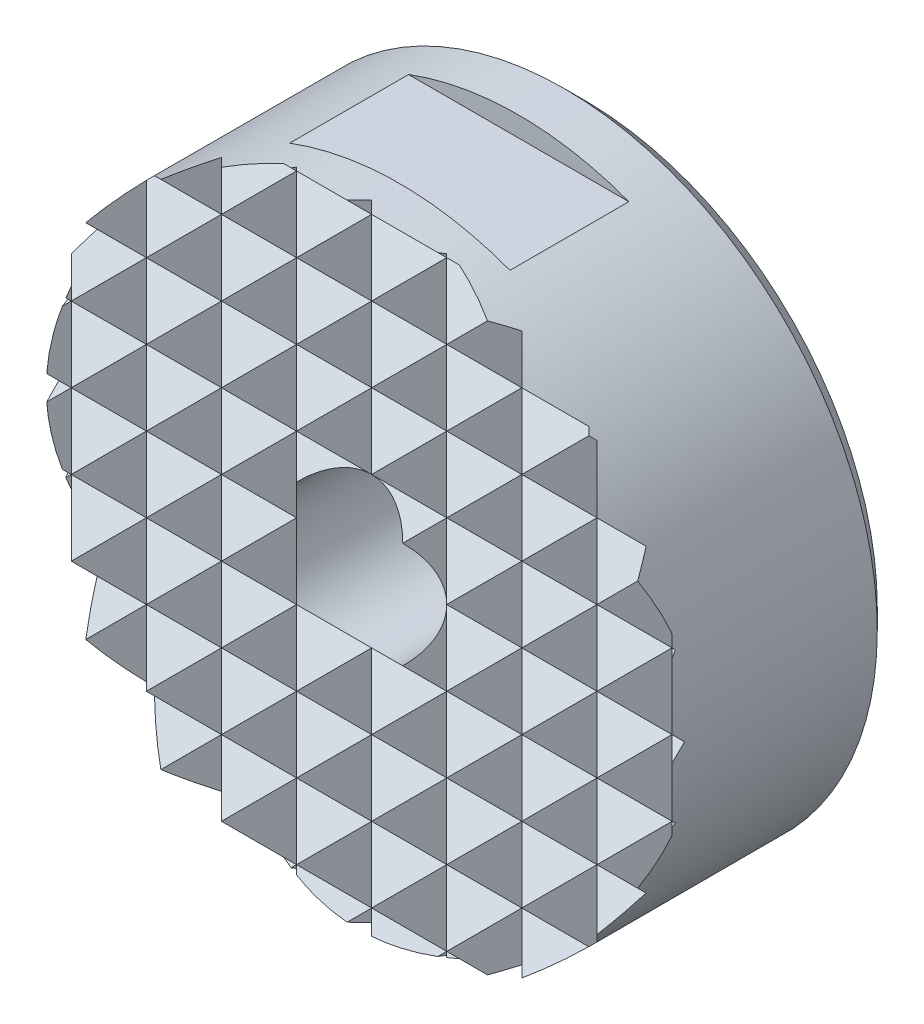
ISO-10303-21;
HEADER;
FILE_DESCRIPTION(('STEP AP214'),'2;1');
FILE_NAME('part.step','',(''),(''),'','','');
FILE_SCHEMA(('AUTOMOTIVE_DESIGN { 1 0 10303 214 1 1 1 1 }'));
ENDSEC;
DATA;
#1=APPLICATION_CONTEXT('core data for automotive mechanical design processes');
#2=APPLICATION_PROTOCOL_DEFINITION('international standard','automotive_design',2000,#1);
#3=PRODUCT_CONTEXT('',#1,'mechanical');
#4=PRODUCT('Part','Part','',(#3));
#5=PRODUCT_RELATED_PRODUCT_CATEGORY('part','',(#4));
#6=PRODUCT_DEFINITION_FORMATION('','',#4);
#7=PRODUCT_DEFINITION_CONTEXT('part definition',#1,'design');
#8=PRODUCT_DEFINITION('design','',#6,#7);
#9=PRODUCT_DEFINITION_SHAPE('','',#8);
#10=(LENGTH_UNIT() NAMED_UNIT(*) SI_UNIT(.MILLI.,.METRE.));
#11=(NAMED_UNIT(*) PLANE_ANGLE_UNIT() SI_UNIT($,.RADIAN.));
#12=(NAMED_UNIT(*) SI_UNIT($,.STERADIAN.) SOLID_ANGLE_UNIT());
#13=UNCERTAINTY_MEASURE_WITH_UNIT(LENGTH_MEASURE(1.E-05),#10,'distance_accuracy_value','');
#14=(GEOMETRIC_REPRESENTATION_CONTEXT(3) GLOBAL_UNCERTAINTY_ASSIGNED_CONTEXT((#13)) GLOBAL_UNIT_ASSIGNED_CONTEXT((#10,
#11,#12)) REPRESENTATION_CONTEXT('',''));
#15=CARTESIAN_POINT('',(0.,0.,0.));
#16=DIRECTION('',(0.,0.,1.));
#17=DIRECTION('',(1.,0.,0.));
#18=AXIS2_PLACEMENT_3D('',#15,#16,#17);
#19=CARTESIAN_POINT('',(4.5,-15.,10.));
#20=DIRECTION('',(-0.70710678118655,0.,-0.707106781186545));
#21=DIRECTION('',(-0.707106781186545,0.,0.70710678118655));
#22=AXIS2_PLACEMENT_3D('',#19,#20,#21);
#23=PLANE('',#22);
#24=CARTESIAN_POINT('',(0.,0.,14.5));
#25=DIRECTION('',(-0.70710678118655,0.,-0.707106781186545));
#26=DIRECTION('',(0.707106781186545,0.,-0.70710678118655));
#27=AXIS2_PLACEMENT_3D('',#24,#25,#26);
#28=ELLIPSE('',#27,17.6776695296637,12.5);
#29=CARTESIAN_POINT('',(5.314144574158,11.3141445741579,9.18585542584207));
#30=VERTEX_POINT('',#29);
#31=CARTESIAN_POINT('',(6.,10.9658560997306,8.5));
#32=VERTEX_POINT('',#31);
#33=EDGE_CURVE('E793',#30,#32,#28,.T.);
#34=ORIENTED_EDGE('',*,*,#33,.F.);
#35=DIRECTION('',(-0.577350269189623,-0.577350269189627,0.577350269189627));
#36=VECTOR('',#35,1.);
#37=CARTESIAN_POINT('',(-3.99999999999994,1.99999999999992,18.5));
#38=LINE('',#37,#36);
#39=CARTESIAN_POINT('',(4.5,10.5,10.));
#40=VERTEX_POINT('',#39);
#41=EDGE_CURVE('E653',#30,#40,#38,.T.);
#42=ORIENTED_EDGE('',*,*,#41,.T.);
#43=DIRECTION('',(0.577350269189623,-0.577350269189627,-0.577350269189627));
#44=VECTOR('',#43,1.);
#45=CARTESIAN_POINT('',(13.,2.,1.5));
#46=LINE('',#45,#44);
#47=CARTESIAN_POINT('',(6.,9.,8.5));
#48=VERTEX_POINT('',#47);
#49=EDGE_CURVE('E1493',#40,#48,#46,.T.);
#50=ORIENTED_EDGE('',*,*,#49,.T.);
#51=DIRECTION('',(0.,1.,0.));
#52=VECTOR('',#51,1.);
#53=CARTESIAN_POINT('',(6.,-15.,8.5));
#54=LINE('',#53,#52);
#55=EDGE_CURVE('E688',#48,#32,#54,.T.);
#56=ORIENTED_EDGE('',*,*,#55,.T.);
#57=EDGE_LOOP('',(#34,#42,#50,#56));
#58=FACE_BOUND('',#57,.T.);
#59=ADVANCED_FACE('F15',(#58),#23,.F.);
#60=CARTESIAN_POINT('',(6.,-15.,8.5));
#61=DIRECTION('',(0.707106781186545,0.,-0.70710678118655));
#62=DIRECTION('',(-0.70710678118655,0.,-0.707106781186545));
#63=AXIS2_PLACEMENT_3D('',#60,#61,#62);
#64=PLANE('',#63);
#65=ORIENTED_EDGE('',*,*,#55,.F.);
#66=DIRECTION('',(0.577350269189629,0.577350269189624,0.577350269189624));
#67=VECTOR('',#66,1.);
#68=CARTESIAN_POINT('',(-2.00000000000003,1.00000000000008,0.500000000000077));
#69=LINE('',#68,#67);
#70=CARTESIAN_POINT('',(7.21062569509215,10.2106256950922,9.71062569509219));
#71=VERTEX_POINT('',#70);
#72=EDGE_CURVE('E1495',#48,#71,#69,.T.);
#73=ORIENTED_EDGE('',*,*,#72,.T.);
#74=CARTESIAN_POINT('',(0.,0.,2.50000000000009));
#75=DIRECTION('',(0.707106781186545,0.,-0.70710678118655));
#76=DIRECTION('',(-0.70710678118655,0.,-0.707106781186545));
#77=AXIS2_PLACEMENT_3D('',#74,#75,#76);
#78=ELLIPSE('',#77,17.6776695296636,12.5);
#79=EDGE_CURVE('E795',#32,#71,#78,.T.);
#80=ORIENTED_EDGE('',*,*,#79,.F.);
#81=EDGE_LOOP('',(#65,#73,#80));
#82=FACE_BOUND('',#81,.T.);
#83=ADVANCED_FACE('F1514',(#82),#64,.F.);
#84=CARTESIAN_POINT('',(7.5,-15.,10.));
#85=DIRECTION('',(-0.70710678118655,0.,-0.707106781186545));
#86=DIRECTION('',(-0.707106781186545,0.,0.70710678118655));
#87=AXIS2_PLACEMENT_3D('',#84,#85,#86);
#88=PLANE('',#87);
#89=CARTESIAN_POINT('',(0.,0.,17.5));
#90=DIRECTION('',(-0.70710678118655,0.,-0.707106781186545));
#91=DIRECTION('',(0.707106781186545,0.,-0.70710678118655));
#92=AXIS2_PLACEMENT_3D('',#89,#90,#91);
#93=ELLIPSE('',#92,17.6776695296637,12.5);
#94=CARTESIAN_POINT('',(8.83883476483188,8.83883476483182,8.66116523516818));
#95=VERTEX_POINT('',#94);
#96=CARTESIAN_POINT('',(9.,8.67467578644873,8.5));
#97=VERTEX_POINT('',#96);
#98=EDGE_CURVE('E798',#95,#97,#93,.T.);
#99=ORIENTED_EDGE('',*,*,#98,.F.);
#100=DIRECTION('',(-0.577350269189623,-0.577350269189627,0.577350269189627));
#101=VECTOR('',#100,1.);
#102=CARTESIAN_POINT('',(0.,0.,17.5));
#103=LINE('',#102,#101);
#104=CARTESIAN_POINT('',(7.5,7.5,10.));
#105=VERTEX_POINT('',#104);
#106=EDGE_CURVE('E1466',#95,#105,#103,.T.);
#107=ORIENTED_EDGE('',*,*,#106,.T.);
#108=DIRECTION('',(0.577350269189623,-0.577350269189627,-0.577350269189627));
#109=VECTOR('',#108,1.);
#110=CARTESIAN_POINT('',(15.,0.,2.5));
#111=LINE('',#110,#109);
#112=CARTESIAN_POINT('',(9.,6.,8.5));
#113=VERTEX_POINT('',#112);
#114=EDGE_CURVE('E1427',#105,#113,#111,.T.);
#115=ORIENTED_EDGE('',*,*,#114,.T.);
#116=DIRECTION('',(0.,1.,0.));
#117=VECTOR('',#116,1.);
#118=CARTESIAN_POINT('',(9.,-15.,8.5));
#119=LINE('',#118,#117);
#120=EDGE_CURVE('E693',#113,#97,#119,.T.);
#121=ORIENTED_EDGE('',*,*,#120,.T.);
#122=EDGE_LOOP('',(#99,#107,#115,#121));
#123=FACE_BOUND('',#122,.T.);
#124=ADVANCED_FACE('F2066',(#123),#88,.F.);
#125=CARTESIAN_POINT('',(9.,-15.,8.5));
#126=DIRECTION('',(0.707106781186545,0.,-0.70710678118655));
#127=DIRECTION('',(-0.70710678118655,0.,-0.707106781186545));
#128=AXIS2_PLACEMENT_3D('',#125,#126,#127);
#129=PLANE('',#128);
#130=ORIENTED_EDGE('',*,*,#120,.F.);
#131=DIRECTION('',(0.577350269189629,0.577350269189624,0.577350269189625));
#132=VECTOR('',#131,1.);
#133=CARTESIAN_POINT('',(1.99999999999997,-0.999999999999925,1.50000000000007));
#134=LINE('',#133,#132);
#135=CARTESIAN_POINT('',(10.2106256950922,7.2106256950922,9.71062569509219));
#136=VERTEX_POINT('',#135);
#137=EDGE_CURVE('E1430',#113,#136,#134,.T.);
#138=ORIENTED_EDGE('',*,*,#137,.T.);
#139=CARTESIAN_POINT('',(0.,0.,-0.499999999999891));
#140=DIRECTION('',(0.707106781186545,0.,-0.70710678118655));
#141=DIRECTION('',(-0.70710678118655,0.,-0.707106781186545));
#142=AXIS2_PLACEMENT_3D('',#139,#140,#141);
#143=ELLIPSE('',#142,17.6776695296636,12.5);
#144=EDGE_CURVE('E801',#97,#136,#143,.T.);
#145=ORIENTED_EDGE('',*,*,#144,.F.);
#146=EDGE_LOOP('',(#130,#138,#145));
#147=FACE_BOUND('',#146,.T.);
#148=ADVANCED_FACE('F2704',(#147),#129,.F.);
#149=CARTESIAN_POINT('',(10.5,-15.,10.));
#150=DIRECTION('',(-0.70710678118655,0.,-0.707106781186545));
#151=DIRECTION('',(-0.707106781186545,0.,0.70710678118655));
#152=AXIS2_PLACEMENT_3D('',#149,#150,#151);
#153=PLANE('',#152);
#154=CARTESIAN_POINT('',(0.,0.,20.5));
#155=DIRECTION('',(-0.70710678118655,0.,-0.707106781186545));
#156=DIRECTION('',(0.707106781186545,0.,-0.70710678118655));
#157=AXIS2_PLACEMENT_3D('',#154,#155,#156);
#158=ELLIPSE('',#157,17.6776695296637,12.5);
#159=CARTESIAN_POINT('',(11.3141445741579,5.31414457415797,9.18585542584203));
#160=VERTEX_POINT('',#159);
#161=CARTESIAN_POINT('',(12.,3.50000000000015,8.5));
#162=VERTEX_POINT('',#161);
#163=EDGE_CURVE('E805',#160,#162,#158,.T.);
#164=ORIENTED_EDGE('',*,*,#163,.F.);
#165=DIRECTION('',(-0.577350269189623,-0.577350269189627,0.577350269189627));
#166=VECTOR('',#165,1.);
#167=CARTESIAN_POINT('',(4.,-2.00000000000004,16.5));
#168=LINE('',#167,#166);
#169=CARTESIAN_POINT('',(10.5,4.5,10.));
#170=VERTEX_POINT('',#169);
#171=EDGE_CURVE('E1388',#160,#170,#168,.T.);
#172=ORIENTED_EDGE('',*,*,#171,.T.);
#173=DIRECTION('',(0.577350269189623,-0.577350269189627,-0.577350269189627));
#174=VECTOR('',#173,1.);
#175=CARTESIAN_POINT('',(17.,-2.,3.5));
#176=LINE('',#175,#174);
#177=CARTESIAN_POINT('',(12.,3.,8.5));
#178=VERTEX_POINT('',#177);
#179=EDGE_CURVE('E1340',#170,#178,#176,.T.);
#180=ORIENTED_EDGE('',*,*,#179,.T.);
#181=DIRECTION('',(0.,1.,0.));
#182=VECTOR('',#181,1.);
#183=CARTESIAN_POINT('',(12.,-15.,8.5));
#184=LINE('',#183,#182);
#185=EDGE_CURVE('E698',#178,#162,#184,.T.);
#186=ORIENTED_EDGE('',*,*,#185,.T.);
#187=EDGE_LOOP('',(#164,#172,#180,#186));
#188=FACE_BOUND('',#187,.T.);
#189=ADVANCED_FACE('F1964',(#188),#153,.F.);
#190=CARTESIAN_POINT('',(12.,0.,8.5));
#191=VERTEX_POINT('',#190);
#192=EDGE_CURVE('E1942',#191,#178,#184,.T.);
#193=ORIENTED_EDGE('',*,*,#192,.T.);
#194=DIRECTION('',(-0.577350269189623,-0.577350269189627,0.577350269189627));
#195=VECTOR('',#194,1.);
#196=CARTESIAN_POINT('',(5.,-4.,15.5));
#197=LINE('',#196,#195);
#198=CARTESIAN_POINT('',(10.5,1.5,10.));
#199=VERTEX_POINT('',#198);
#200=EDGE_CURVE('E1287',#178,#199,#197,.T.);
#201=ORIENTED_EDGE('',*,*,#200,.T.);
#202=DIRECTION('',(0.577350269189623,-0.577350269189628,-0.577350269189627));
#203=VECTOR('',#202,1.);
#204=CARTESIAN_POINT('',(16.,-4.,4.5));
#205=LINE('',#204,#203);
#206=EDGE_CURVE('E1237',#199,#191,#205,.T.);
#207=ORIENTED_EDGE('',*,*,#206,.T.);
#208=EDGE_LOOP('',(#193,#201,#207));
#209=FACE_BOUND('',#208,.T.);
#210=ADVANCED_FACE('F1952',(#209),#153,.F.);
#211=CARTESIAN_POINT('',(12.,-3.,8.5));
#212=VERTEX_POINT('',#211);
#213=EDGE_CURVE('E697',#212,#191,#184,.T.);
#214=ORIENTED_EDGE('',*,*,#213,.T.);
#215=DIRECTION('',(-0.577350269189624,-0.577350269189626,0.577350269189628));
#216=VECTOR('',#215,1.);
#217=CARTESIAN_POINT('',(6.,-6.,14.5));
#218=LINE('',#217,#216);
#219=CARTESIAN_POINT('',(10.5,-1.5,10.));
#220=VERTEX_POINT('',#219);
#221=EDGE_CURVE('E1196',#191,#220,#218,.T.);
#222=ORIENTED_EDGE('',*,*,#221,.T.);
#223=DIRECTION('',(0.577350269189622,-0.57735026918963,-0.577350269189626));
#224=VECTOR('',#223,1.);
#225=CARTESIAN_POINT('',(15.,-6.,5.5));
#226=LINE('',#225,#224);
#227=EDGE_CURVE('E1155',#220,#212,#226,.T.);
#228=ORIENTED_EDGE('',*,*,#227,.T.);
#229=EDGE_LOOP('',(#214,#222,#228));
#230=FACE_BOUND('',#229,.T.);
#231=ADVANCED_FACE('F1939',(#230),#153,.F.);
#232=CARTESIAN_POINT('',(12.,-15.,8.5));
#233=DIRECTION('',(0.707106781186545,0.,-0.70710678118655));
#234=DIRECTION('',(-0.70710678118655,0.,-0.707106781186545));
#235=AXIS2_PLACEMENT_3D('',#232,#233,#234);
#236=PLANE('',#235);
#237=ORIENTED_EDGE('',*,*,#185,.F.);
#238=DIRECTION('',(0.577350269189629,0.577350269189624,0.577350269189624));
#239=VECTOR('',#238,1.);
#240=CARTESIAN_POINT('',(6.,-2.99999999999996,2.50000000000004));
#241=LINE('',#240,#239);
#242=CARTESIAN_POINT('',(12.1075620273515,3.10756202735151,8.60756202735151));
#243=VERTEX_POINT('',#242);
#244=EDGE_CURVE('E1343',#178,#243,#241,.T.);
#245=ORIENTED_EDGE('',*,*,#244,.T.);
#246=CARTESIAN_POINT('',(0.,0.,-3.49999999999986));
#247=DIRECTION('',(0.707106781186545,0.,-0.70710678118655));
#248=DIRECTION('',(-0.70710678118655,0.,-0.707106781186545));
#249=AXIS2_PLACEMENT_3D('',#246,#247,#248);
#250=ELLIPSE('',#249,17.6776695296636,12.5);
#251=EDGE_CURVE('E810',#162,#243,#250,.T.);
#252=ORIENTED_EDGE('',*,*,#251,.F.);
#253=EDGE_LOOP('',(#237,#245,#252));
#254=FACE_BOUND('',#253,.T.);
#255=ADVANCED_FACE('F1967',(#254),#236,.F.);
#256=CARTESIAN_POINT('',(12.1770717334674,2.82292826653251,8.67707173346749));
#257=VERTEX_POINT('',#256);
#258=CARTESIAN_POINT('',(12.4903774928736,0.490377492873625,8.99037749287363));
#259=VERTEX_POINT('',#258);
#260=EDGE_CURVE('E813',#257,#259,#250,.T.);
#261=ORIENTED_EDGE('',*,*,#260,.F.);
#262=DIRECTION('',(-0.577350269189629,0.577350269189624,-0.577350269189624));
#263=VECTOR('',#262,1.);
#264=CARTESIAN_POINT('',(18.,-3.,14.5));
#265=LINE('',#264,#263);
#266=EDGE_CURVE('E1289',#257,#178,#265,.T.);
#267=ORIENTED_EDGE('',*,*,#266,.T.);
#268=ORIENTED_EDGE('',*,*,#192,.F.);
#269=DIRECTION('',(0.577350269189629,0.577350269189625,0.577350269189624));
#270=VECTOR('',#269,1.);
#271=CARTESIAN_POINT('',(7.,-5.,3.5));
#272=LINE('',#271,#270);
#273=EDGE_CURVE('E1240',#191,#259,#272,.T.);
#274=ORIENTED_EDGE('',*,*,#273,.T.);
#275=EDGE_LOOP('',(#261,#267,#268,#274));
#276=FACE_BOUND('',#275,.T.);
#277=ADVANCED_FACE('F1956',(#276),#236,.F.);
#278=CARTESIAN_POINT('',(12.4903774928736,-0.49037749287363,8.99037749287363));
#279=VERTEX_POINT('',#278);
#280=CARTESIAN_POINT('',(12.1770717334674,-2.82292826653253,8.67707173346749));
#281=VERTEX_POINT('',#280);
#282=EDGE_CURVE('E1946',#279,#281,#250,.T.);
#283=ORIENTED_EDGE('',*,*,#282,.F.);
#284=DIRECTION('',(-0.577350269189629,0.577350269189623,-0.577350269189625));
#285=VECTOR('',#284,1.);
#286=CARTESIAN_POINT('',(17.,-5.,13.5));
#287=LINE('',#286,#285);
#288=EDGE_CURVE('E1198',#279,#191,#287,.T.);
#289=ORIENTED_EDGE('',*,*,#288,.T.);
#290=ORIENTED_EDGE('',*,*,#213,.F.);
#291=DIRECTION('',(0.577350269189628,0.577350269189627,0.577350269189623));
#292=VECTOR('',#291,1.);
#293=CARTESIAN_POINT('',(8.,-7.,4.5));
#294=LINE('',#293,#292);
#295=EDGE_CURVE('E1158',#212,#281,#294,.T.);
#296=ORIENTED_EDGE('',*,*,#295,.T.);
#297=EDGE_LOOP('',(#283,#289,#290,#296));
#298=FACE_BOUND('',#297,.T.);
#299=ADVANCED_FACE('F1944',(#298),#236,.F.);
#300=CARTESIAN_POINT('',(-13.5,-15.,10.));
#301=DIRECTION('',(-0.70710678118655,0.,-0.707106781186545));
#302=DIRECTION('',(-0.707106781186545,0.,0.70710678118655));
#303=AXIS2_PLACEMENT_3D('',#300,#301,#302);
#304=PLANE('',#303);
#305=CARTESIAN_POINT('',(0.,0.,-3.5));
#306=DIRECTION('',(-0.70710678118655,0.,-0.707106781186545));
#307=DIRECTION('',(0.707106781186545,0.,-0.70710678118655));
#308=AXIS2_PLACEMENT_3D('',#305,#306,#307);
#309=ELLIPSE('',#308,17.6776695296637,12.5);
#310=CARTESIAN_POINT('',(-12.1075620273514,3.10756202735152,8.60756202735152));
#311=VERTEX_POINT('',#310);
#312=CARTESIAN_POINT('',(-12.,3.5000000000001,8.5));
#313=VERTEX_POINT('',#312);
#314=EDGE_CURVE('E787',#311,#313,#309,.T.);
#315=ORIENTED_EDGE('',*,*,#314,.F.);
#316=DIRECTION('',(0.577350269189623,-0.577350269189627,-0.577350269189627));
#317=VECTOR('',#316,1.);
#318=CARTESIAN_POINT('',(-7.,-2.,3.5));
#319=LINE('',#318,#317);
#320=CARTESIAN_POINT('',(-12.,3.,8.5));
#321=VERTEX_POINT('',#320);
#322=EDGE_CURVE('E1310',#311,#321,#319,.T.);
#323=ORIENTED_EDGE('',*,*,#322,.T.);
#324=DIRECTION('',(0.,1.,0.));
#325=VECTOR('',#324,1.);
#326=CARTESIAN_POINT('',(-12.,-15.,8.5));
#327=LINE('',#326,#325);
#328=EDGE_CURVE('E703',#321,#313,#327,.T.);
#329=ORIENTED_EDGE('',*,*,#328,.T.);
#330=EDGE_LOOP('',(#315,#323,#329));
#331=FACE_BOUND('',#330,.T.);
#332=ADVANCED_FACE('F1902',(#331),#304,.F.);
#333=CARTESIAN_POINT('',(-12.,0.,8.5));
#334=VERTEX_POINT('',#333);
#335=EDGE_CURVE('E1727',#334,#321,#327,.T.);
#336=ORIENTED_EDGE('',*,*,#335,.T.);
#337=DIRECTION('',(-0.577350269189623,-0.577350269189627,0.577350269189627));
#338=VECTOR('',#337,1.);
#339=CARTESIAN_POINT('',(-19.,-4.00000000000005,15.5));
#340=LINE('',#339,#338);
#341=CARTESIAN_POINT('',(-12.1770717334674,2.82292826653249,8.67707173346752));
#342=VERTEX_POINT('',#341);
#343=EDGE_CURVE('E1260',#321,#342,#340,.T.);
#344=ORIENTED_EDGE('',*,*,#343,.T.);
#345=CARTESIAN_POINT('',(-12.4903774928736,0.490377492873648,8.99037749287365));
#346=VERTEX_POINT('',#345);
#347=EDGE_CURVE('E1899',#346,#342,#309,.T.);
#348=ORIENTED_EDGE('',*,*,#347,.F.);
#349=DIRECTION('',(0.577350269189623,-0.577350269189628,-0.577350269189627));
#350=VECTOR('',#349,1.);
#351=CARTESIAN_POINT('',(-8.,-4.,4.5));
#352=LINE('',#351,#350);
#353=EDGE_CURVE('E1216',#346,#334,#352,.T.);
#354=ORIENTED_EDGE('',*,*,#353,.T.);
#355=EDGE_LOOP('',(#336,#344,#348,#354));
#356=FACE_BOUND('',#355,.T.);
#357=ADVANCED_FACE('F1898',(#356),#304,.F.);
#358=CARTESIAN_POINT('',(-12.,-3.,8.5));
#359=VERTEX_POINT('',#358);
#360=EDGE_CURVE('E702',#359,#334,#327,.T.);
#361=ORIENTED_EDGE('',*,*,#360,.T.);
#362=DIRECTION('',(-0.577350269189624,-0.577350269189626,0.577350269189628));
#363=VECTOR('',#362,1.);
#364=CARTESIAN_POINT('',(-18.,-6.,14.5));
#365=LINE('',#364,#363);
#366=CARTESIAN_POINT('',(-12.4903774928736,-0.490377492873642,8.99037749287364));
#367=VERTEX_POINT('',#366);
#368=EDGE_CURVE('E1175',#334,#367,#365,.T.);
#369=ORIENTED_EDGE('',*,*,#368,.T.);
#370=CARTESIAN_POINT('',(-12.1770717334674,-2.8229282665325,8.67707173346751));
#371=VERTEX_POINT('',#370);
#372=EDGE_CURVE('E792',#371,#367,#309,.T.);
#373=ORIENTED_EDGE('',*,*,#372,.F.);
#374=DIRECTION('',(0.577350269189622,-0.57735026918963,-0.577350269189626));
#375=VECTOR('',#374,1.);
#376=CARTESIAN_POINT('',(-9.,-6.,5.5));
#377=LINE('',#376,#375);
#378=EDGE_CURVE('E1127',#371,#359,#377,.T.);
#379=ORIENTED_EDGE('',*,*,#378,.T.);
#380=EDGE_LOOP('',(#361,#369,#373,#379));
#381=FACE_BOUND('',#380,.T.);
#382=ADVANCED_FACE('F1729',(#381),#304,.F.);
#383=CARTESIAN_POINT('',(-12.,-15.,8.5));
#384=DIRECTION('',(0.707106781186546,0.,-0.70710678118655));
#385=DIRECTION('',(-0.70710678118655,0.,-0.707106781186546));
#386=AXIS2_PLACEMENT_3D('',#383,#384,#385);
#387=PLANE('',#386);
#388=DIRECTION('',(0.577350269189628,0.577350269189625,0.577350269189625));
#389=VECTOR('',#388,1.);
#390=CARTESIAN_POINT('',(-18.,-2.99999999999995,2.50000000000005));
#391=LINE('',#390,#389);
#392=CARTESIAN_POINT('',(-10.5,4.5,10.));
#393=VERTEX_POINT('',#392);
#394=EDGE_CURVE('E1307',#321,#393,#391,.T.);
#395=ORIENTED_EDGE('',*,*,#394,.T.);
#396=DIRECTION('',(-0.577350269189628,0.577350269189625,-0.577350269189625));
#397=VECTOR('',#396,1.);
#398=CARTESIAN_POINT('',(-5.,-1.,15.5));
#399=LINE('',#398,#397);
#400=CARTESIAN_POINT('',(-11.3141445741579,5.31414457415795,9.18585542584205));
#401=VERTEX_POINT('',#400);
#402=EDGE_CURVE('E1360',#393,#401,#399,.T.);
#403=ORIENTED_EDGE('',*,*,#402,.T.);
#404=CARTESIAN_POINT('',(0.,0.,20.5));
#405=DIRECTION('',(0.707106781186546,0.,-0.70710678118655));
#406=DIRECTION('',(-0.70710678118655,0.,-0.707106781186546));
#407=AXIS2_PLACEMENT_3D('',#404,#405,#406);
#408=ELLIPSE('',#407,17.6776695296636,12.5);
#409=EDGE_CURVE('E783',#313,#401,#408,.T.);
#410=ORIENTED_EDGE('',*,*,#409,.F.);
#411=ORIENTED_EDGE('',*,*,#328,.F.);
#412=EDGE_LOOP('',(#395,#403,#410,#411));
#413=FACE_BOUND('',#412,.T.);
#414=ADVANCED_FACE('F1655',(#413),#387,.F.);
#415=DIRECTION('',(0.577350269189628,0.577350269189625,0.577350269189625));
#416=VECTOR('',#415,1.);
#417=CARTESIAN_POINT('',(-17.,-5.,3.5));
#418=LINE('',#417,#416);
#419=CARTESIAN_POINT('',(-10.5,1.5,10.));
#420=VERTEX_POINT('',#419);
#421=EDGE_CURVE('E1213',#334,#420,#418,.T.);
#422=ORIENTED_EDGE('',*,*,#421,.T.);
#423=DIRECTION('',(-0.577350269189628,0.577350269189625,-0.577350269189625));
#424=VECTOR('',#423,1.);
#425=CARTESIAN_POINT('',(-6.,-3.,14.5));
#426=LINE('',#425,#424);
#427=EDGE_CURVE('E1257',#420,#321,#426,.T.);
#428=ORIENTED_EDGE('',*,*,#427,.T.);
#429=ORIENTED_EDGE('',*,*,#335,.F.);
#430=EDGE_LOOP('',(#422,#428,#429));
#431=FACE_BOUND('',#430,.T.);
#432=ADVANCED_FACE('F1904',(#431),#387,.F.);
#433=DIRECTION('',(0.577350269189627,0.577350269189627,0.577350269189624));
#434=VECTOR('',#433,1.);
#435=CARTESIAN_POINT('',(-16.,-7.,4.5));
#436=LINE('',#435,#434);
#437=CARTESIAN_POINT('',(-10.5,-1.5,10.));
#438=VERTEX_POINT('',#437);
#439=EDGE_CURVE('E1124',#359,#438,#436,.T.);
#440=ORIENTED_EDGE('',*,*,#439,.T.);
#441=DIRECTION('',(-0.577350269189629,0.577350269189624,-0.577350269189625));
#442=VECTOR('',#441,1.);
#443=CARTESIAN_POINT('',(-7.,-5.,13.5));
#444=LINE('',#443,#442);
#445=EDGE_CURVE('E1172',#438,#334,#444,.T.);
#446=ORIENTED_EDGE('',*,*,#445,.T.);
#447=ORIENTED_EDGE('',*,*,#360,.F.);
#448=EDGE_LOOP('',(#440,#446,#447));
#449=FACE_BOUND('',#448,.T.);
#450=ADVANCED_FACE('F1725',(#449),#387,.F.);
#451=CARTESIAN_POINT('',(-10.5,-15.,10.));
#452=DIRECTION('',(-0.70710678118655,0.,-0.707106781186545));
#453=DIRECTION('',(-0.707106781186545,0.,0.70710678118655));
#454=AXIS2_PLACEMENT_3D('',#451,#452,#453);
#455=PLANE('',#454);
#456=CARTESIAN_POINT('',(0.,0.,-0.500000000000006));
#457=DIRECTION('',(-0.70710678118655,0.,-0.707106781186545));
#458=DIRECTION('',(0.707106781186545,0.,-0.70710678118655));
#459=AXIS2_PLACEMENT_3D('',#456,#457,#458);
#460=ELLIPSE('',#459,17.6776695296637,12.5);
#461=CARTESIAN_POINT('',(-10.2106256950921,7.21062569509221,9.71062569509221));
#462=VERTEX_POINT('',#461);
#463=CARTESIAN_POINT('',(-9.,8.67467578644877,8.5));
#464=VERTEX_POINT('',#463);
#465=EDGE_CURVE('E780',#462,#464,#460,.T.);
#466=ORIENTED_EDGE('',*,*,#465,.F.);
#467=DIRECTION('',(0.577350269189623,-0.577350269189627,-0.577350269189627));
#468=VECTOR('',#467,1.);
#469=CARTESIAN_POINT('',(-3.,0.,2.5));
#470=LINE('',#469,#468);
#471=CARTESIAN_POINT('',(-9.,6.,8.5));
#472=VERTEX_POINT('',#471);
#473=EDGE_CURVE('E1402',#462,#472,#470,.T.);
#474=ORIENTED_EDGE('',*,*,#473,.T.);
#475=DIRECTION('',(0.,1.,0.));
#476=VECTOR('',#475,1.);
#477=CARTESIAN_POINT('',(-9.,-15.,8.5));
#478=LINE('',#477,#476);
#479=EDGE_CURVE('E708',#472,#464,#478,.T.);
#480=ORIENTED_EDGE('',*,*,#479,.T.);
#481=EDGE_LOOP('',(#466,#474,#480));
#482=FACE_BOUND('',#481,.T.);
#483=ADVANCED_FACE('F1645',(#482),#455,.F.);
#484=CARTESIAN_POINT('',(-9.,-15.,8.5));
#485=DIRECTION('',(0.707106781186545,0.,-0.70710678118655));
#486=DIRECTION('',(-0.70710678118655,0.,-0.707106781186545));
#487=AXIS2_PLACEMENT_3D('',#484,#485,#486);
#488=PLANE('',#487);
#489=DIRECTION('',(0.577350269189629,0.577350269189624,0.577350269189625));
#490=VECTOR('',#489,1.);
#491=CARTESIAN_POINT('',(-16.,-0.999999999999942,1.50000000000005));
#492=LINE('',#491,#490);
#493=CARTESIAN_POINT('',(-7.5,7.5,10.));
#494=VERTEX_POINT('',#493);
#495=EDGE_CURVE('E1399',#472,#494,#492,.T.);
#496=ORIENTED_EDGE('',*,*,#495,.T.);
#497=DIRECTION('',(-0.577350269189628,0.577350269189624,-0.577350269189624));
#498=VECTOR('',#497,1.);
#499=CARTESIAN_POINT('',(-0.999999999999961,1.00000000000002,16.5));
#500=LINE('',#499,#498);
#501=CARTESIAN_POINT('',(-8.83883476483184,8.83883476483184,8.66116523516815));
#502=VERTEX_POINT('',#501);
#503=EDGE_CURVE('E1442',#494,#502,#500,.T.);
#504=ORIENTED_EDGE('',*,*,#503,.T.);
#505=CARTESIAN_POINT('',(0.,0.,17.5));
#506=DIRECTION('',(0.707106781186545,0.,-0.70710678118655));
#507=DIRECTION('',(-0.70710678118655,0.,-0.707106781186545));
#508=AXIS2_PLACEMENT_3D('',#505,#506,#507);
#509=ELLIPSE('',#508,17.6776695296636,12.5);
#510=EDGE_CURVE('E776',#464,#502,#509,.T.);
#511=ORIENTED_EDGE('',*,*,#510,.F.);
#512=ORIENTED_EDGE('',*,*,#479,.F.);
#513=EDGE_LOOP('',(#496,#504,#511,#512));
#514=FACE_BOUND('',#513,.T.);
#515=ADVANCED_FACE('F1627',(#514),#488,.F.);
#516=CARTESIAN_POINT('',(-7.5,-15.,10.));
#517=DIRECTION('',(-0.70710678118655,0.,-0.707106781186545));
#518=DIRECTION('',(-0.707106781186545,0.,0.707106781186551));
#519=AXIS2_PLACEMENT_3D('',#516,#517,#518);
#520=PLANE('',#519);
#521=CARTESIAN_POINT('',(0.,0.,2.5));
#522=DIRECTION('',(-0.70710678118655,0.,-0.707106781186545));
#523=DIRECTION('',(0.707106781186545,0.,-0.707106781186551));
#524=AXIS2_PLACEMENT_3D('',#521,#522,#523);
#525=ELLIPSE('',#524,17.6776695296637,12.5);
#526=CARTESIAN_POINT('',(-7.21062569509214,10.2106256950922,9.71062569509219));
#527=VERTEX_POINT('',#526);
#528=CARTESIAN_POINT('',(-6.,10.9658560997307,8.5));
#529=VERTEX_POINT('',#528);
#530=EDGE_CURVE('E773',#527,#529,#525,.T.);
#531=ORIENTED_EDGE('',*,*,#530,.F.);
#532=DIRECTION('',(0.577350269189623,-0.577350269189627,-0.577350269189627));
#533=VECTOR('',#532,1.);
#534=CARTESIAN_POINT('',(1.00000000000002,1.99999999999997,1.49999999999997));
#535=LINE('',#534,#533);
#536=CARTESIAN_POINT('',(-6.,9.,8.5));
#537=VERTEX_POINT('',#536);
#538=EDGE_CURVE('E1474',#527,#537,#535,.T.);
#539=ORIENTED_EDGE('',*,*,#538,.T.);
#540=DIRECTION('',(0.,1.,0.));
#541=VECTOR('',#540,1.);
#542=CARTESIAN_POINT('',(-6.,-15.,8.5));
#543=LINE('',#542,#541);
#544=EDGE_CURVE('E712',#537,#529,#543,.T.);
#545=ORIENTED_EDGE('',*,*,#544,.T.);
#546=EDGE_LOOP('',(#531,#539,#545));
#547=FACE_BOUND('',#546,.T.);
#548=ADVANCED_FACE('F1618',(#547),#520,.F.);
#549=CARTESIAN_POINT('',(-6.,-15.,8.5));
#550=DIRECTION('',(0.707106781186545,0.,-0.70710678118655));
#551=DIRECTION('',(-0.70710678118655,0.,-0.707106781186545));
#552=AXIS2_PLACEMENT_3D('',#549,#550,#551);
#553=PLANE('',#552);
#554=DIRECTION('',(0.577350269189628,0.577350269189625,0.577350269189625));
#555=VECTOR('',#554,1.);
#556=CARTESIAN_POINT('',(-14.,1.00000000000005,0.500000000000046));
#557=LINE('',#556,#555);
#558=CARTESIAN_POINT('',(-4.49999999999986,10.5,10.));
#559=VERTEX_POINT('',#558);
#560=EDGE_CURVE('E1471',#537,#559,#557,.T.);
#561=ORIENTED_EDGE('',*,*,#560,.T.);
#562=DIRECTION('',(-0.577350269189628,0.577350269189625,-0.577350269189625));
#563=VECTOR('',#562,1.);
#564=CARTESIAN_POINT('',(3.00000000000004,3.,17.5));
#565=LINE('',#564,#563);
#566=CARTESIAN_POINT('',(-5.31414457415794,11.3141445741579,9.18585542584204));
#567=VERTEX_POINT('',#566);
#568=EDGE_CURVE('E643',#559,#567,#565,.T.);
#569=ORIENTED_EDGE('',*,*,#568,.T.);
#570=CARTESIAN_POINT('',(0.,0.,14.5));
#571=DIRECTION('',(0.707106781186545,0.,-0.70710678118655));
#572=DIRECTION('',(-0.70710678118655,0.,-0.707106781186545));
#573=AXIS2_PLACEMENT_3D('',#570,#571,#572);
#574=ELLIPSE('',#573,17.6776695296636,12.5);
#575=EDGE_CURVE('E641',#529,#567,#574,.T.);
#576=ORIENTED_EDGE('',*,*,#575,.F.);
#577=ORIENTED_EDGE('',*,*,#544,.F.);
#578=EDGE_LOOP('',(#561,#569,#576,#577));
#579=FACE_BOUND('',#578,.T.);
#580=ADVANCED_FACE('F1601',(#579),#553,.F.);
#581=CARTESIAN_POINT('',(-2.99999999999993,-15.,8.5));
#582=DIRECTION('',(0.707106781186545,0.,-0.70710678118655));
#583=DIRECTION('',(-0.70710678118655,0.,-0.707106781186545));
#584=AXIS2_PLACEMENT_3D('',#581,#582,#583);
#585=PLANE('',#584);
#586=CARTESIAN_POINT('',(0.,0.,11.5));
#587=DIRECTION('',(0.707106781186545,0.,-0.70710678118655));
#588=DIRECTION('',(0.70710678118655,0.,0.707106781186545));
#589=AXIS2_PLACEMENT_3D('',#586,#587,#588);
#590=ELLIPSE('',#589,4.24264068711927,3.);
#591=CARTESIAN_POINT('',(-2.99999999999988,0.,8.5));
#592=VERTEX_POINT('',#591);
#593=CARTESIAN_POINT('',(-2.12132034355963,2.12132034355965,9.37867965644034));
#594=VERTEX_POINT('',#593);
#595=EDGE_CURVE('E768',#592,#594,#590,.T.);
#596=ORIENTED_EDGE('',*,*,#595,.T.);
#597=DIRECTION('',(-0.577350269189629,0.577350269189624,-0.577350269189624));
#598=VECTOR('',#597,1.);
#599=CARTESIAN_POINT('',(3.00000000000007,-3.,14.5));
#600=LINE('',#599,#598);
#601=CARTESIAN_POINT('',(-2.99999999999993,2.99999999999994,8.5));
#602=VERTEX_POINT('',#601);
#603=EDGE_CURVE('E1243',#594,#602,#600,.T.);
#604=ORIENTED_EDGE('',*,*,#603,.T.);
#605=DIRECTION('',(0.,1.,0.));
#606=VECTOR('',#605,1.);
#607=CARTESIAN_POINT('',(-2.99999999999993,-15.,8.5));
#608=LINE('',#607,#606);
#609=EDGE_CURVE('E659',#592,#602,#608,.T.);
#610=ORIENTED_EDGE('',*,*,#609,.F.);
#611=EDGE_LOOP('',(#596,#604,#610));
#612=FACE_BOUND('',#611,.T.);
#613=ADVANCED_FACE('F2589',(#612),#585,.F.);
#614=CARTESIAN_POINT('',(-2.99999999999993,-3.00000000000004,8.5));
#615=VERTEX_POINT('',#614);
#616=EDGE_CURVE('E714',#615,#592,#608,.T.);
#617=ORIENTED_EDGE('',*,*,#616,.F.);
#618=DIRECTION('',(0.577350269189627,0.577350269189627,0.577350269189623));
#619=VECTOR('',#618,1.);
#620=CARTESIAN_POINT('',(-7.,-7.,4.5));
#621=LINE('',#620,#619);
#622=CARTESIAN_POINT('',(-2.12132034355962,-2.12132034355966,9.37867965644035));
#623=VERTEX_POINT('',#622);
#624=EDGE_CURVE('E1109',#615,#623,#621,.T.);
#625=ORIENTED_EDGE('',*,*,#624,.T.);
#626=EDGE_CURVE('E771',#623,#592,#590,.T.);
#627=ORIENTED_EDGE('',*,*,#626,.T.);
#628=EDGE_LOOP('',(#617,#625,#627));
#629=FACE_BOUND('',#628,.T.);
#630=ADVANCED_FACE('F2329',(#629),#585,.F.);
#631=CARTESIAN_POINT('',(1.5,-15.,10.));
#632=DIRECTION('',(-0.70710678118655,0.,-0.707106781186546));
#633=DIRECTION('',(-0.707106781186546,0.,0.70710678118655));
#634=AXIS2_PLACEMENT_3D('',#631,#632,#633);
#635=PLANE('',#634);
#636=CARTESIAN_POINT('',(0.,0.,11.5));
#637=DIRECTION('',(-0.70710678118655,0.,-0.707106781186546));
#638=DIRECTION('',(-0.707106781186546,0.,0.70710678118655));
#639=AXIS2_PLACEMENT_3D('',#636,#637,#638);
#640=ELLIPSE('',#639,4.2426406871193,3.);
#641=CARTESIAN_POINT('',(2.99999999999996,0.,8.5));
#642=VERTEX_POINT('',#641);
#643=CARTESIAN_POINT('',(2.12132034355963,-2.12132034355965,9.37867965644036));
#644=VERTEX_POINT('',#643);
#645=EDGE_CURVE('E764',#642,#644,#640,.T.);
#646=ORIENTED_EDGE('',*,*,#645,.T.);
#647=DIRECTION('',(0.577350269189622,-0.577350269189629,-0.577350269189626));
#648=VECTOR('',#647,1.);
#649=CARTESIAN_POINT('',(6.,-6.,5.5));
#650=LINE('',#649,#648);
#651=CARTESIAN_POINT('',(3.,-3.,8.5));
#652=VERTEX_POINT('',#651);
#653=EDGE_CURVE('E1136',#644,#652,#650,.T.);
#654=ORIENTED_EDGE('',*,*,#653,.T.);
#655=DIRECTION('',(0.,1.,0.));
#656=VECTOR('',#655,1.);
#657=CARTESIAN_POINT('',(3.,-15.,8.5));
#658=LINE('',#657,#656);
#659=EDGE_CURVE('E680',#652,#642,#658,.T.);
#660=ORIENTED_EDGE('',*,*,#659,.T.);
#661=EDGE_LOOP('',(#646,#654,#660));
#662=FACE_BOUND('',#661,.T.);
#663=ADVANCED_FACE('F2191',(#662),#635,.F.);
#664=CARTESIAN_POINT('',(2.99999999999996,3.,8.5));
#665=VERTEX_POINT('',#664);
#666=EDGE_CURVE('E677',#642,#665,#658,.T.);
#667=ORIENTED_EDGE('',*,*,#666,.T.);
#668=DIRECTION('',(-0.577350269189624,-0.577350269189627,0.577350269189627));
#669=VECTOR('',#668,1.);
#670=CARTESIAN_POINT('',(-4.,-4.,15.5));
#671=LINE('',#670,#669);
#672=CARTESIAN_POINT('',(2.12132034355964,2.12132034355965,9.37867965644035));
#673=VERTEX_POINT('',#672);
#674=EDGE_CURVE('E1271',#665,#673,#671,.T.);
#675=ORIENTED_EDGE('',*,*,#674,.T.);
#676=EDGE_CURVE('E767',#673,#642,#640,.T.);
#677=ORIENTED_EDGE('',*,*,#676,.T.);
#678=EDGE_LOOP('',(#667,#675,#677));
#679=FACE_BOUND('',#678,.T.);
#680=ADVANCED_FACE('F2201',(#679),#635,.F.);
#681=CARTESIAN_POINT('',(3.,-15.,8.5));
#682=DIRECTION('',(0.707106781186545,0.,-0.70710678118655));
#683=DIRECTION('',(-0.70710678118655,0.,-0.707106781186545));
#684=AXIS2_PLACEMENT_3D('',#681,#682,#683);
#685=PLANE('',#684);
#686=CARTESIAN_POINT('',(0.,0.,5.5));
#687=DIRECTION('',(0.707106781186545,0.,-0.70710678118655));
#688=DIRECTION('',(-0.70710678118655,0.,-0.707106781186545));
#689=AXIS2_PLACEMENT_3D('',#686,#687,#688);
#690=ELLIPSE('',#689,17.6776695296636,12.5);
#691=CARTESIAN_POINT('',(3.10756202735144,-12.1075620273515,8.60756202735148));
#692=VERTEX_POINT('',#691);
#693=CARTESIAN_POINT('',(3.,-12.1346610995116,8.5));
#694=VERTEX_POINT('',#693);
#695=EDGE_CURVE('E720',#692,#694,#690,.T.);
#696=ORIENTED_EDGE('',*,*,#695,.F.);
#697=DIRECTION('',(-0.577350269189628,0.577350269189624,-0.577350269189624));
#698=VECTOR('',#697,1.);
#699=CARTESIAN_POINT('',(4.,-13.,9.5));
#700=LINE('',#699,#698);
#701=CARTESIAN_POINT('',(2.99999999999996,-12.,8.5));
#702=VERTEX_POINT('',#701);
#703=EDGE_CURVE('E1796',#692,#702,#700,.T.);
#704=ORIENTED_EDGE('',*,*,#703,.T.);
#705=EDGE_CURVE('E682',#694,#702,#658,.T.);
#706=ORIENTED_EDGE('',*,*,#705,.F.);
#707=EDGE_LOOP('',(#696,#704,#706));
#708=FACE_BOUND('',#707,.T.);
#709=ADVANCED_FACE('F1798',(#708),#685,.F.);
#710=ORIENTED_EDGE('',*,*,#659,.F.);
#711=DIRECTION('',(0.577350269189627,0.577350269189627,0.577350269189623));
#712=VECTOR('',#711,1.);
#713=CARTESIAN_POINT('',(-1.00000000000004,-7.,4.5));
#714=LINE('',#713,#712);
#715=CARTESIAN_POINT('',(4.5,-1.5,10.));
#716=VERTEX_POINT('',#715);
#717=EDGE_CURVE('E1140',#652,#716,#714,.T.);
#718=ORIENTED_EDGE('',*,*,#717,.T.);
#719=DIRECTION('',(-0.577350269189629,0.577350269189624,-0.577350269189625));
#720=VECTOR('',#719,1.);
#721=CARTESIAN_POINT('',(8.,-5.,13.5));
#722=LINE('',#721,#720);
#723=EDGE_CURVE('E1181',#716,#642,#722,.T.);
#724=ORIENTED_EDGE('',*,*,#723,.T.);
#725=EDGE_LOOP('',(#710,#718,#724));
#726=FACE_BOUND('',#725,.T.);
#727=ADVANCED_FACE('F2558',(#726),#685,.F.);
#728=ORIENTED_EDGE('',*,*,#666,.F.);
#729=DIRECTION('',(0.577350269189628,0.577350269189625,0.577350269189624));
#730=VECTOR('',#729,1.);
#731=CARTESIAN_POINT('',(-2.00000000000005,-5.,3.5));
#732=LINE('',#731,#730);
#733=CARTESIAN_POINT('',(4.5,1.5,10.));
#734=VERTEX_POINT('',#733);
#735=EDGE_CURVE('E1222',#642,#734,#732,.T.);
#736=ORIENTED_EDGE('',*,*,#735,.T.);
#737=DIRECTION('',(-0.577350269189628,0.577350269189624,-0.577350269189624));
#738=VECTOR('',#737,1.);
#739=CARTESIAN_POINT('',(9.,-3.,14.5));
#740=LINE('',#739,#738);
#741=EDGE_CURVE('E1274',#734,#665,#740,.T.);
#742=ORIENTED_EDGE('',*,*,#741,.T.);
#743=EDGE_LOOP('',(#728,#736,#742));
#744=FACE_BOUND('',#743,.T.);
#745=ADVANCED_FACE('F2196',(#744),#685,.F.);
#746=CARTESIAN_POINT('',(-4.49999999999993,-15.,10.));
#747=DIRECTION('',(-0.70710678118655,0.,-0.707106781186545));
#748=DIRECTION('',(-0.707106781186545,0.,0.70710678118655));
#749=AXIS2_PLACEMENT_3D('',#746,#747,#748);
#750=PLANE('',#749);
#751=CARTESIAN_POINT('',(-2.99999999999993,-12.1346610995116,8.5));
#752=VERTEX_POINT('',#751);
#753=CARTESIAN_POINT('',(-2.99999999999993,-12.,8.5));
#754=VERTEX_POINT('',#753);
#755=EDGE_CURVE('E716',#752,#754,#608,.T.);
#756=ORIENTED_EDGE('',*,*,#755,.T.);
#757=DIRECTION('',(-0.577350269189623,-0.577350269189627,0.577350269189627));
#758=VECTOR('',#757,1.);
#759=CARTESIAN_POINT('',(-4.99999999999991,-14.,10.5));
#760=LINE('',#759,#758);
#761=CARTESIAN_POINT('',(-3.10756202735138,-12.1075620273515,8.6075620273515));
#762=VERTEX_POINT('',#761);
#763=EDGE_CURVE('E9',#754,#762,#760,.T.);
#764=ORIENTED_EDGE('',*,*,#763,.T.);
#765=CARTESIAN_POINT('',(0.,0.,5.5000000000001));
#766=DIRECTION('',(-0.70710678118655,0.,-0.707106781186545));
#767=DIRECTION('',(0.707106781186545,0.,-0.70710678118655));
#768=AXIS2_PLACEMENT_3D('',#765,#766,#767);
#769=ELLIPSE('',#768,17.6776695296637,12.5);
#770=EDGE_CURVE('E719',#752,#762,#769,.T.);
#771=ORIENTED_EDGE('',*,*,#770,.F.);
#772=EDGE_LOOP('',(#756,#764,#771));
#773=FACE_BOUND('',#772,.T.);
#774=ADVANCED_FACE('F2311',(#773),#750,.F.);
#775=DIRECTION('',(-0.577350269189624,-0.577350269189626,0.577350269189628));
#776=VECTOR('',#775,1.);
#777=CARTESIAN_POINT('',(-8.99999999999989,-6.,14.5));
#778=LINE('',#777,#776);
#779=CARTESIAN_POINT('',(-4.49999999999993,-1.49999999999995,10.));
#780=VERTEX_POINT('',#779);
#781=EDGE_CURVE('E834',#592,#780,#778,.T.);
#782=ORIENTED_EDGE('',*,*,#781,.T.);
#783=DIRECTION('',(0.577350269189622,-0.57735026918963,-0.577350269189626));
#784=VECTOR('',#783,1.);
#785=CARTESIAN_POINT('',(0.,-6.,5.5));
#786=LINE('',#785,#784);
#787=EDGE_CURVE('E836',#780,#615,#786,.T.);
#788=ORIENTED_EDGE('',*,*,#787,.T.);
#789=ORIENTED_EDGE('',*,*,#616,.T.);
#790=EDGE_LOOP('',(#782,#788,#789));
#791=FACE_BOUND('',#790,.T.);
#792=ADVANCED_FACE('F2322',(#791),#750,.F.);
#793=DIRECTION('',(-0.577350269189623,-0.577350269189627,0.577350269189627));
#794=VECTOR('',#793,1.);
#795=CARTESIAN_POINT('',(-9.99999999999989,-4.00000000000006,15.5));
#796=LINE('',#795,#794);
#797=CARTESIAN_POINT('',(-4.49999999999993,1.50000000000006,10.));
#798=VERTEX_POINT('',#797);
#799=EDGE_CURVE('E829',#602,#798,#796,.T.);
#800=ORIENTED_EDGE('',*,*,#799,.T.);
#801=DIRECTION('',(0.577350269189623,-0.577350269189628,-0.577350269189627));
#802=VECTOR('',#801,1.);
#803=CARTESIAN_POINT('',(1.00000000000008,-4.,4.5));
#804=LINE('',#803,#802);
#805=EDGE_CURVE('E831',#798,#592,#804,.T.);
#806=ORIENTED_EDGE('',*,*,#805,.T.);
#807=ORIENTED_EDGE('',*,*,#609,.T.);
#808=EDGE_LOOP('',(#800,#806,#807));
#809=FACE_BOUND('',#808,.T.);
#810=ADVANCED_FACE('F2534',(#809),#750,.F.);
#811=CARTESIAN_POINT('',(0.,0.,0.));
#812=DIRECTION('',(0.,0.,1.));
#813=DIRECTION('',(1.,0.,0.));
#814=AXIS2_PLACEMENT_3D('',#811,#812,#813);
#815=PLANE('',#814);
#816=CARTESIAN_POINT('',(0.,0.,0.));
#817=DIRECTION('',(0.,0.,1.));
#818=DIRECTION('',(1.,0.,0.));
#819=AXIS2_PLACEMENT_3D('',#816,#817,#818);
#820=CIRCLE('',#819,11.7);
#821=CARTESIAN_POINT('',(11.7,0.,0.));
#822=VERTEX_POINT('',#821);
#823=EDGE_CURVE('E749',#822,#822,#820,.F.);
#824=ORIENTED_EDGE('',*,*,#823,.T.);
#825=EDGE_LOOP('',(#824));
#826=FACE_BOUND('',#825,.T.);
#827=CARTESIAN_POINT('',(0.,0.,0.));
#828=DIRECTION('',(0.,0.,1.));
#829=DIRECTION('',(1.,0.,0.));
#830=AXIS2_PLACEMENT_3D('',#827,#828,#829);
#831=CIRCLE('',#830,3.45);
#832=CARTESIAN_POINT('',(3.45,0.,0.));
#833=VERTEX_POINT('',#832);
#834=EDGE_CURVE('E743',#833,#833,#831,.T.);
#835=ORIENTED_EDGE('',*,*,#834,.T.);
#836=EDGE_LOOP('',(#835));
#837=FACE_BOUND('',#836,.T.);
#838=ADVANCED_FACE('F2525',(#826,#837),#815,.F.);
#839=CARTESIAN_POINT('',(0.,0.,10.));
#840=DIRECTION('',(0.,0.,-1.));
#841=DIRECTION('',(-1.,0.,0.));
#842=AXIS2_PLACEMENT_3D('',#839,#840,#841);
#843=CYLINDRICAL_SURFACE('',#842,12.5);
#844=CARTESIAN_POINT('',(0.,0.,7.375));
#845=DIRECTION('',(0.,0.,1.));
#846=DIRECTION('',(1.,0.,0.));
#847=AXIS2_PLACEMENT_3D('',#844,#845,#846);
#848=CIRCLE('',#847,12.5);
#849=CARTESIAN_POINT('',(4.4,11.7,7.375));
#850=VERTEX_POINT('',#849);
#851=CARTESIAN_POINT('',(-4.4,11.7,7.375));
#852=VERTEX_POINT('',#851);
#853=EDGE_CURVE('E758',#850,#852,#848,.T.);
#854=ORIENTED_EDGE('',*,*,#853,.T.);
#855=DIRECTION('',(0.,0.,-1.));
#856=VECTOR('',#855,1.);
#857=CARTESIAN_POINT('',(-4.4,11.7,10.));
#858=LINE('',#857,#856);
#859=CARTESIAN_POINT('',(-4.4,11.7,2.625));
#860=VERTEX_POINT('',#859);
#861=EDGE_CURVE('E761',#852,#860,#858,.T.);
#862=ORIENTED_EDGE('',*,*,#861,.T.);
#863=CARTESIAN_POINT('',(0.,0.,2.625));
#864=DIRECTION('',(0.,0.,-1.));
#865=DIRECTION('',(0.,1.,0.));
#866=AXIS2_PLACEMENT_3D('',#863,#864,#865);
#867=CIRCLE('',#866,12.5);
#868=CARTESIAN_POINT('',(4.4,11.7,2.625));
#869=VERTEX_POINT('',#868);
#870=EDGE_CURVE('E755',#860,#869,#867,.T.);
#871=ORIENTED_EDGE('',*,*,#870,.T.);
#872=DIRECTION('',(0.,0.,-1.));
#873=VECTOR('',#872,1.);
#874=CARTESIAN_POINT('',(4.4,11.7,10.));
#875=LINE('',#874,#873);
#876=EDGE_CURVE('E752',#869,#850,#875,.F.);
#877=ORIENTED_EDGE('',*,*,#876,.T.);
#878=EDGE_LOOP('',(#854,#862,#871,#877));
#879=FACE_BOUND('',#878,.T.);
#880=CARTESIAN_POINT('',(0.,0.,0.8));
#881=DIRECTION('',(0.,0.,1.));
#882=DIRECTION('',(1.,0.,0.));
#883=AXIS2_PLACEMENT_3D('',#880,#881,#882);
#884=CIRCLE('',#883,12.5);
#885=CARTESIAN_POINT('',(12.5,0.,0.8));
#886=VERTEX_POINT('',#885);
#887=EDGE_CURVE('E746',#886,#886,#884,.T.);
#888=ORIENTED_EDGE('',*,*,#887,.T.);
#889=EDGE_LOOP('',(#888));
#890=FACE_BOUND('',#889,.T.);
#891=ORIENTED_EDGE('',*,*,#79,.T.);
#892=CARTESIAN_POINT('',(0.,0.,-0.5));
#893=DIRECTION('',(0.,0.707106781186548,-0.707106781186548));
#894=DIRECTION('',(0.,-0.707106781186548,-0.707106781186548));
#895=AXIS2_PLACEMENT_3D('',#892,#893,#894);
#896=ELLIPSE('',#895,17.6776695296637,12.5);
#897=CARTESIAN_POINT('',(8.67467578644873,9.,8.5));
#898=VERTEX_POINT('',#897);
#899=EDGE_CURVE('E1481',#71,#898,#896,.T.);
#900=ORIENTED_EDGE('',*,*,#899,.T.);
#901=CARTESIAN_POINT('',(0.,0.,17.5));
#902=DIRECTION('',(0.,-0.707106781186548,-0.707106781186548));
#903=DIRECTION('',(0.,0.707106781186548,-0.707106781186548));
#904=AXIS2_PLACEMENT_3D('',#901,#902,#903);
#905=ELLIPSE('',#904,17.6776695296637,12.5);
#906=EDGE_CURVE('E1449',#898,#95,#905,.T.);
#907=ORIENTED_EDGE('',*,*,#906,.T.);
#908=ORIENTED_EDGE('',*,*,#98,.T.);
#909=ORIENTED_EDGE('',*,*,#144,.T.);
#910=CARTESIAN_POINT('',(0.,0.,2.5));
#911=DIRECTION('',(0.,0.707106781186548,-0.707106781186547));
#912=DIRECTION('',(0.,-0.707106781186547,-0.707106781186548));
#913=AXIS2_PLACEMENT_3D('',#910,#911,#912);
#914=ELLIPSE('',#913,17.6776695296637,12.5);
#915=CARTESIAN_POINT('',(10.9658560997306,6.,8.5));
#916=VERTEX_POINT('',#915);
#917=EDGE_CURVE('E1409',#136,#916,#914,.T.);
#918=ORIENTED_EDGE('',*,*,#917,.T.);
#919=CARTESIAN_POINT('',(0.,0.,14.5));
#920=DIRECTION('',(0.,-0.707106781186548,-0.707106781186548));
#921=DIRECTION('',(0.,0.707106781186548,-0.707106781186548));
#922=AXIS2_PLACEMENT_3D('',#919,#920,#921);
#923=ELLIPSE('',#922,17.6776695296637,12.5);
#924=EDGE_CURVE('E1367',#916,#160,#923,.T.);
#925=ORIENTED_EDGE('',*,*,#924,.T.);
#926=ORIENTED_EDGE('',*,*,#163,.T.);
#927=ORIENTED_EDGE('',*,*,#251,.T.);
#928=CARTESIAN_POINT('',(0.,0.,5.5));
#929=DIRECTION('',(0.,0.707106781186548,-0.707106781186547));
#930=DIRECTION('',(0.,-0.707106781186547,-0.707106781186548));
#931=AXIS2_PLACEMENT_3D('',#928,#929,#930);
#932=ELLIPSE('',#931,17.6776695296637,12.5);
#933=CARTESIAN_POINT('',(12.1346610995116,3.,8.5));
#934=VERTEX_POINT('',#933);
#935=EDGE_CURVE('E1317',#243,#934,#932,.T.);
#936=ORIENTED_EDGE('',*,*,#935,.T.);
#937=CARTESIAN_POINT('',(0.,0.,11.5));
#938=DIRECTION('',(0.,-0.707106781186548,-0.707106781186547));
#939=DIRECTION('',(0.,0.707106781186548,-0.707106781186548));
#940=AXIS2_PLACEMENT_3D('',#937,#938,#939);
#941=ELLIPSE('',#940,17.6776695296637,12.5);
#942=EDGE_CURVE('E1270',#934,#257,#941,.T.);
#943=ORIENTED_EDGE('',*,*,#942,.T.);
#944=ORIENTED_EDGE('',*,*,#260,.T.);
#945=CARTESIAN_POINT('',(0.,0.,8.5));
#946=DIRECTION('',(0.,0.707106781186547,-0.707106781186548));
#947=DIRECTION('',(0.,-0.707106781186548,-0.707106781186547));
#948=AXIS2_PLACEMENT_3D('',#945,#946,#947);
#949=ELLIPSE('',#948,17.6776695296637,12.5);
#950=CARTESIAN_POINT('',(12.5,0.,8.5));
#951=VERTEX_POINT('',#950);
#952=EDGE_CURVE('E1223',#259,#951,#949,.T.);
#953=ORIENTED_EDGE('',*,*,#952,.T.);
#954=CARTESIAN_POINT('',(0.,0.,8.5));
#955=DIRECTION('',(0.,-0.707106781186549,-0.707106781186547));
#956=DIRECTION('',(0.,0.707106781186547,-0.707106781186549));
#957=AXIS2_PLACEMENT_3D('',#954,#955,#956);
#958=ELLIPSE('',#957,17.6776695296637,12.5);
#959=EDGE_CURVE('E1182',#951,#279,#958,.T.);
#960=ORIENTED_EDGE('',*,*,#959,.T.);
#961=ORIENTED_EDGE('',*,*,#282,.T.);
#962=CARTESIAN_POINT('',(0.,0.,11.5));
#963=DIRECTION('',(0.,0.707106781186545,-0.70710678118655));
#964=DIRECTION('',(0.,-0.70710678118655,-0.707106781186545));
#965=AXIS2_PLACEMENT_3D('',#962,#963,#964);
#966=ELLIPSE('',#965,17.6776695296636,12.5);
#967=CARTESIAN_POINT('',(12.1346610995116,-3.,8.5));
#968=VERTEX_POINT('',#967);
#969=EDGE_CURVE('E1137',#281,#968,#966,.T.);
#970=ORIENTED_EDGE('',*,*,#969,.T.);
#971=CARTESIAN_POINT('',(0.,0.,5.5));
#972=DIRECTION('',(0.,-0.70710678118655,-0.707106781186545));
#973=DIRECTION('',(0.,0.707106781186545,-0.70710678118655));
#974=AXIS2_PLACEMENT_3D('',#971,#972,#973);
#975=ELLIPSE('',#974,17.6776695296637,12.5);
#976=CARTESIAN_POINT('',(12.1075620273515,-3.1075620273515,8.60756202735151));
#977=VERTEX_POINT('',#976);
#978=EDGE_CURVE('E1082',#968,#977,#975,.T.);
#979=ORIENTED_EDGE('',*,*,#978,.T.);
#980=CARTESIAN_POINT('',(12.,-3.50000000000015,8.5));
#981=VERTEX_POINT('',#980);
#982=EDGE_CURVE('E808',#977,#981,#250,.T.);
#983=ORIENTED_EDGE('',*,*,#982,.T.);
#984=CARTESIAN_POINT('',(11.3141445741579,-5.31414457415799,9.18585542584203));
#985=VERTEX_POINT('',#984);
#986=EDGE_CURVE('E809',#981,#985,#158,.T.);
#987=ORIENTED_EDGE('',*,*,#986,.T.);
#988=CARTESIAN_POINT('',(0.,0.,14.5));
#989=DIRECTION('',(0.,0.707106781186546,-0.70710678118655));
#990=DIRECTION('',(0.,-0.70710678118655,-0.707106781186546));
#991=AXIS2_PLACEMENT_3D('',#988,#989,#990);
#992=ELLIPSE('',#991,17.6776695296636,12.5);
#993=CARTESIAN_POINT('',(10.9658560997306,-6.,8.5));
#994=VERTEX_POINT('',#993);
#995=EDGE_CURVE('E1031',#985,#994,#992,.T.);
#996=ORIENTED_EDGE('',*,*,#995,.T.);
#997=CARTESIAN_POINT('',(0.,0.,2.5));
#998=DIRECTION('',(0.,-0.707106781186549,-0.707106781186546));
#999=DIRECTION('',(0.,0.707106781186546,-0.707106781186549));
#1000=AXIS2_PLACEMENT_3D('',#997,#998,#999);
#1001=ELLIPSE('',#1000,17.6776695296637,12.5);
#1002=CARTESIAN_POINT('',(10.2106256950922,-7.21062569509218,9.7106256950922));
#1003=VERTEX_POINT('',#1002);
#1004=EDGE_CURVE('E987',#994,#1003,#1001,.T.);
#1005=ORIENTED_EDGE('',*,*,#1004,.T.);
#1006=CARTESIAN_POINT('',(9.,-8.67467578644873,8.5));
#1007=VERTEX_POINT('',#1006);
#1008=EDGE_CURVE('E806',#1003,#1007,#143,.T.);
#1009=ORIENTED_EDGE('',*,*,#1008,.T.);
#1010=CARTESIAN_POINT('',(8.83883476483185,-8.83883476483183,8.6611652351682));
#1011=VERTEX_POINT('',#1010);
#1012=EDGE_CURVE('E802',#1007,#1011,#93,.T.);
#1013=ORIENTED_EDGE('',*,*,#1012,.T.);
#1014=CARTESIAN_POINT('',(0.,0.,17.5));
#1015=DIRECTION('',(0.,0.707106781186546,-0.707106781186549));
#1016=DIRECTION('',(0.,-0.707106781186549,-0.707106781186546));
#1017=AXIS2_PLACEMENT_3D('',#1014,#1015,#1016);
#1018=ELLIPSE('',#1017,17.6776695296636,12.5);
#1019=CARTESIAN_POINT('',(8.67467578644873,-9.,8.5));
#1020=VERTEX_POINT('',#1019);
#1021=EDGE_CURVE('E947',#1011,#1020,#1018,.T.);
#1022=ORIENTED_EDGE('',*,*,#1021,.T.);
#1023=CARTESIAN_POINT('',(0.,0.,-0.499999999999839));
#1024=DIRECTION('',(0.,-0.707106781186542,-0.707106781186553));
#1025=DIRECTION('',(0.,0.707106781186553,-0.707106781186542));
#1026=AXIS2_PLACEMENT_3D('',#1023,#1024,#1025);
#1027=ELLIPSE('',#1026,17.6776695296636,12.5);
#1028=CARTESIAN_POINT('',(7.21062569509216,-10.2106256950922,9.71062569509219));
#1029=VERTEX_POINT('',#1028);
#1030=EDGE_CURVE('E915',#1020,#1029,#1027,.T.);
#1031=ORIENTED_EDGE('',*,*,#1030,.T.);
#1032=CARTESIAN_POINT('',(6.,-10.9658560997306,8.5));
#1033=VERTEX_POINT('',#1032);
#1034=EDGE_CURVE('E799',#1029,#1033,#78,.T.);
#1035=ORIENTED_EDGE('',*,*,#1034,.T.);
#1036=CARTESIAN_POINT('',(5.31414457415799,-11.3141445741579,9.18585542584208));
#1037=VERTEX_POINT('',#1036);
#1038=EDGE_CURVE('E796',#1033,#1037,#28,.T.);
#1039=ORIENTED_EDGE('',*,*,#1038,.T.);
#1040=CARTESIAN_POINT('',(0.,0.,20.5));
#1041=DIRECTION('',(0.,0.707106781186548,-0.707106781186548));
#1042=DIRECTION('',(0.,-0.707106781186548,-0.707106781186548));
#1043=AXIS2_PLACEMENT_3D('',#1040,#1041,#1042);
#1044=ELLIPSE('',#1043,17.6776695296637,12.5);
#1045=CARTESIAN_POINT('',(3.5,-12.,8.5));
#1046=VERTEX_POINT('',#1045);
#1047=EDGE_CURVE('E888',#1037,#1046,#1044,.T.);
#1048=ORIENTED_EDGE('',*,*,#1047,.T.);
#1049=CARTESIAN_POINT('',(0.,0.,-3.5));
#1050=DIRECTION('',(0.,-0.707106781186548,-0.707106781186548));
#1051=DIRECTION('',(0.,0.707106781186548,-0.707106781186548));
#1052=AXIS2_PLACEMENT_3D('',#1049,#1050,#1051);
#1053=ELLIPSE('',#1052,17.6776695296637,12.5);
#1054=EDGE_CURVE('E890',#1046,#692,#1053,.T.);
#1055=ORIENTED_EDGE('',*,*,#1054,.T.);
#1056=ORIENTED_EDGE('',*,*,#695,.T.);
#1057=CARTESIAN_POINT('',(0.,0.,11.5));
#1058=DIRECTION('',(-0.70710678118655,0.,-0.707106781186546));
#1059=DIRECTION('',(0.707106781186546,0.,-0.70710678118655));
#1060=AXIS2_PLACEMENT_3D('',#1057,#1058,#1059);
#1061=ELLIPSE('',#1060,17.6776695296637,12.5);
#1062=CARTESIAN_POINT('',(2.82292826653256,-12.1770717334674,8.67707173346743));
#1063=VERTEX_POINT('',#1062);
#1064=EDGE_CURVE('E725',#694,#1063,#1061,.T.);
#1065=ORIENTED_EDGE('',*,*,#1064,.T.);
#1066=CARTESIAN_POINT('',(0.490377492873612,-12.4903774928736,8.99037749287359));
#1067=VERTEX_POINT('',#1066);
#1068=EDGE_CURVE('E2274',#1063,#1067,#1053,.T.);
#1069=ORIENTED_EDGE('',*,*,#1068,.T.);
#1070=CARTESIAN_POINT('',(0.,0.,8.5));
#1071=DIRECTION('',(0.707106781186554,0.,-0.707106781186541));
#1072=DIRECTION('',(-0.707106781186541,0.,-0.707106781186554));
#1073=AXIS2_PLACEMENT_3D('',#1070,#1071,#1072);
#1074=ELLIPSE('',#1073,17.6776695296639,12.5);
#1075=CARTESIAN_POINT('',(0.,-12.5,8.5));
#1076=VERTEX_POINT('',#1075);
#1077=EDGE_CURVE('E726',#1067,#1076,#1074,.T.);
#1078=ORIENTED_EDGE('',*,*,#1077,.T.);
#1079=CARTESIAN_POINT('',(0.,0.,8.5));
#1080=DIRECTION('',(-0.70710678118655,0.,-0.707106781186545));
#1081=DIRECTION('',(0.707106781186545,0.,-0.70710678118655));
#1082=AXIS2_PLACEMENT_3D('',#1079,#1080,#1081);
#1083=ELLIPSE('',#1082,17.6776695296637,12.5);
#1084=CARTESIAN_POINT('',(-0.490377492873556,-12.4903774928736,8.99037749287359));
#1085=VERTEX_POINT('',#1084);
#1086=EDGE_CURVE('E731',#1076,#1085,#1083,.T.);
#1087=ORIENTED_EDGE('',*,*,#1086,.T.);
#1088=CARTESIAN_POINT('',(-2.82292826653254,-12.1770717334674,8.67707173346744));
#1089=VERTEX_POINT('',#1088);
#1090=EDGE_CURVE('E2277',#1085,#1089,#1053,.T.);
#1091=ORIENTED_EDGE('',*,*,#1090,.T.);
#1092=CARTESIAN_POINT('',(0.,0.,11.5));
#1093=DIRECTION('',(0.707106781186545,0.,-0.70710678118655));
#1094=DIRECTION('',(-0.70710678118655,0.,-0.707106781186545));
#1095=AXIS2_PLACEMENT_3D('',#1092,#1093,#1094);
#1096=ELLIPSE('',#1095,17.6776695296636,12.5);
#1097=EDGE_CURVE('E732',#1089,#752,#1096,.T.);
#1098=ORIENTED_EDGE('',*,*,#1097,.T.);
#1099=ORIENTED_EDGE('',*,*,#770,.T.);
#1100=CARTESIAN_POINT('',(-3.5,-12.,8.5));
#1101=VERTEX_POINT('',#1100);
#1102=EDGE_CURVE('E2280',#762,#1101,#1053,.T.);
#1103=ORIENTED_EDGE('',*,*,#1102,.T.);
#1104=CARTESIAN_POINT('',(-5.31414457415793,-11.314144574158,9.18585542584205));
#1105=VERTEX_POINT('',#1104);
#1106=EDGE_CURVE('E883',#1101,#1105,#1044,.T.);
#1107=ORIENTED_EDGE('',*,*,#1106,.T.);
#1108=CARTESIAN_POINT('',(-6.,-10.9658560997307,8.5));
#1109=VERTEX_POINT('',#1108);
#1110=EDGE_CURVE('E774',#1105,#1109,#574,.T.);
#1111=ORIENTED_EDGE('',*,*,#1110,.T.);
#1112=CARTESIAN_POINT('',(-7.21062569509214,-10.2106256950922,9.7106256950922));
#1113=VERTEX_POINT('',#1112);
#1114=EDGE_CURVE('E777',#1109,#1113,#525,.T.);
#1115=ORIENTED_EDGE('',*,*,#1114,.T.);
#1116=CARTESIAN_POINT('',(-8.67467578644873,-9.,8.5));
#1117=VERTEX_POINT('',#1116);
#1118=EDGE_CURVE('E911',#1113,#1117,#1027,.T.);
#1119=ORIENTED_EDGE('',*,*,#1118,.T.);
#1120=CARTESIAN_POINT('',(-8.83883476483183,-8.83883476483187,8.66116523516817));
#1121=VERTEX_POINT('',#1120);
#1122=EDGE_CURVE('E943',#1117,#1121,#1018,.T.);
#1123=ORIENTED_EDGE('',*,*,#1122,.T.);
#1124=CARTESIAN_POINT('',(-9.,-8.67467578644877,8.5));
#1125=VERTEX_POINT('',#1124);
#1126=EDGE_CURVE('E781',#1121,#1125,#509,.T.);
#1127=ORIENTED_EDGE('',*,*,#1126,.T.);
#1128=CARTESIAN_POINT('',(-10.2106256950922,-7.2106256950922,9.71062569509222));
#1129=VERTEX_POINT('',#1128);
#1130=EDGE_CURVE('E784',#1125,#1129,#460,.T.);
#1131=ORIENTED_EDGE('',*,*,#1130,.T.);
#1132=CARTESIAN_POINT('',(-10.9658560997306,-6.,8.5));
#1133=VERTEX_POINT('',#1132);
#1134=EDGE_CURVE('E983',#1129,#1133,#1001,.T.);
#1135=ORIENTED_EDGE('',*,*,#1134,.T.);
#1136=CARTESIAN_POINT('',(-11.3141445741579,-5.31414457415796,9.18585542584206));
#1137=VERTEX_POINT('',#1136);
#1138=EDGE_CURVE('E1027',#1133,#1137,#992,.T.);
#1139=ORIENTED_EDGE('',*,*,#1138,.T.);
#1140=CARTESIAN_POINT('',(-12.,-3.5000000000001,8.5));
#1141=VERTEX_POINT('',#1140);
#1142=EDGE_CURVE('E788',#1137,#1141,#408,.T.);
#1143=ORIENTED_EDGE('',*,*,#1142,.T.);
#1144=CARTESIAN_POINT('',(-12.1075620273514,-3.10756202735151,8.60756202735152));
#1145=VERTEX_POINT('',#1144);
#1146=EDGE_CURVE('E789',#1141,#1145,#309,.T.);
#1147=ORIENTED_EDGE('',*,*,#1146,.T.);
#1148=CARTESIAN_POINT('',(-12.1346610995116,-3.,8.5));
#1149=VERTEX_POINT('',#1148);
#1150=EDGE_CURVE('E1078',#1145,#1149,#975,.T.);
#1151=ORIENTED_EDGE('',*,*,#1150,.T.);
#1152=EDGE_CURVE('E1133',#1149,#371,#966,.T.);
#1153=ORIENTED_EDGE('',*,*,#1152,.T.);
#1154=ORIENTED_EDGE('',*,*,#372,.T.);
#1155=CARTESIAN_POINT('',(-12.5,0.,8.5));
#1156=VERTEX_POINT('',#1155);
#1157=EDGE_CURVE('E1178',#367,#1156,#958,.T.);
#1158=ORIENTED_EDGE('',*,*,#1157,.T.);
#1159=EDGE_CURVE('E1219',#1156,#346,#949,.T.);
#1160=ORIENTED_EDGE('',*,*,#1159,.T.);
#1161=ORIENTED_EDGE('',*,*,#347,.T.);
#1162=CARTESIAN_POINT('',(-12.1346610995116,3.,8.5));
#1163=VERTEX_POINT('',#1162);
#1164=EDGE_CURVE('E1266',#342,#1163,#941,.T.);
#1165=ORIENTED_EDGE('',*,*,#1164,.T.);
#1166=EDGE_CURVE('E1313',#1163,#311,#932,.T.);
#1167=ORIENTED_EDGE('',*,*,#1166,.T.);
#1168=ORIENTED_EDGE('',*,*,#314,.T.);
#1169=ORIENTED_EDGE('',*,*,#409,.T.);
#1170=CARTESIAN_POINT('',(-10.9658560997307,6.,8.5));
#1171=VERTEX_POINT('',#1170);
#1172=EDGE_CURVE('E1363',#401,#1171,#923,.T.);
#1173=ORIENTED_EDGE('',*,*,#1172,.T.);
#1174=EDGE_CURVE('E1405',#1171,#462,#914,.T.);
#1175=ORIENTED_EDGE('',*,*,#1174,.T.);
#1176=ORIENTED_EDGE('',*,*,#465,.T.);
#1177=ORIENTED_EDGE('',*,*,#510,.T.);
#1178=CARTESIAN_POINT('',(-8.67467578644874,9.,8.5));
#1179=VERTEX_POINT('',#1178);
#1180=EDGE_CURVE('E1445',#502,#1179,#905,.T.);
#1181=ORIENTED_EDGE('',*,*,#1180,.T.);
#1182=EDGE_CURVE('E1477',#1179,#527,#896,.T.);
#1183=ORIENTED_EDGE('',*,*,#1182,.T.);
#1184=ORIENTED_EDGE('',*,*,#530,.T.);
#1185=ORIENTED_EDGE('',*,*,#575,.T.);
#1186=CARTESIAN_POINT('',(0.,0.,20.5));
#1187=DIRECTION('',(0.,-0.707106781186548,-0.707106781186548));
#1188=DIRECTION('',(0.,0.707106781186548,-0.707106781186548));
#1189=AXIS2_PLACEMENT_3D('',#1186,#1187,#1188);
#1190=ELLIPSE('',#1189,17.6776695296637,12.5);
#1191=CARTESIAN_POINT('',(-3.5,12.,8.5));
#1192=VERTEX_POINT('',#1191);
#1193=EDGE_CURVE('E629',#567,#1192,#1190,.T.);
#1194=ORIENTED_EDGE('',*,*,#1193,.T.);
#1195=CARTESIAN_POINT('',(0.,0.,-3.5));
#1196=DIRECTION('',(0.,0.707106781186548,-0.707106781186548));
#1197=DIRECTION('',(0.,-0.707106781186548,-0.707106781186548));
#1198=AXIS2_PLACEMENT_3D('',#1195,#1196,#1197);
#1199=ELLIPSE('',#1198,17.6776695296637,12.5);
#1200=CARTESIAN_POINT('',(-3.10756202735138,12.1075620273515,8.60756202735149));
#1201=VERTEX_POINT('',#1200);
#1202=EDGE_CURVE('E612',#1192,#1201,#1199,.T.);
#1203=ORIENTED_EDGE('',*,*,#1202,.T.);
#1204=CARTESIAN_POINT('',(-2.99999999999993,12.1346610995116,8.5));
#1205=VERTEX_POINT('',#1204);
#1206=EDGE_CURVE('E717',#1201,#1205,#769,.T.);
#1207=ORIENTED_EDGE('',*,*,#1206,.T.);
#1208=CARTESIAN_POINT('',(-2.82292826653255,12.1770717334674,8.67707173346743));
#1209=VERTEX_POINT('',#1208);
#1210=EDGE_CURVE('E734',#1205,#1209,#1096,.T.);
#1211=ORIENTED_EDGE('',*,*,#1210,.T.);
#1212=CARTESIAN_POINT('',(-0.490377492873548,12.4903774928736,8.99037749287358));
#1213=VERTEX_POINT('',#1212);
#1214=EDGE_CURVE('E623',#1209,#1213,#1199,.T.);
#1215=ORIENTED_EDGE('',*,*,#1214,.T.);
#1216=CARTESIAN_POINT('',(0.,12.5,8.5));
#1217=VERTEX_POINT('',#1216);
#1218=EDGE_CURVE('E729',#1213,#1217,#1083,.T.);
#1219=ORIENTED_EDGE('',*,*,#1218,.T.);
#1220=CARTESIAN_POINT('',(0.4903774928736,12.4903774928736,8.99037749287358));
#1221=VERTEX_POINT('',#1220);
#1222=EDGE_CURVE('E728',#1217,#1221,#1074,.T.);
#1223=ORIENTED_EDGE('',*,*,#1222,.T.);
#1224=CARTESIAN_POINT('',(2.82292826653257,12.1770717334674,8.67707173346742));
#1225=VERTEX_POINT('',#1224);
#1226=EDGE_CURVE('E625',#1221,#1225,#1199,.T.);
#1227=ORIENTED_EDGE('',*,*,#1226,.T.);
#1228=CARTESIAN_POINT('',(3.,12.1346610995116,8.5));
#1229=VERTEX_POINT('',#1228);
#1230=EDGE_CURVE('E723',#1225,#1229,#1061,.T.);
#1231=ORIENTED_EDGE('',*,*,#1230,.T.);
#1232=CARTESIAN_POINT('',(3.10756202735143,12.1075620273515,8.60756202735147));
#1233=VERTEX_POINT('',#1232);
#1234=EDGE_CURVE('E722',#1229,#1233,#690,.T.);
#1235=ORIENTED_EDGE('',*,*,#1234,.T.);
#1236=CARTESIAN_POINT('',(3.5,12.,8.5));
#1237=VERTEX_POINT('',#1236);
#1238=EDGE_CURVE('E2285',#1233,#1237,#1199,.T.);
#1239=ORIENTED_EDGE('',*,*,#1238,.T.);
#1240=EDGE_CURVE('E645',#1237,#30,#1190,.T.);
#1241=ORIENTED_EDGE('',*,*,#1240,.T.);
#1242=ORIENTED_EDGE('',*,*,#33,.T.);
#1243=EDGE_LOOP('',(#891,#900,#907,#908,#909,#918,#925,#926,#927,#936,#943,#944,#953,#960,#961,
#970,#979,#983,#987,#996,#1005,#1009,#1013,#1022,#1031,#1035,#1039,#1048,#1055,#1056,#1065,
#1069,#1078,#1087,#1091,#1098,#1099,#1103,#1107,#1111,#1115,#1119,#1123,#1127,#1131,#1135,#1139,
#1143,#1147,#1151,#1153,#1154,#1158,#1160,#1161,#1165,#1167,#1168,#1169,#1173,#1175,#1176,#1177,
#1181,#1183,#1184,#1185,#1194,#1203,#1207,#1211,#1215,#1219,#1223,#1227,#1231,#1235,#1239,#1241,#1242));
#1244=FACE_BOUND('',#1243,.T.);
#1245=ADVANCED_FACE('F639',(#879,#890,#1244),#843,.T.);
#1246=CARTESIAN_POINT('',(0.,0.,10.));
#1247=DIRECTION('',(0.,0.,1.));
#1248=DIRECTION('',(1.,0.,0.));
#1249=AXIS2_PLACEMENT_3D('',#1246,#1247,#1248);
#1250=CYLINDRICAL_SURFACE('',#1249,3.);
#1251=CARTESIAN_POINT('',(0.,0.,11.5));
#1252=DIRECTION('',(0.,-0.707106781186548,-0.707106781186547));
#1253=DIRECTION('',(0.,-0.707106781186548,0.707106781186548));
#1254=AXIS2_PLACEMENT_3D('',#1251,#1252,#1253);
#1255=ELLIPSE('',#1254,4.24264068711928,3.);
#1256=CARTESIAN_POINT('',(0.,3.,8.5));
#1257=VERTEX_POINT('',#1256);
#1258=EDGE_CURVE('E1263',#594,#1257,#1255,.T.);
#1259=ORIENTED_EDGE('',*,*,#1258,.F.);
#1260=ORIENTED_EDGE('',*,*,#595,.F.);
#1261=ORIENTED_EDGE('',*,*,#626,.F.);
#1262=CARTESIAN_POINT('',(0.,0.,11.5));
#1263=DIRECTION('',(0.,0.707106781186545,-0.70710678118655));
#1264=DIRECTION('',(0.,0.70710678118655,0.707106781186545));
#1265=AXIS2_PLACEMENT_3D('',#1262,#1263,#1264);
#1266=ELLIPSE('',#1265,4.24264068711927,3.);
#1267=CARTESIAN_POINT('',(0.,-3.,8.5));
#1268=VERTEX_POINT('',#1267);
#1269=EDGE_CURVE('E1130',#1268,#623,#1266,.T.);
#1270=ORIENTED_EDGE('',*,*,#1269,.F.);
#1271=EDGE_CURVE('E1132',#644,#1268,#1266,.T.);
#1272=ORIENTED_EDGE('',*,*,#1271,.F.);
#1273=ORIENTED_EDGE('',*,*,#645,.F.);
#1274=ORIENTED_EDGE('',*,*,#676,.F.);
#1275=EDGE_CURVE('E1267',#1257,#673,#1255,.T.);
#1276=ORIENTED_EDGE('',*,*,#1275,.F.);
#1277=EDGE_LOOP('',(#1259,#1260,#1261,#1270,#1272,#1273,#1274,#1276));
#1278=FACE_BOUND('',#1277,.T.);
#1279=CARTESIAN_POINT('',(0.,0.,0.45));
#1280=DIRECTION('',(0.,0.,1.));
#1281=DIRECTION('',(1.,0.,0.));
#1282=AXIS2_PLACEMENT_3D('',#1279,#1280,#1281);
#1283=CIRCLE('',#1282,3.);
#1284=CARTESIAN_POINT('',(3.,0.,0.45));
#1285=VERTEX_POINT('',#1284);
#1286=EDGE_CURVE('E738',#1285,#1285,#1283,.F.);
#1287=ORIENTED_EDGE('',*,*,#1286,.T.);
#1288=EDGE_LOOP('',(#1287));
#1289=FACE_BOUND('',#1288,.T.);
#1290=ADVANCED_FACE('F2185',(#1278,#1289),#1250,.F.);
#1291=CARTESIAN_POINT('',(0.,0.,0.45));
#1292=DIRECTION('',(0.,0.,-1.));
#1293=DIRECTION('',(-1.,0.,0.));
#1294=AXIS2_PLACEMENT_3D('',#1291,#1292,#1293);
#1295=CONICAL_SURFACE('',#1294,3.,0.78539816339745);
#1296=ORIENTED_EDGE('',*,*,#834,.F.);
#1297=EDGE_LOOP('',(#1296));
#1298=FACE_BOUND('',#1297,.T.);
#1299=ORIENTED_EDGE('',*,*,#1286,.F.);
#1300=EDGE_LOOP('',(#1299));
#1301=FACE_BOUND('',#1300,.T.);
#1302=ADVANCED_FACE('F2503',(#1298,#1301),#1295,.F.);
#1303=CARTESIAN_POINT('',(0.,0.,0.8));
#1304=DIRECTION('',(0.,0.,1.));
#1305=DIRECTION('',(1.,0.,0.));
#1306=AXIS2_PLACEMENT_3D('',#1303,#1304,#1305);
#1307=CONICAL_SURFACE('',#1306,12.5,0.785398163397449);
#1308=ORIENTED_EDGE('',*,*,#823,.F.);
#1309=EDGE_LOOP('',(#1308));
#1310=FACE_BOUND('',#1309,.T.);
#1311=ORIENTED_EDGE('',*,*,#887,.F.);
#1312=EDGE_LOOP('',(#1311));
#1313=FACE_BOUND('',#1312,.T.);
#1314=ADVANCED_FACE('F17',(#1310,#1313),#1307,.T.);
#1315=CARTESIAN_POINT('',(-5.,14.2652757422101,7.375));
#1316=DIRECTION('',(0.,0.,1.));
#1317=DIRECTION('',(1.,0.,0.));
#1318=AXIS2_PLACEMENT_3D('',#1315,#1316,#1317);
#1319=PLANE('',#1318);
#1320=DIRECTION('',(1.,0.,0.));
#1321=VECTOR('',#1320,1.);
#1322=CARTESIAN_POINT('',(-5.,11.7,7.375));
#1323=LINE('',#1322,#1321);
#1324=EDGE_CURVE('E739',#852,#850,#1323,.T.);
#1325=ORIENTED_EDGE('',*,*,#1324,.F.);
#1326=ORIENTED_EDGE('',*,*,#853,.F.);
#1327=EDGE_LOOP('',(#1325,#1326));
#1328=FACE_BOUND('',#1327,.T.);
#1329=ADVANCED_FACE('F2484',(#1328),#1319,.F.);
#1330=CARTESIAN_POINT('',(-5.,14.2652757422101,2.625));
#1331=DIRECTION('',(0.,0.,-1.));
#1332=DIRECTION('',(0.,1.,0.));
#1333=AXIS2_PLACEMENT_3D('',#1330,#1331,#1332);
#1334=PLANE('',#1333);
#1335=DIRECTION('',(1.,0.,0.));
#1336=VECTOR('',#1335,1.);
#1337=CARTESIAN_POINT('',(-5.,11.7,2.625));
#1338=LINE('',#1337,#1336);
#1339=EDGE_CURVE('E735',#860,#869,#1338,.T.);
#1340=ORIENTED_EDGE('',*,*,#1339,.T.);
#1341=ORIENTED_EDGE('',*,*,#870,.F.);
#1342=EDGE_LOOP('',(#1340,#1341));
#1343=FACE_BOUND('',#1342,.T.);
#1344=ADVANCED_FACE('F2083',(#1343),#1334,.F.);
#1345=CARTESIAN_POINT('',(-5.,11.7,7.375));
#1346=DIRECTION('',(0.,-1.,0.));
#1347=DIRECTION('',(0.,0.,-1.));
#1348=AXIS2_PLACEMENT_3D('',#1345,#1346,#1347);
#1349=PLANE('',#1348);
#1350=ORIENTED_EDGE('',*,*,#1324,.T.);
#1351=ORIENTED_EDGE('',*,*,#876,.F.);
#1352=ORIENTED_EDGE('',*,*,#1339,.F.);
#1353=ORIENTED_EDGE('',*,*,#861,.F.);
#1354=EDGE_LOOP('',(#1350,#1351,#1352,#1353));
#1355=FACE_BOUND('',#1354,.T.);
#1356=ADVANCED_FACE('F2073',(#1355),#1349,.F.);
#1357=CARTESIAN_POINT('',(6.,-9.,8.5));
#1358=VERTEX_POINT('',#1357);
#1359=EDGE_CURVE('E683',#1033,#1358,#54,.T.);
#1360=ORIENTED_EDGE('',*,*,#1359,.T.);
#1361=DIRECTION('',(-0.57735026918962,-0.577350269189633,0.577350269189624));
#1362=VECTOR('',#1361,1.);
#1363=CARTESIAN_POINT('',(3.00000000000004,-12.,11.5));
#1364=LINE('',#1363,#1362);
#1365=CARTESIAN_POINT('',(4.5,-10.5,10.));
#1366=VERTEX_POINT('',#1365);
#1367=EDGE_CURVE('E926',#1358,#1366,#1364,.T.);
#1368=ORIENTED_EDGE('',*,*,#1367,.T.);
#1369=DIRECTION('',(0.577350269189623,-0.577350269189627,-0.577350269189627));
#1370=VECTOR('',#1369,1.);
#1371=CARTESIAN_POINT('',(6.,-12.,8.5));
#1372=LINE('',#1371,#1370);
#1373=EDGE_CURVE('E905',#1366,#1037,#1372,.T.);
#1374=ORIENTED_EDGE('',*,*,#1373,.T.);
#1375=ORIENTED_EDGE('',*,*,#1038,.F.);
#1376=EDGE_LOOP('',(#1360,#1368,#1374,#1375));
#1377=FACE_BOUND('',#1376,.T.);
#1378=ADVANCED_FACE('F2062',(#1377),#23,.F.);
#1379=ORIENTED_EDGE('',*,*,#1034,.F.);
#1380=DIRECTION('',(-0.577350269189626,0.57735026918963,-0.577350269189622));
#1381=VECTOR('',#1380,1.);
#1382=CARTESIAN_POINT('',(8.,-11.,10.5));
#1383=LINE('',#1382,#1381);
#1384=EDGE_CURVE('E928',#1029,#1358,#1383,.T.);
#1385=ORIENTED_EDGE('',*,*,#1384,.T.);
#1386=ORIENTED_EDGE('',*,*,#1359,.F.);
#1387=EDGE_LOOP('',(#1379,#1385,#1386));
#1388=FACE_BOUND('',#1387,.T.);
#1389=ADVANCED_FACE('F2068',(#1388),#64,.F.);
#1390=CARTESIAN_POINT('',(9.,-6.,8.5));
#1391=VERTEX_POINT('',#1390);
#1392=EDGE_CURVE('E689',#1007,#1391,#119,.T.);
#1393=ORIENTED_EDGE('',*,*,#1392,.T.);
#1394=DIRECTION('',(-0.577350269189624,-0.577350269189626,0.577350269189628));
#1395=VECTOR('',#1394,1.);
#1396=CARTESIAN_POINT('',(5.,-10.,12.5));
#1397=LINE('',#1396,#1395);
#1398=CARTESIAN_POINT('',(7.5,-7.5,10.));
#1399=VERTEX_POINT('',#1398);
#1400=EDGE_CURVE('E1004',#1391,#1399,#1397,.T.);
#1401=ORIENTED_EDGE('',*,*,#1400,.T.);
#1402=DIRECTION('',(0.577350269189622,-0.577350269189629,-0.577350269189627));
#1403=VECTOR('',#1402,1.);
#1404=CARTESIAN_POINT('',(10.,-10.,7.5));
#1405=LINE('',#1404,#1403);
#1406=EDGE_CURVE('E965',#1399,#1011,#1405,.T.);
#1407=ORIENTED_EDGE('',*,*,#1406,.T.);
#1408=ORIENTED_EDGE('',*,*,#1012,.F.);
#1409=EDGE_LOOP('',(#1393,#1401,#1407,#1408));
#1410=FACE_BOUND('',#1409,.T.);
#1411=ADVANCED_FACE('F2080',(#1410),#88,.F.);
#1412=ORIENTED_EDGE('',*,*,#1008,.F.);
#1413=DIRECTION('',(-0.577350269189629,0.577350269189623,-0.577350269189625));
#1414=VECTOR('',#1413,1.);
#1415=CARTESIAN_POINT('',(12.,-9.,11.5));
#1416=LINE('',#1415,#1414);
#1417=EDGE_CURVE('E1006',#1003,#1391,#1416,.T.);
#1418=ORIENTED_EDGE('',*,*,#1417,.T.);
#1419=ORIENTED_EDGE('',*,*,#1392,.F.);
#1420=EDGE_LOOP('',(#1412,#1418,#1419));
#1421=FACE_BOUND('',#1420,.T.);
#1422=ADVANCED_FACE('F2714',(#1421),#129,.F.);
#1423=EDGE_CURVE('E694',#981,#212,#184,.T.);
#1424=ORIENTED_EDGE('',*,*,#1423,.T.);
#1425=DIRECTION('',(-0.577350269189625,-0.577350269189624,0.577350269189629));
#1426=VECTOR('',#1425,1.);
#1427=CARTESIAN_POINT('',(7.,-8.,13.5));
#1428=LINE('',#1427,#1426);
#1429=CARTESIAN_POINT('',(10.5,-4.5,10.));
#1430=VERTEX_POINT('',#1429);
#1431=EDGE_CURVE('E1104',#212,#1430,#1428,.T.);
#1432=ORIENTED_EDGE('',*,*,#1431,.T.);
#1433=DIRECTION('',(0.577350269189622,-0.577350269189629,-0.577350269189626));
#1434=VECTOR('',#1433,1.);
#1435=CARTESIAN_POINT('',(14.,-8.,6.5));
#1436=LINE('',#1435,#1434);
#1437=EDGE_CURVE('E1055',#1430,#985,#1436,.T.);
#1438=ORIENTED_EDGE('',*,*,#1437,.T.);
#1439=ORIENTED_EDGE('',*,*,#986,.F.);
#1440=EDGE_LOOP('',(#1424,#1432,#1438,#1439));
#1441=FACE_BOUND('',#1440,.T.);
#1442=ADVANCED_FACE('F2691',(#1441),#153,.F.);
#1443=ORIENTED_EDGE('',*,*,#982,.F.);
#1444=DIRECTION('',(-0.57735026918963,0.577350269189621,-0.577350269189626));
#1445=VECTOR('',#1444,1.);
#1446=CARTESIAN_POINT('',(16.,-7.,12.5));
#1447=LINE('',#1446,#1445);
#1448=EDGE_CURVE('E1106',#977,#212,#1447,.T.);
#1449=ORIENTED_EDGE('',*,*,#1448,.T.);
#1450=ORIENTED_EDGE('',*,*,#1423,.F.);
#1451=EDGE_LOOP('',(#1443,#1449,#1450));
#1452=FACE_BOUND('',#1451,.T.);
#1453=ADVANCED_FACE('F2671',(#1452),#236,.F.);
#1454=EDGE_CURVE('E699',#1141,#359,#327,.T.);
#1455=ORIENTED_EDGE('',*,*,#1454,.T.);
#1456=DIRECTION('',(-0.577350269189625,-0.577350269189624,0.577350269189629));
#1457=VECTOR('',#1456,1.);
#1458=CARTESIAN_POINT('',(-17.,-8.,13.5));
#1459=LINE('',#1458,#1457);
#1460=EDGE_CURVE('E1075',#359,#1145,#1459,.T.);
#1461=ORIENTED_EDGE('',*,*,#1460,.T.);
#1462=ORIENTED_EDGE('',*,*,#1146,.F.);
#1463=EDGE_LOOP('',(#1455,#1461,#1462));
#1464=FACE_BOUND('',#1463,.T.);
#1465=ADVANCED_FACE('F1740',(#1464),#304,.F.);
#1466=DIRECTION('',(0.577350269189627,0.577350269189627,0.577350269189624));
#1467=VECTOR('',#1466,1.);
#1468=CARTESIAN_POINT('',(-15.,-9.,5.5));
#1469=LINE('',#1468,#1467);
#1470=CARTESIAN_POINT('',(-10.5,-4.5,10.));
#1471=VERTEX_POINT('',#1470);
#1472=EDGE_CURVE('E1024',#1137,#1471,#1469,.T.);
#1473=ORIENTED_EDGE('',*,*,#1472,.T.);
#1474=DIRECTION('',(-0.577350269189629,0.577350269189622,-0.577350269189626));
#1475=VECTOR('',#1474,1.);
#1476=CARTESIAN_POINT('',(-8.,-7.,12.5));
#1477=LINE('',#1476,#1475);
#1478=EDGE_CURVE('E1072',#1471,#359,#1477,.T.);
#1479=ORIENTED_EDGE('',*,*,#1478,.T.);
#1480=ORIENTED_EDGE('',*,*,#1454,.F.);
#1481=ORIENTED_EDGE('',*,*,#1142,.F.);
#1482=EDGE_LOOP('',(#1473,#1479,#1480,#1481));
#1483=FACE_BOUND('',#1482,.T.);
#1484=ADVANCED_FACE('F1735',(#1483),#387,.F.);
#1485=CARTESIAN_POINT('',(-9.,-6.,8.5));
#1486=VERTEX_POINT('',#1485);
#1487=EDGE_CURVE('E704',#1125,#1486,#478,.T.);
#1488=ORIENTED_EDGE('',*,*,#1487,.T.);
#1489=DIRECTION('',(-0.577350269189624,-0.577350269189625,0.577350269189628));
#1490=VECTOR('',#1489,1.);
#1491=CARTESIAN_POINT('',(-13.,-10.,12.5));
#1492=LINE('',#1491,#1490);
#1493=EDGE_CURVE('E980',#1486,#1129,#1492,.T.);
#1494=ORIENTED_EDGE('',*,*,#1493,.T.);
#1495=ORIENTED_EDGE('',*,*,#1130,.F.);
#1496=EDGE_LOOP('',(#1488,#1494,#1495));
#1497=FACE_BOUND('',#1496,.T.);
#1498=ADVANCED_FACE('F2625',(#1497),#455,.F.);
#1499=DIRECTION('',(0.577350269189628,0.577350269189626,0.577350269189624));
#1500=VECTOR('',#1499,1.);
#1501=CARTESIAN_POINT('',(-11.,-11.,6.5));
#1502=LINE('',#1501,#1500);
#1503=CARTESIAN_POINT('',(-7.5,-7.5,10.));
#1504=VERTEX_POINT('',#1503);
#1505=EDGE_CURVE('E940',#1121,#1504,#1502,.T.);
#1506=ORIENTED_EDGE('',*,*,#1505,.T.);
#1507=DIRECTION('',(-0.577350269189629,0.577350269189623,-0.577350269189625));
#1508=VECTOR('',#1507,1.);
#1509=CARTESIAN_POINT('',(-6.,-9.,11.5));
#1510=LINE('',#1509,#1508);
#1511=EDGE_CURVE('E977',#1504,#1486,#1510,.T.);
#1512=ORIENTED_EDGE('',*,*,#1511,.T.);
#1513=ORIENTED_EDGE('',*,*,#1487,.F.);
#1514=ORIENTED_EDGE('',*,*,#1126,.F.);
#1515=EDGE_LOOP('',(#1506,#1512,#1513,#1514));
#1516=FACE_BOUND('',#1515,.T.);
#1517=ADVANCED_FACE('F2342',(#1516),#488,.F.);
#1518=CARTESIAN_POINT('',(-6.,-9.,8.5));
#1519=VERTEX_POINT('',#1518);
#1520=EDGE_CURVE('E709',#1109,#1519,#543,.T.);
#1521=ORIENTED_EDGE('',*,*,#1520,.T.);
#1522=DIRECTION('',(-0.57735026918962,-0.577350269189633,0.577350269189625));
#1523=VECTOR('',#1522,1.);
#1524=CARTESIAN_POINT('',(-9.,-12.,11.5));
#1525=LINE('',#1524,#1523);
#1526=EDGE_CURVE('E878',#1519,#1113,#1525,.T.);
#1527=ORIENTED_EDGE('',*,*,#1526,.T.);
#1528=ORIENTED_EDGE('',*,*,#1114,.F.);
#1529=EDGE_LOOP('',(#1521,#1527,#1528));
#1530=FACE_BOUND('',#1529,.T.);
#1531=ADVANCED_FACE('F1749',(#1530),#520,.F.);
#1532=DIRECTION('',(0.577350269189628,0.577350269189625,0.577350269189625));
#1533=VECTOR('',#1532,1.);
#1534=CARTESIAN_POINT('',(-7.,-13.,7.5));
#1535=LINE('',#1534,#1533);
#1536=CARTESIAN_POINT('',(-4.49999999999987,-10.5,10.));
#1537=VERTEX_POINT('',#1536);
#1538=EDGE_CURVE('E863',#1105,#1537,#1535,.T.);
#1539=ORIENTED_EDGE('',*,*,#1538,.T.);
#1540=DIRECTION('',(-0.577350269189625,0.57735026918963,-0.577350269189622));
#1541=VECTOR('',#1540,1.);
#1542=CARTESIAN_POINT('',(-3.99999999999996,-11.,10.5));
#1543=LINE('',#1542,#1541);
#1544=EDGE_CURVE('E870',#1537,#1519,#1543,.T.);
#1545=ORIENTED_EDGE('',*,*,#1544,.T.);
#1546=ORIENTED_EDGE('',*,*,#1520,.F.);
#1547=ORIENTED_EDGE('',*,*,#1110,.F.);
#1548=EDGE_LOOP('',(#1539,#1545,#1546,#1547));
#1549=FACE_BOUND('',#1548,.T.);
#1550=ADVANCED_FACE('F882',(#1549),#553,.F.);
#1551=CARTESIAN_POINT('',(-2.99999999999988,12.,8.5));
#1552=VERTEX_POINT('',#1551);
#1553=EDGE_CURVE('E652',#1552,#1205,#608,.T.);
#1554=ORIENTED_EDGE('',*,*,#1553,.F.);
#1555=DIRECTION('',(0.577350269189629,0.577350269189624,0.577350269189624));
#1556=VECTOR('',#1555,1.);
#1557=CARTESIAN_POINT('',(-12.,3.00000000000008,-0.499999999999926));
#1558=LINE('',#1557,#1556);
#1559=EDGE_CURVE('E2296',#1552,#1209,#1558,.T.);
#1560=ORIENTED_EDGE('',*,*,#1559,.T.);
#1561=ORIENTED_EDGE('',*,*,#1210,.F.);
#1562=EDGE_LOOP('',(#1554,#1560,#1561));
#1563=FACE_BOUND('',#1562,.T.);
#1564=ADVANCED_FACE('F2259',(#1563),#585,.F.);
#1565=ORIENTED_EDGE('',*,*,#1097,.F.);
#1566=DIRECTION('',(-0.577350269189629,0.577350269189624,-0.577350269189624));
#1567=VECTOR('',#1566,1.);
#1568=CARTESIAN_POINT('',(-1.99999999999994,-13.,9.5));
#1569=LINE('',#1568,#1567);
#1570=EDGE_CURVE('E2282',#1089,#754,#1569,.T.);
#1571=ORIENTED_EDGE('',*,*,#1570,.T.);
#1572=ORIENTED_EDGE('',*,*,#755,.F.);
#1573=EDGE_LOOP('',(#1565,#1571,#1572));
#1574=FACE_BOUND('',#1573,.T.);
#1575=ADVANCED_FACE('F2252',(#1574),#585,.F.);
#1576=CARTESIAN_POINT('',(-1.49999999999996,-15.,10.));
#1577=DIRECTION('',(-0.70710678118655,0.,-0.707106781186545));
#1578=DIRECTION('',(-0.707106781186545,0.,0.70710678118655));
#1579=AXIS2_PLACEMENT_3D('',#1576,#1577,#1578);
#1580=PLANE('',#1579);
#1581=DIRECTION('',(0.,1.,0.));
#1582=VECTOR('',#1581,1.);
#1583=CARTESIAN_POINT('',(0.,-15.,8.5));
#1584=LINE('',#1583,#1582);
#1585=CARTESIAN_POINT('',(0.,-12.,8.5));
#1586=VERTEX_POINT('',#1585);
#1587=EDGE_CURVE('E676',#1076,#1586,#1584,.T.);
#1588=ORIENTED_EDGE('',*,*,#1587,.T.);
#1589=DIRECTION('',(-0.577350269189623,-0.577350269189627,0.577350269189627));
#1590=VECTOR('',#1589,1.);
#1591=CARTESIAN_POINT('',(-1.99999999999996,-14.,10.5));
#1592=LINE('',#1591,#1590);
#1593=EDGE_CURVE('E2267',#1586,#1085,#1592,.T.);
#1594=ORIENTED_EDGE('',*,*,#1593,.T.);
#1595=ORIENTED_EDGE('',*,*,#1086,.F.);
#1596=EDGE_LOOP('',(#1588,#1594,#1595));
#1597=FACE_BOUND('',#1596,.T.);
#1598=ADVANCED_FACE('F2233',(#1597),#1580,.F.);
#1599=ORIENTED_EDGE('',*,*,#1218,.F.);
#1600=DIRECTION('',(0.577350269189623,-0.577350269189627,-0.577350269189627));
#1601=VECTOR('',#1600,1.);
#1602=CARTESIAN_POINT('',(8.,4.,0.499999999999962));
#1603=LINE('',#1602,#1601);
#1604=CARTESIAN_POINT('',(0.,12.,8.5));
#1605=VERTEX_POINT('',#1604);
#1606=EDGE_CURVE('E622',#1213,#1605,#1603,.T.);
#1607=ORIENTED_EDGE('',*,*,#1606,.T.);
#1608=EDGE_CURVE('E675',#1605,#1217,#1584,.T.);
#1609=ORIENTED_EDGE('',*,*,#1608,.T.);
#1610=EDGE_LOOP('',(#1599,#1607,#1609));
#1611=FACE_BOUND('',#1610,.T.);
#1612=ADVANCED_FACE('F2251',(#1611),#1580,.F.);
#1613=CARTESIAN_POINT('',(0.,-15.,8.5));
#1614=DIRECTION('',(0.707106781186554,0.,-0.707106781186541));
#1615=DIRECTION('',(-0.707106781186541,0.,-0.707106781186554));
#1616=AXIS2_PLACEMENT_3D('',#1613,#1614,#1615);
#1617=PLANE('',#1616);
#1618=ORIENTED_EDGE('',*,*,#1608,.F.);
#1619=DIRECTION('',(0.577350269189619,0.577350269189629,0.577350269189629));
#1620=VECTOR('',#1619,1.);
#1621=CARTESIAN_POINT('',(-9.,2.99999999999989,-0.500000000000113));
#1622=LINE('',#1621,#1620);
#1623=EDGE_CURVE('E2291',#1605,#1221,#1622,.T.);
#1624=ORIENTED_EDGE('',*,*,#1623,.T.);
#1625=ORIENTED_EDGE('',*,*,#1222,.F.);
#1626=EDGE_LOOP('',(#1618,#1624,#1625));
#1627=FACE_BOUND('',#1626,.T.);
#1628=ADVANCED_FACE('F2232',(#1627),#1617,.F.);
#1629=ORIENTED_EDGE('',*,*,#1077,.F.);
#1630=DIRECTION('',(-0.577350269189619,0.577350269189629,-0.577350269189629));
#1631=VECTOR('',#1630,1.);
#1632=CARTESIAN_POINT('',(1.00000000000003,-13.,9.5));
#1633=LINE('',#1632,#1631);
#1634=EDGE_CURVE('E2272',#1067,#1586,#1633,.T.);
#1635=ORIENTED_EDGE('',*,*,#1634,.T.);
#1636=ORIENTED_EDGE('',*,*,#1587,.F.);
#1637=EDGE_LOOP('',(#1629,#1635,#1636));
#1638=FACE_BOUND('',#1637,.T.);
#1639=ADVANCED_FACE('F2242',(#1638),#1617,.F.);
#1640=ORIENTED_EDGE('',*,*,#705,.T.);
#1641=DIRECTION('',(-0.577350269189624,-0.577350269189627,0.577350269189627));
#1642=VECTOR('',#1641,1.);
#1643=CARTESIAN_POINT('',(1.,-14.,10.5));
#1644=LINE('',#1643,#1642);
#1645=EDGE_CURVE('E1801',#702,#1063,#1644,.T.);
#1646=ORIENTED_EDGE('',*,*,#1645,.T.);
#1647=ORIENTED_EDGE('',*,*,#1064,.F.);
#1648=EDGE_LOOP('',(#1640,#1646,#1647));
#1649=FACE_BOUND('',#1648,.T.);
#1650=ADVANCED_FACE('F1806',(#1649),#635,.F.);
#1651=ORIENTED_EDGE('',*,*,#1230,.F.);
#1652=DIRECTION('',(0.577350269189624,-0.577350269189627,-0.577350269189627));
#1653=VECTOR('',#1652,1.);
#1654=CARTESIAN_POINT('',(11.,4.,0.499999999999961));
#1655=LINE('',#1654,#1653);
#1656=CARTESIAN_POINT('',(2.99999999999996,12.,8.5));
#1657=VERTEX_POINT('',#1656);
#1658=EDGE_CURVE('E2289',#1225,#1657,#1655,.T.);
#1659=ORIENTED_EDGE('',*,*,#1658,.T.);
#1660=EDGE_CURVE('E686',#1657,#1229,#658,.T.);
#1661=ORIENTED_EDGE('',*,*,#1660,.T.);
#1662=EDGE_LOOP('',(#1651,#1659,#1661));
#1663=FACE_BOUND('',#1662,.T.);
#1664=ADVANCED_FACE('F2318',(#1663),#635,.F.);
#1665=ORIENTED_EDGE('',*,*,#1660,.F.);
#1666=DIRECTION('',(0.577350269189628,0.577350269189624,0.577350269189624));
#1667=VECTOR('',#1666,1.);
#1668=CARTESIAN_POINT('',(-6.,3.00000000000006,-0.49999999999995));
#1669=LINE('',#1668,#1667);
#1670=EDGE_CURVE('E2286',#1657,#1233,#1669,.T.);
#1671=ORIENTED_EDGE('',*,*,#1670,.T.);
#1672=ORIENTED_EDGE('',*,*,#1234,.F.);
#1673=EDGE_LOOP('',(#1665,#1671,#1672));
#1674=FACE_BOUND('',#1673,.T.);
#1675=ADVANCED_FACE('F2310',(#1674),#685,.F.);
#1676=ORIENTED_EDGE('',*,*,#1206,.F.);
#1677=DIRECTION('',(0.577350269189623,-0.577350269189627,-0.577350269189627));
#1678=VECTOR('',#1677,1.);
#1679=CARTESIAN_POINT('',(5.00000000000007,4.,0.499999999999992));
#1680=LINE('',#1679,#1678);
#1681=EDGE_CURVE('E618',#1201,#1552,#1680,.T.);
#1682=ORIENTED_EDGE('',*,*,#1681,.T.);
#1683=ORIENTED_EDGE('',*,*,#1553,.T.);
#1684=EDGE_LOOP('',(#1676,#1682,#1683));
#1685=FACE_BOUND('',#1684,.T.);
#1686=ADVANCED_FACE('F2308',(#1685),#750,.F.);
#1687=CARTESIAN_POINT('',(-15.,13.5,10.));
#1688=DIRECTION('',(0.,0.707106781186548,-0.707106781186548));
#1689=DIRECTION('',(0.,0.707106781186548,0.707106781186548));
#1690=AXIS2_PLACEMENT_3D('',#1687,#1688,#1689);
#1691=PLANE('',#1690);
#1692=DIRECTION('',(1.,0.,0.));
#1693=VECTOR('',#1692,1.);
#1694=CARTESIAN_POINT('',(-15.,12.,8.5));
#1695=LINE('',#1694,#1693);
#1696=EDGE_CURVE('E615',#1192,#1552,#1695,.T.);
#1697=ORIENTED_EDGE('',*,*,#1696,.T.);
#1698=ORIENTED_EDGE('',*,*,#1681,.F.);
#1699=ORIENTED_EDGE('',*,*,#1202,.F.);
#1700=EDGE_LOOP('',(#1697,#1698,#1699));
#1701=FACE_BOUND('',#1700,.T.);
#1702=ADVANCED_FACE('F614',(#1701),#1691,.F.);
#1703=CARTESIAN_POINT('',(-15.,12.,8.5));
#1704=DIRECTION('',(0.,-0.707106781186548,-0.707106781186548));
#1705=DIRECTION('',(0.,0.707106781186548,-0.707106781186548));
#1706=AXIS2_PLACEMENT_3D('',#1703,#1704,#1705);
#1707=PLANE('',#1706);
#1708=ORIENTED_EDGE('',*,*,#568,.F.);
#1709=DIRECTION('',(-0.577350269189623,-0.577350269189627,0.577350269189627));
#1710=VECTOR('',#1709,1.);
#1711=CARTESIAN_POINT('',(-13.,1.99999999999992,18.5));
#1712=LINE('',#1711,#1710);
#1713=EDGE_CURVE('E632',#1552,#559,#1712,.T.);
#1714=ORIENTED_EDGE('',*,*,#1713,.F.);
#1715=ORIENTED_EDGE('',*,*,#1696,.F.);
#1716=ORIENTED_EDGE('',*,*,#1193,.F.);
#1717=EDGE_LOOP('',(#1708,#1714,#1715,#1716));
#1718=FACE_BOUND('',#1717,.T.);
#1719=ADVANCED_FACE('F628',(#1718),#1707,.F.);
#1720=CARTESIAN_POINT('',(-15.,-12.,8.5));
#1721=DIRECTION('',(0.,-0.707106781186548,-0.707106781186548));
#1722=DIRECTION('',(0.,0.707106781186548,-0.707106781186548));
#1723=AXIS2_PLACEMENT_3D('',#1720,#1721,#1722);
#1724=PLANE('',#1723);
#1725=ORIENTED_EDGE('',*,*,#763,.F.);
#1726=DIRECTION('',(1.,0.,0.));
#1727=VECTOR('',#1726,1.);
#1728=CARTESIAN_POINT('',(-15.,-12.,8.5));
#1729=LINE('',#1728,#1727);
#1730=EDGE_CURVE('E866',#1101,#754,#1729,.T.);
#1731=ORIENTED_EDGE('',*,*,#1730,.F.);
#1732=ORIENTED_EDGE('',*,*,#1102,.F.);
#1733=EDGE_LOOP('',(#1725,#1731,#1732));
#1734=FACE_BOUND('',#1733,.T.);
#1735=ADVANCED_FACE('F2353',(#1734),#1724,.F.);
#1736=CARTESIAN_POINT('',(-15.,-10.5,10.));
#1737=DIRECTION('',(0.,0.707106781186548,-0.707106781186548));
#1738=DIRECTION('',(0.,0.707106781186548,0.707106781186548));
#1739=AXIS2_PLACEMENT_3D('',#1736,#1737,#1738);
#1740=PLANE('',#1739);
#1741=ORIENTED_EDGE('',*,*,#1730,.T.);
#1742=DIRECTION('',(0.577350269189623,-0.577350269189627,-0.577350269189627));
#1743=VECTOR('',#1742,1.);
#1744=CARTESIAN_POINT('',(-2.99999999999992,-12.,8.5));
#1745=LINE('',#1744,#1743);
#1746=EDGE_CURVE('E23',#1537,#754,#1745,.T.);
#1747=ORIENTED_EDGE('',*,*,#1746,.F.);
#1748=ORIENTED_EDGE('',*,*,#1538,.F.);
#1749=ORIENTED_EDGE('',*,*,#1106,.F.);
#1750=EDGE_LOOP('',(#1741,#1747,#1748,#1749));
#1751=FACE_BOUND('',#1750,.T.);
#1752=ADVANCED_FACE('F861',(#1751),#1740,.F.);
#1753=DIRECTION('',(-0.57735026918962,-0.577350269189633,0.577350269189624));
#1754=VECTOR('',#1753,1.);
#1755=CARTESIAN_POINT('',(-5.99999999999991,-12.,11.5));
#1756=LINE('',#1755,#1754);
#1757=CARTESIAN_POINT('',(-2.99999999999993,-9.,8.5));
#1758=VERTEX_POINT('',#1757);
#1759=EDGE_CURVE('E849',#1758,#1537,#1756,.T.);
#1760=ORIENTED_EDGE('',*,*,#1759,.T.);
#1761=ORIENTED_EDGE('',*,*,#1746,.T.);
#1762=EDGE_CURVE('E855',#754,#1758,#608,.T.);
#1763=ORIENTED_EDGE('',*,*,#1762,.T.);
#1764=EDGE_LOOP('',(#1760,#1761,#1763));
#1765=FACE_BOUND('',#1764,.T.);
#1766=ADVANCED_FACE('F853',(#1765),#750,.F.);
#1767=DIRECTION('',(0.577350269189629,0.577350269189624,0.577350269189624));
#1768=VECTOR('',#1767,1.);
#1769=CARTESIAN_POINT('',(-3.99999999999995,-13.,7.5));
#1770=LINE('',#1769,#1768);
#1771=CARTESIAN_POINT('',(-1.49999999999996,-10.5,10.));
#1772=VERTEX_POINT('',#1771);
#1773=EDGE_CURVE('E884',#754,#1772,#1770,.T.);
#1774=ORIENTED_EDGE('',*,*,#1773,.T.);
#1775=DIRECTION('',(-0.577350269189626,0.57735026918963,-0.577350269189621));
#1776=VECTOR('',#1775,1.);
#1777=CARTESIAN_POINT('',(-0.999999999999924,-11.,10.5));
#1778=LINE('',#1777,#1776);
#1779=EDGE_CURVE('E879',#1772,#1758,#1778,.T.);
#1780=ORIENTED_EDGE('',*,*,#1779,.T.);
#1781=ORIENTED_EDGE('',*,*,#1762,.F.);
#1782=EDGE_LOOP('',(#1774,#1780,#1781));
#1783=FACE_BOUND('',#1782,.T.);
#1784=ADVANCED_FACE('F2262',(#1783),#585,.F.);
#1785=CARTESIAN_POINT('',(-15.,-9.,8.5));
#1786=DIRECTION('',(0.,-0.707106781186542,-0.707106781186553));
#1787=DIRECTION('',(0.,0.707106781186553,-0.707106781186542));
#1788=AXIS2_PLACEMENT_3D('',#1785,#1786,#1787);
#1789=PLANE('',#1788);
#1790=ORIENTED_EDGE('',*,*,#1759,.F.);
#1791=DIRECTION('',(1.,0.,0.));
#1792=VECTOR('',#1791,1.);
#1793=CARTESIAN_POINT('',(-15.,-9.,8.5));
#1794=LINE('',#1793,#1792);
#1795=EDGE_CURVE('E874',#1519,#1758,#1794,.T.);
#1796=ORIENTED_EDGE('',*,*,#1795,.F.);
#1797=ORIENTED_EDGE('',*,*,#1544,.F.);
#1798=EDGE_LOOP('',(#1790,#1796,#1797));
#1799=FACE_BOUND('',#1798,.T.);
#1800=ADVANCED_FACE('F871',(#1799),#1789,.F.);
#1801=CARTESIAN_POINT('',(-15.,-7.5,10.));
#1802=DIRECTION('',(0.,0.707106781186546,-0.707106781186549));
#1803=DIRECTION('',(0.,0.707106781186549,0.707106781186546));
#1804=AXIS2_PLACEMENT_3D('',#1801,#1802,#1803);
#1805=PLANE('',#1804);
#1806=ORIENTED_EDGE('',*,*,#1795,.T.);
#1807=DIRECTION('',(0.577350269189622,-0.577350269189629,-0.577350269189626));
#1808=VECTOR('',#1807,1.);
#1809=CARTESIAN_POINT('',(-1.99999999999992,-10.,7.5));
#1810=LINE('',#1809,#1808);
#1811=CARTESIAN_POINT('',(-4.49999999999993,-7.5,10.));
#1812=VERTEX_POINT('',#1811);
#1813=EDGE_CURVE('E846',#1812,#1758,#1810,.T.);
#1814=ORIENTED_EDGE('',*,*,#1813,.F.);
#1815=DIRECTION('',(0.577350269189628,0.577350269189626,0.577350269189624));
#1816=VECTOR('',#1815,1.);
#1817=CARTESIAN_POINT('',(-8.,-11.,6.5));
#1818=LINE('',#1817,#1816);
#1819=EDGE_CURVE('E934',#1519,#1812,#1818,.T.);
#1820=ORIENTED_EDGE('',*,*,#1819,.F.);
#1821=EDGE_LOOP('',(#1806,#1814,#1820));
#1822=FACE_BOUND('',#1821,.T.);
#1823=ADVANCED_FACE('F3237',(#1822),#1805,.F.);
#1824=DIRECTION('',(-0.577350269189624,-0.577350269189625,0.577350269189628));
#1825=VECTOR('',#1824,1.);
#1826=CARTESIAN_POINT('',(-6.99999999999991,-10.,12.5));
#1827=LINE('',#1826,#1825);
#1828=CARTESIAN_POINT('',(-2.99999999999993,-6.,8.5));
#1829=VERTEX_POINT('',#1828);
#1830=EDGE_CURVE('E844',#1829,#1812,#1827,.T.);
#1831=ORIENTED_EDGE('',*,*,#1830,.T.);
#1832=ORIENTED_EDGE('',*,*,#1813,.T.);
#1833=EDGE_CURVE('E4388',#1758,#1829,#608,.T.);
#1834=ORIENTED_EDGE('',*,*,#1833,.T.);
#1835=EDGE_LOOP('',(#1831,#1832,#1834));
#1836=FACE_BOUND('',#1835,.T.);
#1837=ADVANCED_FACE('F3829',(#1836),#750,.F.);
#1838=DIRECTION('',(0.577350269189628,0.577350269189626,0.577350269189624));
#1839=VECTOR('',#1838,1.);
#1840=CARTESIAN_POINT('',(-4.99999999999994,-11.,6.5));
#1841=LINE('',#1840,#1839);
#1842=CARTESIAN_POINT('',(-1.49999999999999,-7.5,10.));
#1843=VERTEX_POINT('',#1842);
#1844=EDGE_CURVE('E931',#1758,#1843,#1841,.T.);
#1845=ORIENTED_EDGE('',*,*,#1844,.T.);
#1846=DIRECTION('',(-0.577350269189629,0.577350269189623,-0.577350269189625));
#1847=VECTOR('',#1846,1.);
#1848=CARTESIAN_POINT('',(0.,-9.,11.5));
#1849=LINE('',#1848,#1847);
#1850=EDGE_CURVE('E968',#1843,#1829,#1849,.T.);
#1851=ORIENTED_EDGE('',*,*,#1850,.T.);
#1852=ORIENTED_EDGE('',*,*,#1833,.F.);
#1853=EDGE_LOOP('',(#1845,#1851,#1852));
#1854=FACE_BOUND('',#1853,.T.);
#1855=ADVANCED_FACE('F3837',(#1854),#585,.F.);
#1856=CARTESIAN_POINT('',(-15.,-6.,8.5));
#1857=DIRECTION('',(0.,-0.707106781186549,-0.707106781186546));
#1858=DIRECTION('',(0.,0.707106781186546,-0.707106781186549));
#1859=AXIS2_PLACEMENT_3D('',#1856,#1857,#1858);
#1860=PLANE('',#1859);
#1861=ORIENTED_EDGE('',*,*,#1830,.F.);
#1862=DIRECTION('',(1.,0.,0.));
#1863=VECTOR('',#1862,1.);
#1864=CARTESIAN_POINT('',(-15.,-6.,8.5));
#1865=LINE('',#1864,#1863);
#1866=CARTESIAN_POINT('',(-6.,-6.,8.5));
#1867=VERTEX_POINT('',#1866);
#1868=EDGE_CURVE('E1861',#1867,#1829,#1865,.T.);
#1869=ORIENTED_EDGE('',*,*,#1868,.F.);
#1870=DIRECTION('',(-0.577350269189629,0.577350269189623,-0.577350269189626));
#1871=VECTOR('',#1870,1.);
#1872=CARTESIAN_POINT('',(-3.,-9.,11.5));
#1873=LINE('',#1872,#1871);
#1874=EDGE_CURVE('E971',#1812,#1867,#1873,.T.);
#1875=ORIENTED_EDGE('',*,*,#1874,.F.);
#1876=EDGE_LOOP('',(#1861,#1869,#1875));
#1877=FACE_BOUND('',#1876,.T.);
#1878=ADVANCED_FACE('F3246',(#1877),#1860,.F.);
#1879=CARTESIAN_POINT('',(-15.,-4.5,10.));
#1880=DIRECTION('',(0.,0.707106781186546,-0.70710678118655));
#1881=DIRECTION('',(0.,0.70710678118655,0.707106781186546));
#1882=AXIS2_PLACEMENT_3D('',#1879,#1880,#1881);
#1883=PLANE('',#1882);
#1884=ORIENTED_EDGE('',*,*,#1868,.T.);
#1885=DIRECTION('',(0.577350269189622,-0.577350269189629,-0.577350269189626));
#1886=VECTOR('',#1885,1.);
#1887=CARTESIAN_POINT('',(-0.999999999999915,-8.,6.5));
#1888=LINE('',#1887,#1886);
#1889=CARTESIAN_POINT('',(-4.49999999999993,-4.5,10.));
#1890=VERTEX_POINT('',#1889);
#1891=EDGE_CURVE('E841',#1890,#1829,#1888,.T.);
#1892=ORIENTED_EDGE('',*,*,#1891,.F.);
#1893=DIRECTION('',(0.577350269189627,0.577350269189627,0.577350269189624));
#1894=VECTOR('',#1893,1.);
#1895=CARTESIAN_POINT('',(-9.,-9.,5.5));
#1896=LINE('',#1895,#1894);
#1897=EDGE_CURVE('E1012',#1867,#1890,#1896,.T.);
#1898=ORIENTED_EDGE('',*,*,#1897,.F.);
#1899=EDGE_LOOP('',(#1884,#1892,#1898));
#1900=FACE_BOUND('',#1899,.T.);
#1901=ADVANCED_FACE('F3255',(#1900),#1883,.F.);
#1902=DIRECTION('',(-0.577350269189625,-0.577350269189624,0.577350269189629));
#1903=VECTOR('',#1902,1.);
#1904=CARTESIAN_POINT('',(-7.9999999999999,-8.,13.5));
#1905=LINE('',#1904,#1903);
#1906=EDGE_CURVE('E839',#615,#1890,#1905,.T.);
#1907=ORIENTED_EDGE('',*,*,#1906,.T.);
#1908=ORIENTED_EDGE('',*,*,#1891,.T.);
#1909=EDGE_CURVE('E4387',#1829,#615,#608,.T.);
#1910=ORIENTED_EDGE('',*,*,#1909,.T.);
#1911=EDGE_LOOP('',(#1907,#1908,#1910));
#1912=FACE_BOUND('',#1911,.T.);
#1913=ADVANCED_FACE('F2550',(#1912),#750,.F.);
#1914=DIRECTION('',(0.577350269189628,0.577350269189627,0.577350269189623));
#1915=VECTOR('',#1914,1.);
#1916=CARTESIAN_POINT('',(-6.,-9.,5.5));
#1917=LINE('',#1916,#1915);
#1918=CARTESIAN_POINT('',(-1.49999999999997,-4.5,10.));
#1919=VERTEX_POINT('',#1918);
#1920=EDGE_CURVE('E1009',#1829,#1919,#1917,.T.);
#1921=ORIENTED_EDGE('',*,*,#1920,.T.);
#1922=DIRECTION('',(-0.57735026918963,0.577350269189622,-0.577350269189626));
#1923=VECTOR('',#1922,1.);
#1924=CARTESIAN_POINT('',(1.00000000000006,-7.,12.5));
#1925=LINE('',#1924,#1923);
#1926=EDGE_CURVE('E1058',#1919,#615,#1925,.T.);
#1927=ORIENTED_EDGE('',*,*,#1926,.T.);
#1928=ORIENTED_EDGE('',*,*,#1909,.F.);
#1929=EDGE_LOOP('',(#1921,#1927,#1928));
#1930=FACE_BOUND('',#1929,.T.);
#1931=ADVANCED_FACE('F2591',(#1930),#585,.F.);
#1932=CARTESIAN_POINT('',(-15.,-3.,8.5));
#1933=DIRECTION('',(0.,-0.70710678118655,-0.707106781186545));
#1934=DIRECTION('',(0.,0.707106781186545,-0.70710678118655));
#1935=AXIS2_PLACEMENT_3D('',#1932,#1933,#1934);
#1936=PLANE('',#1935);
#1937=ORIENTED_EDGE('',*,*,#1906,.F.);
#1938=DIRECTION('',(1.,0.,0.));
#1939=VECTOR('',#1938,1.);
#1940=CARTESIAN_POINT('',(-15.,-3.,8.5));
#1941=LINE('',#1940,#1939);
#1942=CARTESIAN_POINT('',(-6.,-3.,8.5));
#1943=VERTEX_POINT('',#1942);
#1944=EDGE_CURVE('E4353',#1943,#615,#1941,.T.);
#1945=ORIENTED_EDGE('',*,*,#1944,.F.);
#1946=DIRECTION('',(-0.57735026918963,0.577350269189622,-0.577350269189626));
#1947=VECTOR('',#1946,1.);
#1948=CARTESIAN_POINT('',(-1.99999999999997,-7.,12.5));
#1949=LINE('',#1948,#1947);
#1950=EDGE_CURVE('E1061',#1890,#1943,#1949,.T.);
#1951=ORIENTED_EDGE('',*,*,#1950,.F.);
#1952=EDGE_LOOP('',(#1937,#1945,#1951));
#1953=FACE_BOUND('',#1952,.T.);
#1954=ADVANCED_FACE('F3264',(#1953),#1936,.F.);
#1955=CARTESIAN_POINT('',(-15.,-1.5,10.));
#1956=DIRECTION('',(0.,0.707106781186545,-0.70710678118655));
#1957=DIRECTION('',(0.,0.70710678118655,0.707106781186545));
#1958=AXIS2_PLACEMENT_3D('',#1955,#1956,#1957);
#1959=PLANE('',#1958);
#1960=ORIENTED_EDGE('',*,*,#1944,.T.);
#1961=ORIENTED_EDGE('',*,*,#787,.F.);
#1962=DIRECTION('',(0.577350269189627,0.577350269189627,0.577350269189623));
#1963=VECTOR('',#1962,1.);
#1964=CARTESIAN_POINT('',(-10.,-7.,4.5));
#1965=LINE('',#1964,#1963);
#1966=EDGE_CURVE('E1112',#1943,#780,#1965,.T.);
#1967=ORIENTED_EDGE('',*,*,#1966,.F.);
#1968=EDGE_LOOP('',(#1960,#1961,#1967));
#1969=FACE_BOUND('',#1968,.T.);
#1970=ADVANCED_FACE('F3132',(#1969),#1959,.F.);
#1971=CARTESIAN_POINT('',(-15.,0.,8.5));
#1972=DIRECTION('',(0.,-0.707106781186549,-0.707106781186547));
#1973=DIRECTION('',(0.,0.707106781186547,-0.707106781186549));
#1974=AXIS2_PLACEMENT_3D('',#1971,#1972,#1973);
#1975=PLANE('',#1974);
#1976=ORIENTED_EDGE('',*,*,#781,.F.);
#1977=DIRECTION('',(1.,0.,0.));
#1978=VECTOR('',#1977,1.);
#1979=CARTESIAN_POINT('',(-15.,0.,8.5));
#1980=LINE('',#1979,#1978);
#1981=CARTESIAN_POINT('',(-6.,0.,8.5));
#1982=VERTEX_POINT('',#1981);
#1983=EDGE_CURVE('E1910',#1982,#592,#1980,.T.);
#1984=ORIENTED_EDGE('',*,*,#1983,.F.);
#1985=DIRECTION('',(-0.577350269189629,0.577350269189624,-0.577350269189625));
#1986=VECTOR('',#1985,1.);
#1987=CARTESIAN_POINT('',(-0.999999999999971,-5.,13.5));
#1988=LINE('',#1987,#1986);
#1989=EDGE_CURVE('E1161',#780,#1982,#1988,.T.);
#1990=ORIENTED_EDGE('',*,*,#1989,.F.);
#1991=EDGE_LOOP('',(#1976,#1984,#1990));
#1992=FACE_BOUND('',#1991,.T.);
#1993=ADVANCED_FACE('F3282',(#1992),#1975,.F.);
#1994=CARTESIAN_POINT('',(-15.,1.5,10.));
#1995=DIRECTION('',(0.,0.707106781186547,-0.707106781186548));
#1996=DIRECTION('',(0.,0.707106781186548,0.707106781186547));
#1997=AXIS2_PLACEMENT_3D('',#1994,#1995,#1996);
#1998=PLANE('',#1997);
#1999=ORIENTED_EDGE('',*,*,#1983,.T.);
#2000=ORIENTED_EDGE('',*,*,#805,.F.);
#2001=DIRECTION('',(0.577350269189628,0.577350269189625,0.577350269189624));
#2002=VECTOR('',#2001,1.);
#2003=CARTESIAN_POINT('',(-11.,-5.,3.5));
#2004=LINE('',#2003,#2002);
#2005=EDGE_CURVE('E1201',#1982,#798,#2004,.T.);
#2006=ORIENTED_EDGE('',*,*,#2005,.F.);
#2007=EDGE_LOOP('',(#1999,#2000,#2006));
#2008=FACE_BOUND('',#2007,.T.);
#2009=ADVANCED_FACE('F3290',(#2008),#1998,.F.);
#2010=CARTESIAN_POINT('',(-15.,3.,8.5));
#2011=DIRECTION('',(0.,-0.707106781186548,-0.707106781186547));
#2012=DIRECTION('',(0.,0.707106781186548,-0.707106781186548));
#2013=AXIS2_PLACEMENT_3D('',#2010,#2011,#2012);
#2014=PLANE('',#2013);
#2015=ORIENTED_EDGE('',*,*,#799,.F.);
#2016=DIRECTION('',(1.,0.,0.));
#2017=VECTOR('',#2016,1.);
#2018=CARTESIAN_POINT('',(-15.,3.,8.5));
#2019=LINE('',#2018,#2017);
#2020=CARTESIAN_POINT('',(-6.,3.,8.5));
#2021=VERTEX_POINT('',#2020);
#2022=EDGE_CURVE('E1996',#2021,#602,#2019,.T.);
#2023=ORIENTED_EDGE('',*,*,#2022,.F.);
#2024=DIRECTION('',(-0.577350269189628,0.577350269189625,-0.577350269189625));
#2025=VECTOR('',#2024,1.);
#2026=CARTESIAN_POINT('',(0.,-3.,14.5));
#2027=LINE('',#2026,#2025);
#2028=EDGE_CURVE('E1246',#798,#2021,#2027,.T.);
#2029=ORIENTED_EDGE('',*,*,#2028,.F.);
#2030=EDGE_LOOP('',(#2015,#2023,#2029));
#2031=FACE_BOUND('',#2030,.T.);
#2032=ADVANCED_FACE('F2010',(#2031),#2014,.F.);
#2033=CARTESIAN_POINT('',(-15.,4.5,10.));
#2034=DIRECTION('',(0.,0.707106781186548,-0.707106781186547));
#2035=DIRECTION('',(0.,0.707106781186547,0.707106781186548));
#2036=AXIS2_PLACEMENT_3D('',#2033,#2034,#2035);
#2037=PLANE('',#2036);
#2038=ORIENTED_EDGE('',*,*,#2022,.T.);
#2039=DIRECTION('',(0.577350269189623,-0.577350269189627,-0.577350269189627));
#2040=VECTOR('',#2039,1.);
#2041=CARTESIAN_POINT('',(2.00000000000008,-2.,3.5));
#2042=LINE('',#2041,#2040);
#2043=CARTESIAN_POINT('',(-4.49999999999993,4.50000000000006,10.));
#2044=VERTEX_POINT('',#2043);
#2045=EDGE_CURVE('E826',#2044,#602,#2042,.T.);
#2046=ORIENTED_EDGE('',*,*,#2045,.F.);
#2047=DIRECTION('',(0.577350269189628,0.577350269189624,0.577350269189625));
#2048=VECTOR('',#2047,1.);
#2049=CARTESIAN_POINT('',(-12.,-2.99999999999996,2.50000000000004));
#2050=LINE('',#2049,#2048);
#2051=EDGE_CURVE('E1295',#2021,#2044,#2050,.T.);
#2052=ORIENTED_EDGE('',*,*,#2051,.F.);
#2053=EDGE_LOOP('',(#2038,#2046,#2052));
#2054=FACE_BOUND('',#2053,.T.);
#2055=ADVANCED_FACE('F2006',(#2054),#2037,.F.);
#2056=DIRECTION('',(-0.577350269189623,-0.577350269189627,0.577350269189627));
#2057=VECTOR('',#2056,1.);
#2058=CARTESIAN_POINT('',(-11.,-2.00000000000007,16.5));
#2059=LINE('',#2058,#2057);
#2060=CARTESIAN_POINT('',(-2.99999999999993,6.,8.5));
#2061=VERTEX_POINT('',#2060);
#2062=EDGE_CURVE('E824',#2061,#2044,#2059,.T.);
#2063=ORIENTED_EDGE('',*,*,#2062,.T.);
#2064=ORIENTED_EDGE('',*,*,#2045,.T.);
#2065=EDGE_CURVE('E715',#602,#2061,#608,.T.);
#2066=ORIENTED_EDGE('',*,*,#2065,.T.);
#2067=EDGE_LOOP('',(#2063,#2064,#2066));
#2068=FACE_BOUND('',#2067,.T.);
#2069=ADVANCED_FACE('F2022',(#2068),#750,.F.);
#2070=ORIENTED_EDGE('',*,*,#2065,.F.);
#2071=DIRECTION('',(0.577350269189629,0.577350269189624,0.577350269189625));
#2072=VECTOR('',#2071,1.);
#2073=CARTESIAN_POINT('',(-9.,-2.99999999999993,2.50000000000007));
#2074=LINE('',#2073,#2072);
#2075=CARTESIAN_POINT('',(-1.49999999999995,4.5,10.));
#2076=VERTEX_POINT('',#2075);
#2077=EDGE_CURVE('E1292',#602,#2076,#2074,.T.);
#2078=ORIENTED_EDGE('',*,*,#2077,.T.);
#2079=DIRECTION('',(-0.577350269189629,0.577350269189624,-0.577350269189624));
#2080=VECTOR('',#2079,1.);
#2081=CARTESIAN_POINT('',(4.00000000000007,-1.,15.5));
#2082=LINE('',#2081,#2080);
#2083=EDGE_CURVE('E1346',#2076,#2061,#2082,.T.);
#2084=ORIENTED_EDGE('',*,*,#2083,.T.);
#2085=EDGE_LOOP('',(#2070,#2078,#2084));
#2086=FACE_BOUND('',#2085,.T.);
#2087=ADVANCED_FACE('F2019',(#2086),#585,.F.);
#2088=CARTESIAN_POINT('',(-15.,6.,8.5));
#2089=DIRECTION('',(0.,-0.707106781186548,-0.707106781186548));
#2090=DIRECTION('',(0.,0.707106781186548,-0.707106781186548));
#2091=AXIS2_PLACEMENT_3D('',#2088,#2089,#2090);
#2092=PLANE('',#2091);
#2093=ORIENTED_EDGE('',*,*,#2062,.F.);
#2094=DIRECTION('',(1.,0.,0.));
#2095=VECTOR('',#2094,1.);
#2096=CARTESIAN_POINT('',(-15.,6.,8.5));
#2097=LINE('',#2096,#2095);
#2098=CARTESIAN_POINT('',(-6.,6.,8.5));
#2099=VERTEX_POINT('',#2098);
#2100=EDGE_CURVE('E1641',#2099,#2061,#2097,.T.);
#2101=ORIENTED_EDGE('',*,*,#2100,.F.);
#2102=DIRECTION('',(-0.577350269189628,0.577350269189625,-0.577350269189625));
#2103=VECTOR('',#2102,1.);
#2104=CARTESIAN_POINT('',(1.00000000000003,-0.999999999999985,15.5));
#2105=LINE('',#2104,#2103);
#2106=EDGE_CURVE('E1349',#2044,#2099,#2105,.T.);
#2107=ORIENTED_EDGE('',*,*,#2106,.F.);
#2108=EDGE_LOOP('',(#2093,#2101,#2107));
#2109=FACE_BOUND('',#2108,.T.);
#2110=ADVANCED_FACE('F2026',(#2109),#2092,.F.);
#2111=CARTESIAN_POINT('',(-15.,7.5,10.));
#2112=DIRECTION('',(0.,0.707106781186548,-0.707106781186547));
#2113=DIRECTION('',(0.,0.707106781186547,0.707106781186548));
#2114=AXIS2_PLACEMENT_3D('',#2111,#2112,#2113);
#2115=PLANE('',#2114);
#2116=ORIENTED_EDGE('',*,*,#2100,.T.);
#2117=DIRECTION('',(0.577350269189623,-0.577350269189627,-0.577350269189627));
#2118=VECTOR('',#2117,1.);
#2119=CARTESIAN_POINT('',(3.00000000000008,0.,2.5));
#2120=LINE('',#2119,#2118);
#2121=CARTESIAN_POINT('',(-4.49999999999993,7.5,10.));
#2122=VERTEX_POINT('',#2121);
#2123=EDGE_CURVE('E821',#2122,#2061,#2120,.T.);
#2124=ORIENTED_EDGE('',*,*,#2123,.F.);
#2125=DIRECTION('',(0.577350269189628,0.577350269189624,0.577350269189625));
#2126=VECTOR('',#2125,1.);
#2127=CARTESIAN_POINT('',(-13.,-0.999999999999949,1.50000000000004));
#2128=LINE('',#2127,#2126);
#2129=EDGE_CURVE('E1393',#2099,#2122,#2128,.T.);
#2130=ORIENTED_EDGE('',*,*,#2129,.F.);
#2131=EDGE_LOOP('',(#2116,#2124,#2130));
#2132=FACE_BOUND('',#2131,.T.);
#2133=ADVANCED_FACE('F2044',(#2132),#2115,.F.);
#2134=DIRECTION('',(-0.577350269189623,-0.577350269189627,0.577350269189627));
#2135=VECTOR('',#2134,1.);
#2136=CARTESIAN_POINT('',(-12.,0.,17.5));
#2137=LINE('',#2136,#2135);
#2138=CARTESIAN_POINT('',(-2.99999999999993,9.,8.5));
#2139=VERTEX_POINT('',#2138);
#2140=EDGE_CURVE('E819',#2139,#2122,#2137,.T.);
#2141=ORIENTED_EDGE('',*,*,#2140,.T.);
#2142=ORIENTED_EDGE('',*,*,#2123,.T.);
#2143=EDGE_CURVE('E1590',#2061,#2139,#608,.T.);
#2144=ORIENTED_EDGE('',*,*,#2143,.T.);
#2145=EDGE_LOOP('',(#2141,#2142,#2144));
#2146=FACE_BOUND('',#2145,.T.);
#2147=ADVANCED_FACE('F2042',(#2146),#750,.F.);
#2148=ORIENTED_EDGE('',*,*,#2143,.F.);
#2149=DIRECTION('',(0.577350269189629,0.577350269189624,0.577350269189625));
#2150=VECTOR('',#2149,1.);
#2151=CARTESIAN_POINT('',(-10.,-0.999999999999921,1.50000000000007));
#2152=LINE('',#2151,#2150);
#2153=CARTESIAN_POINT('',(-1.49999999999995,7.5,10.));
#2154=VERTEX_POINT('',#2153);
#2155=EDGE_CURVE('E1390',#2061,#2154,#2152,.T.);
#2156=ORIENTED_EDGE('',*,*,#2155,.T.);
#2157=DIRECTION('',(-0.577350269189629,0.577350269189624,-0.577350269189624));
#2158=VECTOR('',#2157,1.);
#2159=CARTESIAN_POINT('',(5.00000000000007,1.,16.5));
#2160=LINE('',#2159,#2158);
#2161=EDGE_CURVE('E1433',#2154,#2139,#2160,.T.);
#2162=ORIENTED_EDGE('',*,*,#2161,.T.);
#2163=EDGE_LOOP('',(#2148,#2156,#2162));
#2164=FACE_BOUND('',#2163,.T.);
#2165=ADVANCED_FACE('F2039',(#2164),#585,.F.);
#2166=CARTESIAN_POINT('',(-15.,9.,8.5));
#2167=DIRECTION('',(0.,-0.707106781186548,-0.707106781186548));
#2168=DIRECTION('',(0.,0.707106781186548,-0.707106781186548));
#2169=AXIS2_PLACEMENT_3D('',#2166,#2167,#2168);
#2170=PLANE('',#2169);
#2171=ORIENTED_EDGE('',*,*,#2140,.F.);
#2172=DIRECTION('',(1.,0.,0.));
#2173=VECTOR('',#2172,1.);
#2174=CARTESIAN_POINT('',(-15.,9.,8.5));
#2175=LINE('',#2174,#2173);
#2176=EDGE_CURVE('E1597',#537,#2139,#2175,.T.);
#2177=ORIENTED_EDGE('',*,*,#2176,.F.);
#2178=DIRECTION('',(-0.577350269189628,0.577350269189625,-0.577350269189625));
#2179=VECTOR('',#2178,1.);
#2180=CARTESIAN_POINT('',(2.00000000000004,1.00000000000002,16.5));
#2181=LINE('',#2180,#2179);
#2182=EDGE_CURVE('E1436',#2122,#537,#2181,.T.);
#2183=ORIENTED_EDGE('',*,*,#2182,.F.);
#2184=EDGE_LOOP('',(#2171,#2177,#2183));
#2185=FACE_BOUND('',#2184,.T.);
#2186=ADVANCED_FACE('F1617',(#2185),#2170,.F.);
#2187=CARTESIAN_POINT('',(-15.,10.5,10.));
#2188=DIRECTION('',(0.,0.707106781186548,-0.707106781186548));
#2189=DIRECTION('',(0.,0.707106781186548,0.707106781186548));
#2190=AXIS2_PLACEMENT_3D('',#2187,#2188,#2189);
#2191=PLANE('',#2190);
#2192=ORIENTED_EDGE('',*,*,#2176,.T.);
#2193=DIRECTION('',(0.577350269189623,-0.577350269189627,-0.577350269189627));
#2194=VECTOR('',#2193,1.);
#2195=CARTESIAN_POINT('',(4.00000000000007,2.,1.5));
#2196=LINE('',#2195,#2194);
#2197=EDGE_CURVE('E816',#559,#2139,#2196,.T.);
#2198=ORIENTED_EDGE('',*,*,#2197,.F.);
#2199=ORIENTED_EDGE('',*,*,#560,.F.);
#2200=EDGE_LOOP('',(#2192,#2198,#2199));
#2201=FACE_BOUND('',#2200,.T.);
#2202=ADVANCED_FACE('F1595',(#2201),#2191,.F.);
#2203=ORIENTED_EDGE('',*,*,#1713,.T.);
#2204=ORIENTED_EDGE('',*,*,#2197,.T.);
#2205=EDGE_CURVE('E657',#2139,#1552,#608,.T.);
#2206=ORIENTED_EDGE('',*,*,#2205,.T.);
#2207=EDGE_LOOP('',(#2203,#2204,#2206));
#2208=FACE_BOUND('',#2207,.T.);
#2209=ADVANCED_FACE('F1591',(#2208),#750,.F.);
#2210=ORIENTED_EDGE('',*,*,#2205,.F.);
#2211=DIRECTION('',(0.577350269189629,0.577350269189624,0.577350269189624));
#2212=VECTOR('',#2211,1.);
#2213=CARTESIAN_POINT('',(-11.,1.00000000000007,0.50000000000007));
#2214=LINE('',#2213,#2212);
#2215=CARTESIAN_POINT('',(-1.49999999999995,10.5,10.));
#2216=VERTEX_POINT('',#2215);
#2217=EDGE_CURVE('E1468',#2139,#2216,#2214,.T.);
#2218=ORIENTED_EDGE('',*,*,#2217,.T.);
#2219=DIRECTION('',(-0.577350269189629,0.577350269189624,-0.577350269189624));
#2220=VECTOR('',#2219,1.);
#2221=CARTESIAN_POINT('',(6.00000000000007,3.,17.5));
#2222=LINE('',#2221,#2220);
#2223=EDGE_CURVE('E649',#2216,#1552,#2222,.T.);
#2224=ORIENTED_EDGE('',*,*,#2223,.T.);
#2225=EDGE_LOOP('',(#2210,#2218,#2224));
#2226=FACE_BOUND('',#2225,.T.);
#2227=ADVANCED_FACE('F1587',(#2226),#585,.F.);
#2228=ORIENTED_EDGE('',*,*,#1670,.F.);
#2229=EDGE_CURVE('E636',#1657,#1237,#1695,.T.);
#2230=ORIENTED_EDGE('',*,*,#2229,.T.);
#2231=ORIENTED_EDGE('',*,*,#1238,.F.);
#2232=EDGE_LOOP('',(#2228,#2230,#2231));
#2233=FACE_BOUND('',#2232,.T.);
#2234=ADVANCED_FACE('F2317',(#2233),#1691,.F.);
#2235=ORIENTED_EDGE('',*,*,#2229,.F.);
#2236=DIRECTION('',(-0.577350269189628,0.577350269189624,-0.577350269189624));
#2237=VECTOR('',#2236,1.);
#2238=CARTESIAN_POINT('',(12.,3.,17.5));
#2239=LINE('',#2238,#2237);
#2240=EDGE_CURVE('E660',#40,#1657,#2239,.T.);
#2241=ORIENTED_EDGE('',*,*,#2240,.F.);
#2242=ORIENTED_EDGE('',*,*,#41,.F.);
#2243=ORIENTED_EDGE('',*,*,#1240,.F.);
#2244=EDGE_LOOP('',(#2235,#2241,#2242,#2243));
#2245=FACE_BOUND('',#2244,.T.);
#2246=ADVANCED_FACE('F1541',(#2245),#1707,.F.);
#2247=EDGE_CURVE('E633',#702,#1046,#1729,.T.);
#2248=ORIENTED_EDGE('',*,*,#2247,.F.);
#2249=ORIENTED_EDGE('',*,*,#703,.F.);
#2250=ORIENTED_EDGE('',*,*,#1054,.F.);
#2251=EDGE_LOOP('',(#2248,#2249,#2250));
#2252=FACE_BOUND('',#2251,.T.);
#2253=ADVANCED_FACE('F2362',(#2252),#1724,.F.);
#2254=ORIENTED_EDGE('',*,*,#1373,.F.);
#2255=DIRECTION('',(0.577350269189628,0.577350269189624,0.577350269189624));
#2256=VECTOR('',#2255,1.);
#2257=CARTESIAN_POINT('',(1.99999999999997,-13.,7.5));
#2258=LINE('',#2257,#2256);
#2259=EDGE_CURVE('E902',#702,#1366,#2258,.T.);
#2260=ORIENTED_EDGE('',*,*,#2259,.F.);
#2261=ORIENTED_EDGE('',*,*,#2247,.T.);
#2262=ORIENTED_EDGE('',*,*,#1047,.F.);
#2263=EDGE_LOOP('',(#2254,#2260,#2261,#2262));
#2264=FACE_BOUND('',#2263,.T.);
#2265=ADVANCED_FACE('F2752',(#2264),#1740,.F.);
#2266=CARTESIAN_POINT('',(3.,-9.,8.5));
#2267=VERTEX_POINT('',#2266);
#2268=EDGE_CURVE('E1808',#702,#2267,#658,.T.);
#2269=ORIENTED_EDGE('',*,*,#2268,.F.);
#2270=ORIENTED_EDGE('',*,*,#2259,.T.);
#2271=DIRECTION('',(-0.577350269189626,0.57735026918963,-0.577350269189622));
#2272=VECTOR('',#2271,1.);
#2273=CARTESIAN_POINT('',(5.,-11.,10.5));
#2274=LINE('',#2273,#2272);
#2275=EDGE_CURVE('E923',#1366,#2267,#2274,.T.);
#2276=ORIENTED_EDGE('',*,*,#2275,.T.);
#2277=EDGE_LOOP('',(#2269,#2270,#2276));
#2278=FACE_BOUND('',#2277,.T.);
#2279=ADVANCED_FACE('F1811',(#2278),#685,.F.);
#2280=ORIENTED_EDGE('',*,*,#2268,.T.);
#2281=DIRECTION('',(-0.577350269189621,-0.577350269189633,0.577350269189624));
#2282=VECTOR('',#2281,1.);
#2283=CARTESIAN_POINT('',(0.,-12.,11.5));
#2284=LINE('',#2283,#2282);
#2285=CARTESIAN_POINT('',(1.5,-10.5,10.));
#2286=VERTEX_POINT('',#2285);
#2287=EDGE_CURVE('E921',#2267,#2286,#2284,.T.);
#2288=ORIENTED_EDGE('',*,*,#2287,.T.);
#2289=DIRECTION('',(0.577350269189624,-0.577350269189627,-0.577350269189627));
#2290=VECTOR('',#2289,1.);
#2291=CARTESIAN_POINT('',(3.,-12.,8.5));
#2292=LINE('',#2291,#2290);
#2293=EDGE_CURVE('E899',#2286,#702,#2292,.T.);
#2294=ORIENTED_EDGE('',*,*,#2293,.T.);
#2295=EDGE_LOOP('',(#2280,#2288,#2294));
#2296=FACE_BOUND('',#2295,.T.);
#2297=ADVANCED_FACE('F1816',(#2296),#635,.F.);
#2298=EDGE_CURVE('E1770',#2267,#1358,#1794,.T.);
#2299=ORIENTED_EDGE('',*,*,#2298,.F.);
#2300=ORIENTED_EDGE('',*,*,#2275,.F.);
#2301=ORIENTED_EDGE('',*,*,#1367,.F.);
#2302=EDGE_LOOP('',(#2299,#2300,#2301));
#2303=FACE_BOUND('',#2302,.T.);
#2304=ADVANCED_FACE('F2773',(#2303),#1789,.F.);
#2305=DIRECTION('',(0.577350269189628,0.577350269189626,0.577350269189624));
#2306=VECTOR('',#2305,1.);
#2307=CARTESIAN_POINT('',(0.999999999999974,-11.,6.5));
#2308=LINE('',#2307,#2306);
#2309=CARTESIAN_POINT('',(4.5,-7.5,10.));
#2310=VERTEX_POINT('',#2309);
#2311=EDGE_CURVE('E956',#2267,#2310,#2308,.T.);
#2312=ORIENTED_EDGE('',*,*,#2311,.F.);
#2313=ORIENTED_EDGE('',*,*,#2298,.T.);
#2314=DIRECTION('',(0.577350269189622,-0.577350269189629,-0.577350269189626));
#2315=VECTOR('',#2314,1.);
#2316=CARTESIAN_POINT('',(7.,-10.,7.5));
#2317=LINE('',#2316,#2315);
#2318=EDGE_CURVE('E959',#2310,#1358,#2317,.T.);
#2319=ORIENTED_EDGE('',*,*,#2318,.F.);
#2320=EDGE_LOOP('',(#2312,#2313,#2319));
#2321=FACE_BOUND('',#2320,.T.);
#2322=ADVANCED_FACE('F2781',(#2321),#1805,.F.);
#2323=CARTESIAN_POINT('',(3.,-6.,8.5));
#2324=VERTEX_POINT('',#2323);
#2325=EDGE_CURVE('E1815',#2267,#2324,#658,.T.);
#2326=ORIENTED_EDGE('',*,*,#2325,.F.);
#2327=ORIENTED_EDGE('',*,*,#2311,.T.);
#2328=DIRECTION('',(-0.577350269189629,0.577350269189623,-0.577350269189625));
#2329=VECTOR('',#2328,1.);
#2330=CARTESIAN_POINT('',(6.,-9.,11.5));
#2331=LINE('',#2330,#2329);
#2332=EDGE_CURVE('E995',#2310,#2324,#2331,.T.);
#2333=ORIENTED_EDGE('',*,*,#2332,.T.);
#2334=EDGE_LOOP('',(#2326,#2327,#2333));
#2335=FACE_BOUND('',#2334,.T.);
#2336=ADVANCED_FACE('F2766',(#2335),#685,.F.);
#2337=ORIENTED_EDGE('',*,*,#2325,.T.);
#2338=DIRECTION('',(-0.577350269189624,-0.577350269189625,0.577350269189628));
#2339=VECTOR('',#2338,1.);
#2340=CARTESIAN_POINT('',(-1.,-10.,12.5));
#2341=LINE('',#2340,#2339);
#2342=CARTESIAN_POINT('',(1.5,-7.5,10.));
#2343=VERTEX_POINT('',#2342);
#2344=EDGE_CURVE('E993',#2324,#2343,#2341,.T.);
#2345=ORIENTED_EDGE('',*,*,#2344,.T.);
#2346=DIRECTION('',(0.577350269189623,-0.577350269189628,-0.577350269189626));
#2347=VECTOR('',#2346,1.);
#2348=CARTESIAN_POINT('',(4.,-10.,7.5));
#2349=LINE('',#2348,#2347);
#2350=EDGE_CURVE('E953',#2343,#2267,#2349,.T.);
#2351=ORIENTED_EDGE('',*,*,#2350,.T.);
#2352=EDGE_LOOP('',(#2337,#2345,#2351));
#2353=FACE_BOUND('',#2352,.T.);
#2354=ADVANCED_FACE('F2774',(#2353),#635,.F.);
#2355=CARTESIAN_POINT('',(6.,-6.,8.5));
#2356=VERTEX_POINT('',#2355);
#2357=EDGE_CURVE('E1866',#2324,#2356,#1865,.T.);
#2358=ORIENTED_EDGE('',*,*,#2357,.F.);
#2359=ORIENTED_EDGE('',*,*,#2332,.F.);
#2360=DIRECTION('',(-0.577350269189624,-0.577350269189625,0.577350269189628));
#2361=VECTOR('',#2360,1.);
#2362=CARTESIAN_POINT('',(2.00000000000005,-10.,12.5));
#2363=LINE('',#2362,#2361);
#2364=EDGE_CURVE('E998',#2356,#2310,#2363,.T.);
#2365=ORIENTED_EDGE('',*,*,#2364,.F.);
#2366=EDGE_LOOP('',(#2358,#2359,#2365));
#2367=FACE_BOUND('',#2366,.T.);
#2368=ADVANCED_FACE('F2807',(#2367),#1860,.F.);
#2369=DIRECTION('',(0.577350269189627,0.577350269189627,0.577350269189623));
#2370=VECTOR('',#2369,1.);
#2371=CARTESIAN_POINT('',(0.,-9.,5.5));
#2372=LINE('',#2371,#2370);
#2373=CARTESIAN_POINT('',(4.5,-4.5,10.));
#2374=VERTEX_POINT('',#2373);
#2375=EDGE_CURVE('E1040',#2324,#2374,#2372,.T.);
#2376=ORIENTED_EDGE('',*,*,#2375,.F.);
#2377=ORIENTED_EDGE('',*,*,#2357,.T.);
#2378=DIRECTION('',(0.577350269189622,-0.577350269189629,-0.577350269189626));
#2379=VECTOR('',#2378,1.);
#2380=CARTESIAN_POINT('',(8.,-8.,6.5));
#2381=LINE('',#2380,#2379);
#2382=EDGE_CURVE('E1043',#2374,#2356,#2381,.T.);
#2383=ORIENTED_EDGE('',*,*,#2382,.F.);
#2384=EDGE_LOOP('',(#2376,#2377,#2383));
#2385=FACE_BOUND('',#2384,.T.);
#2386=ADVANCED_FACE('F2147',(#2385),#1883,.F.);
#2387=EDGE_CURVE('E2153',#2324,#652,#658,.T.);
#2388=ORIENTED_EDGE('',*,*,#2387,.F.);
#2389=ORIENTED_EDGE('',*,*,#2375,.T.);
#2390=DIRECTION('',(-0.57735026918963,0.577350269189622,-0.577350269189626));
#2391=VECTOR('',#2390,1.);
#2392=CARTESIAN_POINT('',(7.,-7.,12.5));
#2393=LINE('',#2392,#2391);
#2394=EDGE_CURVE('E1090',#2374,#652,#2393,.T.);
#2395=ORIENTED_EDGE('',*,*,#2394,.T.);
#2396=EDGE_LOOP('',(#2388,#2389,#2395));
#2397=FACE_BOUND('',#2396,.T.);
#2398=ADVANCED_FACE('F2151',(#2397),#685,.F.);
#2399=ORIENTED_EDGE('',*,*,#2387,.T.);
#2400=DIRECTION('',(-0.577350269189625,-0.577350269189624,0.577350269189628));
#2401=VECTOR('',#2400,1.);
#2402=CARTESIAN_POINT('',(-2.,-8.,13.5));
#2403=LINE('',#2402,#2401);
#2404=CARTESIAN_POINT('',(1.5,-4.5,10.));
#2405=VERTEX_POINT('',#2404);
#2406=EDGE_CURVE('E1088',#652,#2405,#2403,.T.);
#2407=ORIENTED_EDGE('',*,*,#2406,.T.);
#2408=DIRECTION('',(0.577350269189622,-0.577350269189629,-0.577350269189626));
#2409=VECTOR('',#2408,1.);
#2410=CARTESIAN_POINT('',(5.,-8.,6.5));
#2411=LINE('',#2410,#2409);
#2412=EDGE_CURVE('E1037',#2405,#2324,#2411,.T.);
#2413=ORIENTED_EDGE('',*,*,#2412,.T.);
#2414=EDGE_LOOP('',(#2399,#2407,#2413));
#2415=FACE_BOUND('',#2414,.T.);
#2416=ADVANCED_FACE('F2156',(#2415),#635,.F.);
#2417=CARTESIAN_POINT('',(6.,-3.,8.5));
#2418=VERTEX_POINT('',#2417);
#2419=EDGE_CURVE('E4423',#652,#2418,#1941,.T.);
#2420=ORIENTED_EDGE('',*,*,#2419,.F.);
#2421=ORIENTED_EDGE('',*,*,#2394,.F.);
#2422=DIRECTION('',(-0.577350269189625,-0.577350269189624,0.577350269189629));
#2423=VECTOR('',#2422,1.);
#2424=CARTESIAN_POINT('',(1.00000000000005,-8.,13.5));
#2425=LINE('',#2424,#2423);
#2426=EDGE_CURVE('E1093',#2418,#2374,#2425,.T.);
#2427=ORIENTED_EDGE('',*,*,#2426,.F.);
#2428=EDGE_LOOP('',(#2420,#2421,#2427));
#2429=FACE_BOUND('',#2428,.T.);
#2430=ADVANCED_FACE('F2839',(#2429),#1936,.F.);
#2431=ORIENTED_EDGE('',*,*,#717,.F.);
#2432=ORIENTED_EDGE('',*,*,#2419,.T.);
#2433=DIRECTION('',(0.577350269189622,-0.57735026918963,-0.577350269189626));
#2434=VECTOR('',#2433,1.);
#2435=CARTESIAN_POINT('',(9.,-6.,5.5));
#2436=LINE('',#2435,#2434);
#2437=EDGE_CURVE('E1143',#716,#2418,#2436,.T.);
#2438=ORIENTED_EDGE('',*,*,#2437,.F.);
#2439=EDGE_LOOP('',(#2431,#2432,#2438));
#2440=FACE_BOUND('',#2439,.T.);
#2441=ADVANCED_FACE('F2846',(#2440),#1959,.F.);
#2442=CARTESIAN_POINT('',(6.,0.,8.5));
#2443=VERTEX_POINT('',#2442);
#2444=EDGE_CURVE('E1914',#642,#2443,#1980,.T.);
#2445=ORIENTED_EDGE('',*,*,#2444,.F.);
#2446=ORIENTED_EDGE('',*,*,#723,.F.);
#2447=DIRECTION('',(-0.577350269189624,-0.577350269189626,0.577350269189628));
#2448=VECTOR('',#2447,1.);
#2449=CARTESIAN_POINT('',(0.,-6.,14.5));
#2450=LINE('',#2449,#2448);
#2451=EDGE_CURVE('E1185',#2443,#716,#2450,.T.);
#2452=ORIENTED_EDGE('',*,*,#2451,.F.);
#2453=EDGE_LOOP('',(#2445,#2446,#2452));
#2454=FACE_BOUND('',#2453,.T.);
#2455=ADVANCED_FACE('F2856',(#2454),#1975,.F.);
#2456=ORIENTED_EDGE('',*,*,#735,.F.);
#2457=ORIENTED_EDGE('',*,*,#2444,.T.);
#2458=DIRECTION('',(0.577350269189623,-0.577350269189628,-0.577350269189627));
#2459=VECTOR('',#2458,1.);
#2460=CARTESIAN_POINT('',(10.,-4.,4.5));
#2461=LINE('',#2460,#2459);
#2462=EDGE_CURVE('E1226',#734,#2443,#2461,.T.);
#2463=ORIENTED_EDGE('',*,*,#2462,.F.);
#2464=EDGE_LOOP('',(#2456,#2457,#2463));
#2465=FACE_BOUND('',#2464,.T.);
#2466=ADVANCED_FACE('F2866',(#2465),#1998,.F.);
#2467=CARTESIAN_POINT('',(6.,3.,8.5));
#2468=VERTEX_POINT('',#2467);
#2469=EDGE_CURVE('E1982',#665,#2468,#2019,.T.);
#2470=ORIENTED_EDGE('',*,*,#2469,.F.);
#2471=ORIENTED_EDGE('',*,*,#741,.F.);
#2472=DIRECTION('',(-0.577350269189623,-0.577350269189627,0.577350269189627));
#2473=VECTOR('',#2472,1.);
#2474=CARTESIAN_POINT('',(-0.999999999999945,-4.00000000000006,15.5));
#2475=LINE('',#2474,#2473);
#2476=EDGE_CURVE('E1277',#2468,#734,#2475,.T.);
#2477=ORIENTED_EDGE('',*,*,#2476,.F.);
#2478=EDGE_LOOP('',(#2470,#2471,#2477));
#2479=FACE_BOUND('',#2478,.T.);
#2480=ADVANCED_FACE('F2877',(#2479),#2014,.F.);
#2481=DIRECTION('',(0.577350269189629,0.577350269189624,0.577350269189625));
#2482=VECTOR('',#2481,1.);
#2483=CARTESIAN_POINT('',(-3.00000000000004,-2.99999999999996,2.50000000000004));
#2484=LINE('',#2483,#2482);
#2485=CARTESIAN_POINT('',(4.5,4.5,10.));
#2486=VERTEX_POINT('',#2485);
#2487=EDGE_CURVE('E1326',#665,#2486,#2484,.T.);
#2488=ORIENTED_EDGE('',*,*,#2487,.F.);
#2489=ORIENTED_EDGE('',*,*,#2469,.T.);
#2490=DIRECTION('',(0.577350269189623,-0.577350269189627,-0.577350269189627));
#2491=VECTOR('',#2490,1.);
#2492=CARTESIAN_POINT('',(11.,-2.,3.5));
#2493=LINE('',#2492,#2491);
#2494=EDGE_CURVE('E1329',#2486,#2468,#2493,.T.);
#2495=ORIENTED_EDGE('',*,*,#2494,.F.);
#2496=EDGE_LOOP('',(#2488,#2489,#2495));
#2497=FACE_BOUND('',#2496,.T.);
#2498=ADVANCED_FACE('F2887',(#2497),#2037,.F.);
#2499=CARTESIAN_POINT('',(2.99999999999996,6.,8.5));
#2500=VERTEX_POINT('',#2499);
#2501=EDGE_CURVE('E681',#665,#2500,#658,.T.);
#2502=ORIENTED_EDGE('',*,*,#2501,.F.);
#2503=ORIENTED_EDGE('',*,*,#2487,.T.);
#2504=DIRECTION('',(-0.577350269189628,0.577350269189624,-0.577350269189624));
#2505=VECTOR('',#2504,1.);
#2506=CARTESIAN_POINT('',(10.,-0.99999999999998,15.5));
#2507=LINE('',#2506,#2505);
#2508=EDGE_CURVE('E1375',#2486,#2500,#2507,.T.);
#2509=ORIENTED_EDGE('',*,*,#2508,.T.);
#2510=EDGE_LOOP('',(#2502,#2503,#2509));
#2511=FACE_BOUND('',#2510,.T.);
#2512=ADVANCED_FACE('F2205',(#2511),#685,.F.);
#2513=DIRECTION('',(-0.577350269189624,-0.577350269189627,0.577350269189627));
#2514=VECTOR('',#2513,1.);
#2515=CARTESIAN_POINT('',(-5.,-2.00000000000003,16.5));
#2516=LINE('',#2515,#2514);
#2517=CARTESIAN_POINT('',(1.5,4.5,10.));
#2518=VERTEX_POINT('',#2517);
#2519=EDGE_CURVE('E1373',#2500,#2518,#2516,.T.);
#2520=ORIENTED_EDGE('',*,*,#2519,.T.);
#2521=DIRECTION('',(0.577350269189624,-0.577350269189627,-0.577350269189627));
#2522=VECTOR('',#2521,1.);
#2523=CARTESIAN_POINT('',(8.,-2.,3.5));
#2524=LINE('',#2523,#2522);
#2525=EDGE_CURVE('E1323',#2518,#665,#2524,.T.);
#2526=ORIENTED_EDGE('',*,*,#2525,.T.);
#2527=ORIENTED_EDGE('',*,*,#2501,.T.);
#2528=EDGE_LOOP('',(#2520,#2526,#2527));
#2529=FACE_BOUND('',#2528,.T.);
#2530=ADVANCED_FACE('F2208',(#2529),#635,.F.);
#2531=CARTESIAN_POINT('',(6.,6.,8.5));
#2532=VERTEX_POINT('',#2531);
#2533=EDGE_CURVE('E1887',#2500,#2532,#2097,.T.);
#2534=ORIENTED_EDGE('',*,*,#2533,.F.);
#2535=ORIENTED_EDGE('',*,*,#2508,.F.);
#2536=DIRECTION('',(-0.577350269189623,-0.577350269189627,0.577350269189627));
#2537=VECTOR('',#2536,1.);
#2538=CARTESIAN_POINT('',(-1.99999999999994,-2.00000000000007,16.5));
#2539=LINE('',#2538,#2537);
#2540=EDGE_CURVE('E1378',#2532,#2486,#2539,.T.);
#2541=ORIENTED_EDGE('',*,*,#2540,.F.);
#2542=EDGE_LOOP('',(#2534,#2535,#2541));
#2543=FACE_BOUND('',#2542,.T.);
#2544=ADVANCED_FACE('F2912',(#2543),#2092,.F.);
#2545=DIRECTION('',(0.577350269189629,0.577350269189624,0.577350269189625));
#2546=VECTOR('',#2545,1.);
#2547=CARTESIAN_POINT('',(-4.00000000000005,-0.999999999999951,1.50000000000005));
#2548=LINE('',#2547,#2546);
#2549=CARTESIAN_POINT('',(4.5,7.5,10.));
#2550=VERTEX_POINT('',#2549);
#2551=EDGE_CURVE('E1418',#2500,#2550,#2548,.T.);
#2552=ORIENTED_EDGE('',*,*,#2551,.F.);
#2553=ORIENTED_EDGE('',*,*,#2533,.T.);
#2554=DIRECTION('',(0.577350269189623,-0.577350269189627,-0.577350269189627));
#2555=VECTOR('',#2554,1.);
#2556=CARTESIAN_POINT('',(12.,0.,2.5));
#2557=LINE('',#2556,#2555);
#2558=EDGE_CURVE('E1421',#2550,#2532,#2557,.T.);
#2559=ORIENTED_EDGE('',*,*,#2558,.F.);
#2560=EDGE_LOOP('',(#2552,#2553,#2559));
#2561=FACE_BOUND('',#2560,.T.);
#2562=ADVANCED_FACE('F2919',(#2561),#2115,.F.);
#2563=CARTESIAN_POINT('',(2.99999999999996,9.,8.5));
#2564=VERTEX_POINT('',#2563);
#2565=EDGE_CURVE('E1550',#2500,#2564,#658,.T.);
#2566=ORIENTED_EDGE('',*,*,#2565,.F.);
#2567=ORIENTED_EDGE('',*,*,#2551,.T.);
#2568=DIRECTION('',(-0.577350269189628,0.577350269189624,-0.577350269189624));
#2569=VECTOR('',#2568,1.);
#2570=CARTESIAN_POINT('',(11.,1.00000000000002,16.5));
#2571=LINE('',#2570,#2569);
#2572=EDGE_CURVE('E1457',#2550,#2564,#2571,.T.);
#2573=ORIENTED_EDGE('',*,*,#2572,.T.);
#2574=EDGE_LOOP('',(#2566,#2567,#2573));
#2575=FACE_BOUND('',#2574,.T.);
#2576=ADVANCED_FACE('F2371',(#2575),#685,.F.);
#2577=DIRECTION('',(-0.577350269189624,-0.577350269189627,0.577350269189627));
#2578=VECTOR('',#2577,1.);
#2579=CARTESIAN_POINT('',(-6.,0.,17.5));
#2580=LINE('',#2579,#2578);
#2581=CARTESIAN_POINT('',(1.5,7.5,10.));
#2582=VERTEX_POINT('',#2581);
#2583=EDGE_CURVE('E1455',#2564,#2582,#2580,.T.);
#2584=ORIENTED_EDGE('',*,*,#2583,.T.);
#2585=DIRECTION('',(0.577350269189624,-0.577350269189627,-0.577350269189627));
#2586=VECTOR('',#2585,1.);
#2587=CARTESIAN_POINT('',(9.,0.,2.49999999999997));
#2588=LINE('',#2587,#2586);
#2589=EDGE_CURVE('E1415',#2582,#2500,#2588,.T.);
#2590=ORIENTED_EDGE('',*,*,#2589,.T.);
#2591=ORIENTED_EDGE('',*,*,#2565,.T.);
#2592=EDGE_LOOP('',(#2584,#2590,#2591));
#2593=FACE_BOUND('',#2592,.T.);
#2594=ADVANCED_FACE('F2372',(#2593),#635,.F.);
#2595=EDGE_CURVE('E1530',#2564,#48,#2175,.T.);
#2596=ORIENTED_EDGE('',*,*,#2595,.F.);
#2597=ORIENTED_EDGE('',*,*,#2572,.F.);
#2598=DIRECTION('',(-0.577350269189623,-0.577350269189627,0.577350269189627));
#2599=VECTOR('',#2598,1.);
#2600=CARTESIAN_POINT('',(-2.99999999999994,0.,17.5));
#2601=LINE('',#2600,#2599);
#2602=EDGE_CURVE('E1460',#48,#2550,#2601,.T.);
#2603=ORIENTED_EDGE('',*,*,#2602,.F.);
#2604=EDGE_LOOP('',(#2596,#2597,#2603));
#2605=FACE_BOUND('',#2604,.T.);
#2606=ADVANCED_FACE('F2365',(#2605),#2170,.F.);
#2607=DIRECTION('',(0.577350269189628,0.577350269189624,0.577350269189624));
#2608=VECTOR('',#2607,1.);
#2609=CARTESIAN_POINT('',(-5.,1.00000000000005,0.500000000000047));
#2610=LINE('',#2609,#2608);
#2611=EDGE_CURVE('E1490',#2564,#40,#2610,.T.);
#2612=ORIENTED_EDGE('',*,*,#2611,.F.);
#2613=ORIENTED_EDGE('',*,*,#2595,.T.);
#2614=ORIENTED_EDGE('',*,*,#49,.F.);
#2615=EDGE_LOOP('',(#2612,#2613,#2614));
#2616=FACE_BOUND('',#2615,.T.);
#2617=ADVANCED_FACE('F1537',(#2616),#2191,.F.);
#2618=EDGE_CURVE('E1548',#2564,#1657,#658,.T.);
#2619=ORIENTED_EDGE('',*,*,#2618,.F.);
#2620=ORIENTED_EDGE('',*,*,#2611,.T.);
#2621=ORIENTED_EDGE('',*,*,#2240,.T.);
#2622=EDGE_LOOP('',(#2619,#2620,#2621));
#2623=FACE_BOUND('',#2622,.T.);
#2624=ADVANCED_FACE('F1546',(#2623),#685,.F.);
#2625=DIRECTION('',(-0.577350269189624,-0.577350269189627,0.577350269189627));
#2626=VECTOR('',#2625,1.);
#2627=CARTESIAN_POINT('',(-7.,1.99999999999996,18.5));
#2628=LINE('',#2627,#2626);
#2629=CARTESIAN_POINT('',(1.5,10.5,10.));
#2630=VERTEX_POINT('',#2629);
#2631=EDGE_CURVE('E666',#1657,#2630,#2628,.T.);
#2632=ORIENTED_EDGE('',*,*,#2631,.T.);
#2633=DIRECTION('',(0.577350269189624,-0.577350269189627,-0.577350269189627));
#2634=VECTOR('',#2633,1.);
#2635=CARTESIAN_POINT('',(10.,1.99999999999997,1.49999999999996));
#2636=LINE('',#2635,#2634);
#2637=EDGE_CURVE('E1487',#2630,#2564,#2636,.T.);
#2638=ORIENTED_EDGE('',*,*,#2637,.T.);
#2639=ORIENTED_EDGE('',*,*,#2618,.T.);
#2640=EDGE_LOOP('',(#2632,#2638,#2639));
#2641=FACE_BOUND('',#2640,.T.);
#2642=ADVANCED_FACE('F1552',(#2641),#635,.F.);
#2643=ORIENTED_EDGE('',*,*,#1226,.F.);
#2644=ORIENTED_EDGE('',*,*,#1623,.F.);
#2645=EDGE_CURVE('E1566',#1605,#1657,#1695,.T.);
#2646=ORIENTED_EDGE('',*,*,#2645,.T.);
#2647=ORIENTED_EDGE('',*,*,#1658,.F.);
#2648=EDGE_LOOP('',(#2643,#2644,#2646,#2647));
#2649=FACE_BOUND('',#2648,.T.);
#2650=ADVANCED_FACE('F2738',(#2649),#1691,.F.);
#2651=ORIENTED_EDGE('',*,*,#2645,.F.);
#2652=DIRECTION('',(-0.577350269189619,0.577350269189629,-0.577350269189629));
#2653=VECTOR('',#2652,1.);
#2654=CARTESIAN_POINT('',(9.,2.99999999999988,17.5));
#2655=LINE('',#2654,#2653);
#2656=EDGE_CURVE('E647',#2630,#1605,#2655,.T.);
#2657=ORIENTED_EDGE('',*,*,#2656,.F.);
#2658=ORIENTED_EDGE('',*,*,#2631,.F.);
#2659=EDGE_LOOP('',(#2651,#2657,#2658));
#2660=FACE_BOUND('',#2659,.T.);
#2661=ADVANCED_FACE('F1564',(#2660),#1707,.F.);
#2662=EDGE_CURVE('E1986',#1257,#665,#2019,.T.);
#2663=ORIENTED_EDGE('',*,*,#2662,.F.);
#2664=ORIENTED_EDGE('',*,*,#1275,.T.);
#2665=ORIENTED_EDGE('',*,*,#674,.F.);
#2666=EDGE_LOOP('',(#2663,#2664,#2665));
#2667=FACE_BOUND('',#2666,.T.);
#2668=ADVANCED_FACE('F2890',(#2667),#2014,.F.);
#2669=DIRECTION('',(0.577350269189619,0.577350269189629,0.57735026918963));
#2670=VECTOR('',#2669,1.);
#2671=CARTESIAN_POINT('',(-5.99999999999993,-3.00000000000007,2.49999999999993));
#2672=LINE('',#2671,#2670);
#2673=EDGE_CURVE('E1320',#1257,#2518,#2672,.T.);
#2674=ORIENTED_EDGE('',*,*,#2673,.F.);
#2675=ORIENTED_EDGE('',*,*,#2662,.T.);
#2676=ORIENTED_EDGE('',*,*,#2525,.F.);
#2677=EDGE_LOOP('',(#2674,#2675,#2676));
#2678=FACE_BOUND('',#2677,.T.);
#2679=ADVANCED_FACE('F2211',(#2678),#2037,.F.);
#2680=CARTESIAN_POINT('',(0.,6.,8.5));
#2681=VERTEX_POINT('',#2680);
#2682=EDGE_CURVE('E2038',#2681,#2500,#2097,.T.);
#2683=ORIENTED_EDGE('',*,*,#2682,.F.);
#2684=DIRECTION('',(-0.577350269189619,0.577350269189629,-0.577350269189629));
#2685=VECTOR('',#2684,1.);
#2686=CARTESIAN_POINT('',(7.,-1.00000000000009,15.5));
#2687=LINE('',#2686,#2685);
#2688=EDGE_CURVE('E1370',#2518,#2681,#2687,.T.);
#2689=ORIENTED_EDGE('',*,*,#2688,.F.);
#2690=ORIENTED_EDGE('',*,*,#2519,.F.);
#2691=EDGE_LOOP('',(#2683,#2689,#2690));
#2692=FACE_BOUND('',#2691,.T.);
#2693=ADVANCED_FACE('F2213',(#2692),#2092,.F.);
#2694=DIRECTION('',(0.577350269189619,0.577350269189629,0.57735026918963));
#2695=VECTOR('',#2694,1.);
#2696=CARTESIAN_POINT('',(-6.99999999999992,-1.00000000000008,1.49999999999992));
#2697=LINE('',#2696,#2695);
#2698=EDGE_CURVE('E1412',#2681,#2582,#2697,.T.);
#2699=ORIENTED_EDGE('',*,*,#2698,.F.);
#2700=ORIENTED_EDGE('',*,*,#2682,.T.);
#2701=ORIENTED_EDGE('',*,*,#2589,.F.);
#2702=EDGE_LOOP('',(#2699,#2700,#2701));
#2703=FACE_BOUND('',#2702,.T.);
#2704=ADVANCED_FACE('F2363',(#2703),#2115,.F.);
#2705=CARTESIAN_POINT('',(0.,9.,8.5));
#2706=VERTEX_POINT('',#2705);
#2707=EDGE_CURVE('E1560',#2706,#2564,#2175,.T.);
#2708=ORIENTED_EDGE('',*,*,#2707,.F.);
#2709=DIRECTION('',(-0.577350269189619,0.577350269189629,-0.577350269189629));
#2710=VECTOR('',#2709,1.);
#2711=CARTESIAN_POINT('',(8.,0.9999999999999,16.5));
#2712=LINE('',#2711,#2710);
#2713=EDGE_CURVE('E1452',#2582,#2706,#2712,.T.);
#2714=ORIENTED_EDGE('',*,*,#2713,.F.);
#2715=ORIENTED_EDGE('',*,*,#2583,.F.);
#2716=EDGE_LOOP('',(#2708,#2714,#2715));
#2717=FACE_BOUND('',#2716,.T.);
#2718=ADVANCED_FACE('F2356',(#2717),#2170,.F.);
#2719=DIRECTION('',(0.577350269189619,0.577350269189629,0.577350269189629));
#2720=VECTOR('',#2719,1.);
#2721=CARTESIAN_POINT('',(-8.,0.999999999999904,0.4999999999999));
#2722=LINE('',#2721,#2720);
#2723=EDGE_CURVE('E1484',#2706,#2630,#2722,.T.);
#2724=ORIENTED_EDGE('',*,*,#2723,.F.);
#2725=ORIENTED_EDGE('',*,*,#2707,.T.);
#2726=ORIENTED_EDGE('',*,*,#2637,.F.);
#2727=EDGE_LOOP('',(#2724,#2725,#2726));
#2728=FACE_BOUND('',#2727,.T.);
#2729=ADVANCED_FACE('F1558',(#2728),#2191,.F.);
#2730=EDGE_CURVE('E1778',#1586,#702,#1729,.T.);
#2731=ORIENTED_EDGE('',*,*,#2730,.F.);
#2732=ORIENTED_EDGE('',*,*,#1634,.F.);
#2733=ORIENTED_EDGE('',*,*,#1068,.F.);
#2734=ORIENTED_EDGE('',*,*,#1645,.F.);
#2735=EDGE_LOOP('',(#2731,#2732,#2733,#2734));
#2736=FACE_BOUND('',#2735,.T.);
#2737=ADVANCED_FACE('F2354',(#2736),#1724,.F.);
#2738=DIRECTION('',(0.577350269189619,0.577350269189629,0.577350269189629));
#2739=VECTOR('',#2738,1.);
#2740=CARTESIAN_POINT('',(-0.99999999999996,-13.,7.5));
#2741=LINE('',#2740,#2739);
#2742=EDGE_CURVE('E896',#1586,#2286,#2741,.T.);
#2743=ORIENTED_EDGE('',*,*,#2742,.F.);
#2744=ORIENTED_EDGE('',*,*,#2730,.T.);
#2745=ORIENTED_EDGE('',*,*,#2293,.F.);
#2746=EDGE_LOOP('',(#2743,#2744,#2745));
#2747=FACE_BOUND('',#2746,.T.);
#2748=ADVANCED_FACE('F1788',(#2747),#1740,.F.);
#2749=CARTESIAN_POINT('',(0.,-9.,8.5));
#2750=VERTEX_POINT('',#2749);
#2751=EDGE_CURVE('E1775',#2750,#2267,#1794,.T.);
#2752=ORIENTED_EDGE('',*,*,#2751,.F.);
#2753=DIRECTION('',(-0.577350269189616,0.577350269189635,-0.577350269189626));
#2754=VECTOR('',#2753,1.);
#2755=CARTESIAN_POINT('',(2.00000000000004,-11.,10.5));
#2756=LINE('',#2755,#2754);
#2757=EDGE_CURVE('E918',#2286,#2750,#2756,.T.);
#2758=ORIENTED_EDGE('',*,*,#2757,.F.);
#2759=ORIENTED_EDGE('',*,*,#2287,.F.);
#2760=EDGE_LOOP('',(#2752,#2758,#2759));
#2761=FACE_BOUND('',#2760,.T.);
#2762=ADVANCED_FACE('F1820',(#2761),#1789,.F.);
#2763=DIRECTION('',(0.577350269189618,0.577350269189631,0.577350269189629));
#2764=VECTOR('',#2763,1.);
#2765=CARTESIAN_POINT('',(-1.99999999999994,-11.,6.5));
#2766=LINE('',#2765,#2764);
#2767=EDGE_CURVE('E950',#2750,#2343,#2766,.T.);
#2768=ORIENTED_EDGE('',*,*,#2767,.F.);
#2769=ORIENTED_EDGE('',*,*,#2751,.T.);
#2770=ORIENTED_EDGE('',*,*,#2350,.F.);
#2771=EDGE_LOOP('',(#2768,#2769,#2770));
#2772=FACE_BOUND('',#2771,.T.);
#2773=ADVANCED_FACE('F1824',(#2772),#1805,.F.);
#2774=CARTESIAN_POINT('',(0.,-6.,8.5));
#2775=VERTEX_POINT('',#2774);
#2776=EDGE_CURVE('E1862',#2775,#2324,#1865,.T.);
#2777=ORIENTED_EDGE('',*,*,#2776,.F.);
#2778=DIRECTION('',(-0.57735026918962,0.577350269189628,-0.57735026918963));
#2779=VECTOR('',#2778,1.);
#2780=CARTESIAN_POINT('',(3.,-9.,11.5));
#2781=LINE('',#2780,#2779);
#2782=EDGE_CURVE('E990',#2343,#2775,#2781,.T.);
#2783=ORIENTED_EDGE('',*,*,#2782,.F.);
#2784=ORIENTED_EDGE('',*,*,#2344,.F.);
#2785=EDGE_LOOP('',(#2777,#2783,#2784));
#2786=FACE_BOUND('',#2785,.T.);
#2787=ADVANCED_FACE('F2817',(#2786),#1860,.F.);
#2788=DIRECTION('',(0.577350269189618,0.577350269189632,0.577350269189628));
#2789=VECTOR('',#2788,1.);
#2790=CARTESIAN_POINT('',(-2.99999999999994,-9.,5.5));
#2791=LINE('',#2790,#2789);
#2792=EDGE_CURVE('E1034',#2775,#2405,#2791,.T.);
#2793=ORIENTED_EDGE('',*,*,#2792,.F.);
#2794=ORIENTED_EDGE('',*,*,#2776,.T.);
#2795=ORIENTED_EDGE('',*,*,#2412,.F.);
#2796=EDGE_LOOP('',(#2793,#2794,#2795));
#2797=FACE_BOUND('',#2796,.T.);
#2798=ADVANCED_FACE('F2161',(#2797),#1883,.F.);
#2799=EDGE_CURVE('E2166',#1268,#652,#1941,.T.);
#2800=ORIENTED_EDGE('',*,*,#2799,.F.);
#2801=DIRECTION('',(-0.57735026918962,0.577350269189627,-0.577350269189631));
#2802=VECTOR('',#2801,1.);
#2803=CARTESIAN_POINT('',(4.,-7.,12.5));
#2804=LINE('',#2803,#2802);
#2805=EDGE_CURVE('E1085',#2405,#1268,#2804,.T.);
#2806=ORIENTED_EDGE('',*,*,#2805,.F.);
#2807=ORIENTED_EDGE('',*,*,#2406,.F.);
#2808=EDGE_LOOP('',(#2800,#2806,#2807));
#2809=FACE_BOUND('',#2808,.T.);
#2810=ADVANCED_FACE('F2164',(#2809),#1936,.F.);
#2811=ORIENTED_EDGE('',*,*,#1271,.T.);
#2812=ORIENTED_EDGE('',*,*,#2799,.T.);
#2813=ORIENTED_EDGE('',*,*,#653,.F.);
#2814=EDGE_LOOP('',(#2811,#2812,#2813));
#2815=FACE_BOUND('',#2814,.T.);
#2816=ADVANCED_FACE('F2182',(#2815),#1959,.F.);
#2817=ORIENTED_EDGE('',*,*,#2742,.T.);
#2818=ORIENTED_EDGE('',*,*,#2757,.T.);
#2819=EDGE_CURVE('E1839',#1586,#2750,#1584,.T.);
#2820=ORIENTED_EDGE('',*,*,#2819,.F.);
#2821=EDGE_LOOP('',(#2817,#2818,#2820));
#2822=FACE_BOUND('',#2821,.T.);
#2823=ADVANCED_FACE('F1838',(#2822),#1617,.F.);
#2824=ORIENTED_EDGE('',*,*,#2819,.T.);
#2825=DIRECTION('',(-0.577350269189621,-0.577350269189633,0.577350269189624));
#2826=VECTOR('',#2825,1.);
#2827=CARTESIAN_POINT('',(-2.99999999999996,-12.,11.5));
#2828=LINE('',#2827,#2826);
#2829=EDGE_CURVE('E914',#2750,#1772,#2828,.T.);
#2830=ORIENTED_EDGE('',*,*,#2829,.T.);
#2831=DIRECTION('',(0.577350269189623,-0.577350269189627,-0.577350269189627));
#2832=VECTOR('',#2831,1.);
#2833=CARTESIAN_POINT('',(0.,-12.,8.5));
#2834=LINE('',#2833,#2832);
#2835=EDGE_CURVE('E886',#1772,#1586,#2834,.T.);
#2836=ORIENTED_EDGE('',*,*,#2835,.T.);
#2837=EDGE_LOOP('',(#2824,#2830,#2836));
#2838=FACE_BOUND('',#2837,.T.);
#2839=ADVANCED_FACE('F1842',(#2838),#1580,.F.);
#2840=ORIENTED_EDGE('',*,*,#2767,.T.);
#2841=ORIENTED_EDGE('',*,*,#2782,.T.);
#2842=EDGE_CURVE('E1843',#2750,#2775,#1584,.T.);
#2843=ORIENTED_EDGE('',*,*,#2842,.F.);
#2844=EDGE_LOOP('',(#2840,#2841,#2843));
#2845=FACE_BOUND('',#2844,.T.);
#2846=ADVANCED_FACE('F1846',(#2845),#1617,.F.);
#2847=ORIENTED_EDGE('',*,*,#2842,.T.);
#2848=DIRECTION('',(-0.577350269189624,-0.577350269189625,0.577350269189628));
#2849=VECTOR('',#2848,1.);
#2850=CARTESIAN_POINT('',(-4.,-10.,12.5));
#2851=LINE('',#2850,#2849);
#2852=EDGE_CURVE('E986',#2775,#1843,#2851,.T.);
#2853=ORIENTED_EDGE('',*,*,#2852,.T.);
#2854=DIRECTION('',(0.577350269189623,-0.577350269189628,-0.577350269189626));
#2855=VECTOR('',#2854,1.);
#2856=CARTESIAN_POINT('',(1.00000000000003,-10.,7.5));
#2857=LINE('',#2856,#2855);
#2858=EDGE_CURVE('E946',#1843,#2750,#2857,.T.);
#2859=ORIENTED_EDGE('',*,*,#2858,.T.);
#2860=EDGE_LOOP('',(#2847,#2853,#2859));
#2861=FACE_BOUND('',#2860,.T.);
#2862=ADVANCED_FACE('F1849',(#2861),#1580,.F.);
#2863=ORIENTED_EDGE('',*,*,#2792,.T.);
#2864=ORIENTED_EDGE('',*,*,#2805,.T.);
#2865=EDGE_CURVE('E673',#2775,#1268,#1584,.T.);
#2866=ORIENTED_EDGE('',*,*,#2865,.F.);
#2867=EDGE_LOOP('',(#2863,#2864,#2866));
#2868=FACE_BOUND('',#2867,.T.);
#2869=ADVANCED_FACE('F2169',(#2868),#1617,.F.);
#2870=ORIENTED_EDGE('',*,*,#2865,.T.);
#2871=DIRECTION('',(-0.577350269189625,-0.577350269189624,0.577350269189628));
#2872=VECTOR('',#2871,1.);
#2873=CARTESIAN_POINT('',(-5.,-8.,13.5));
#2874=LINE('',#2873,#2872);
#2875=EDGE_CURVE('E1081',#1268,#1919,#2874,.T.);
#2876=ORIENTED_EDGE('',*,*,#2875,.T.);
#2877=DIRECTION('',(0.577350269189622,-0.577350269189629,-0.577350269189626));
#2878=VECTOR('',#2877,1.);
#2879=CARTESIAN_POINT('',(2.00000000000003,-8.,6.5));
#2880=LINE('',#2879,#2878);
#2881=EDGE_CURVE('E1030',#1919,#2775,#2880,.T.);
#2882=ORIENTED_EDGE('',*,*,#2881,.T.);
#2883=EDGE_LOOP('',(#2870,#2876,#2882));
#2884=FACE_BOUND('',#2883,.T.);
#2885=ADVANCED_FACE('F2172',(#2884),#1580,.F.);
#2886=EDGE_CURVE('E670',#1257,#2681,#1584,.T.);
#2887=ORIENTED_EDGE('',*,*,#2886,.F.);
#2888=ORIENTED_EDGE('',*,*,#2673,.T.);
#2889=ORIENTED_EDGE('',*,*,#2688,.T.);
#2890=EDGE_LOOP('',(#2887,#2888,#2889));
#2891=FACE_BOUND('',#2890,.T.);
#2892=ADVANCED_FACE('F2218',(#2891),#1617,.F.);
#2893=DIRECTION('',(-0.577350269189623,-0.577350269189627,0.577350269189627));
#2894=VECTOR('',#2893,1.);
#2895=CARTESIAN_POINT('',(-8.,-2.00000000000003,16.5));
#2896=LINE('',#2895,#2894);
#2897=EDGE_CURVE('E1366',#2681,#2076,#2896,.T.);
#2898=ORIENTED_EDGE('',*,*,#2897,.T.);
#2899=DIRECTION('',(0.577350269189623,-0.577350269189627,-0.577350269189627));
#2900=VECTOR('',#2899,1.);
#2901=CARTESIAN_POINT('',(5.,-2.,3.5));
#2902=LINE('',#2901,#2900);
#2903=EDGE_CURVE('E1316',#2076,#1257,#2902,.T.);
#2904=ORIENTED_EDGE('',*,*,#2903,.T.);
#2905=ORIENTED_EDGE('',*,*,#2886,.T.);
#2906=EDGE_LOOP('',(#2898,#2904,#2905));
#2907=FACE_BOUND('',#2906,.T.);
#2908=ADVANCED_FACE('F2221',(#2907),#1580,.F.);
#2909=EDGE_CURVE('E674',#2681,#2706,#1584,.T.);
#2910=ORIENTED_EDGE('',*,*,#2909,.F.);
#2911=ORIENTED_EDGE('',*,*,#2698,.T.);
#2912=ORIENTED_EDGE('',*,*,#2713,.T.);
#2913=EDGE_LOOP('',(#2910,#2911,#2912));
#2914=FACE_BOUND('',#2913,.T.);
#2915=ADVANCED_FACE('F2223',(#2914),#1617,.F.);
#2916=DIRECTION('',(-0.577350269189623,-0.577350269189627,0.577350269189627));
#2917=VECTOR('',#2916,1.);
#2918=CARTESIAN_POINT('',(-9.,0.,17.5));
#2919=LINE('',#2918,#2917);
#2920=EDGE_CURVE('E1448',#2706,#2154,#2919,.T.);
#2921=ORIENTED_EDGE('',*,*,#2920,.T.);
#2922=DIRECTION('',(0.577350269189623,-0.577350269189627,-0.577350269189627));
#2923=VECTOR('',#2922,1.);
#2924=CARTESIAN_POINT('',(6.,0.,2.49999999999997));
#2925=LINE('',#2924,#2923);
#2926=EDGE_CURVE('E1408',#2154,#2681,#2925,.T.);
#2927=ORIENTED_EDGE('',*,*,#2926,.T.);
#2928=ORIENTED_EDGE('',*,*,#2909,.T.);
#2929=EDGE_LOOP('',(#2921,#2927,#2928));
#2930=FACE_BOUND('',#2929,.T.);
#2931=ADVANCED_FACE('F2225',(#2930),#1580,.F.);
#2932=EDGE_CURVE('E1573',#2706,#1605,#1584,.T.);
#2933=ORIENTED_EDGE('',*,*,#2932,.F.);
#2934=ORIENTED_EDGE('',*,*,#2723,.T.);
#2935=ORIENTED_EDGE('',*,*,#2656,.T.);
#2936=EDGE_LOOP('',(#2933,#2934,#2935));
#2937=FACE_BOUND('',#2936,.T.);
#2938=ADVANCED_FACE('F1571',(#2937),#1617,.F.);
#2939=DIRECTION('',(-0.577350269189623,-0.577350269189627,0.577350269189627));
#2940=VECTOR('',#2939,1.);
#2941=CARTESIAN_POINT('',(-10.,1.99999999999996,18.5));
#2942=LINE('',#2941,#2940);
#2943=EDGE_CURVE('E642',#1605,#2216,#2942,.T.);
#2944=ORIENTED_EDGE('',*,*,#2943,.T.);
#2945=DIRECTION('',(0.577350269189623,-0.577350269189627,-0.577350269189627));
#2946=VECTOR('',#2945,1.);
#2947=CARTESIAN_POINT('',(7.,1.99999999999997,1.49999999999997));
#2948=LINE('',#2947,#2946);
#2949=EDGE_CURVE('E1480',#2216,#2706,#2948,.T.);
#2950=ORIENTED_EDGE('',*,*,#2949,.T.);
#2951=ORIENTED_EDGE('',*,*,#2932,.T.);
#2952=EDGE_LOOP('',(#2944,#2950,#2951));
#2953=FACE_BOUND('',#2952,.T.);
#2954=ADVANCED_FACE('F1575',(#2953),#1580,.F.);
#2955=ORIENTED_EDGE('',*,*,#1214,.F.);
#2956=ORIENTED_EDGE('',*,*,#1559,.F.);
#2957=EDGE_CURVE('E634',#1552,#1605,#1695,.T.);
#2958=ORIENTED_EDGE('',*,*,#2957,.T.);
#2959=ORIENTED_EDGE('',*,*,#1606,.F.);
#2960=EDGE_LOOP('',(#2955,#2956,#2958,#2959));
#2961=FACE_BOUND('',#2960,.T.);
#2962=ADVANCED_FACE('F2301',(#2961),#1691,.F.);
#2963=ORIENTED_EDGE('',*,*,#2957,.F.);
#2964=ORIENTED_EDGE('',*,*,#2223,.F.);
#2965=ORIENTED_EDGE('',*,*,#2943,.F.);
#2966=EDGE_LOOP('',(#2963,#2964,#2965));
#2967=FACE_BOUND('',#2966,.T.);
#2968=ADVANCED_FACE('F1585',(#2967),#1707,.F.);
#2969=ORIENTED_EDGE('',*,*,#2077,.F.);
#2970=EDGE_CURVE('E1991',#602,#1257,#2019,.T.);
#2971=ORIENTED_EDGE('',*,*,#2970,.T.);
#2972=ORIENTED_EDGE('',*,*,#2903,.F.);
#2973=EDGE_LOOP('',(#2969,#2971,#2972));
#2974=FACE_BOUND('',#2973,.T.);
#2975=ADVANCED_FACE('F2012',(#2974),#2037,.F.);
#2976=ORIENTED_EDGE('',*,*,#1258,.T.);
#2977=ORIENTED_EDGE('',*,*,#2970,.F.);
#2978=ORIENTED_EDGE('',*,*,#603,.F.);
#2979=EDGE_LOOP('',(#2976,#2977,#2978));
#2980=FACE_BOUND('',#2979,.T.);
#2981=ADVANCED_FACE('F2017',(#2980),#2014,.F.);
#2982=EDGE_CURVE('E2031',#2061,#2681,#2097,.T.);
#2983=ORIENTED_EDGE('',*,*,#2982,.F.);
#2984=ORIENTED_EDGE('',*,*,#2083,.F.);
#2985=ORIENTED_EDGE('',*,*,#2897,.F.);
#2986=EDGE_LOOP('',(#2983,#2984,#2985));
#2987=FACE_BOUND('',#2986,.T.);
#2988=ADVANCED_FACE('F2037',(#2987),#2092,.F.);
#2989=ORIENTED_EDGE('',*,*,#2155,.F.);
#2990=ORIENTED_EDGE('',*,*,#2982,.T.);
#2991=ORIENTED_EDGE('',*,*,#2926,.F.);
#2992=EDGE_LOOP('',(#2989,#2990,#2991));
#2993=FACE_BOUND('',#2992,.T.);
#2994=ADVANCED_FACE('F2030',(#2993),#2115,.F.);
#2995=EDGE_CURVE('E1582',#2139,#2706,#2175,.T.);
#2996=ORIENTED_EDGE('',*,*,#2995,.F.);
#2997=ORIENTED_EDGE('',*,*,#2161,.F.);
#2998=ORIENTED_EDGE('',*,*,#2920,.F.);
#2999=EDGE_LOOP('',(#2996,#2997,#2998));
#3000=FACE_BOUND('',#2999,.T.);
#3001=ADVANCED_FACE('F2343',(#3000),#2170,.F.);
#3002=ORIENTED_EDGE('',*,*,#2217,.F.);
#3003=ORIENTED_EDGE('',*,*,#2995,.T.);
#3004=ORIENTED_EDGE('',*,*,#2949,.F.);
#3005=EDGE_LOOP('',(#3002,#3003,#3004));
#3006=FACE_BOUND('',#3005,.T.);
#3007=ADVANCED_FACE('F1580',(#3006),#2191,.F.);
#3008=EDGE_CURVE('E1776',#754,#1586,#1729,.T.);
#3009=ORIENTED_EDGE('',*,*,#3008,.F.);
#3010=ORIENTED_EDGE('',*,*,#1570,.F.);
#3011=ORIENTED_EDGE('',*,*,#1090,.F.);
#3012=ORIENTED_EDGE('',*,*,#1593,.F.);
#3013=EDGE_LOOP('',(#3009,#3010,#3011,#3012));
#3014=FACE_BOUND('',#3013,.T.);
#3015=ADVANCED_FACE('F2345',(#3014),#1724,.F.);
#3016=ORIENTED_EDGE('',*,*,#1773,.F.);
#3017=ORIENTED_EDGE('',*,*,#3008,.T.);
#3018=ORIENTED_EDGE('',*,*,#2835,.F.);
#3019=EDGE_LOOP('',(#3016,#3017,#3018));
#3020=FACE_BOUND('',#3019,.T.);
#3021=ADVANCED_FACE('F2350',(#3020),#1740,.F.);
#3022=EDGE_CURVE('E1767',#1758,#2750,#1794,.T.);
#3023=ORIENTED_EDGE('',*,*,#3022,.F.);
#3024=ORIENTED_EDGE('',*,*,#1779,.F.);
#3025=ORIENTED_EDGE('',*,*,#2829,.F.);
#3026=EDGE_LOOP('',(#3023,#3024,#3025));
#3027=FACE_BOUND('',#3026,.T.);
#3028=ADVANCED_FACE('F2996',(#3027),#1789,.F.);
#3029=ORIENTED_EDGE('',*,*,#1844,.F.);
#3030=ORIENTED_EDGE('',*,*,#3022,.T.);
#3031=ORIENTED_EDGE('',*,*,#2858,.F.);
#3032=EDGE_LOOP('',(#3029,#3030,#3031));
#3033=FACE_BOUND('',#3032,.T.);
#3034=ADVANCED_FACE('F1830',(#3033),#1805,.F.);
#3035=EDGE_CURVE('E1855',#1829,#2775,#1865,.T.);
#3036=ORIENTED_EDGE('',*,*,#3035,.F.);
#3037=ORIENTED_EDGE('',*,*,#1850,.F.);
#3038=ORIENTED_EDGE('',*,*,#2852,.F.);
#3039=EDGE_LOOP('',(#3036,#3037,#3038));
#3040=FACE_BOUND('',#3039,.T.);
#3041=ADVANCED_FACE('F1854',(#3040),#1860,.F.);
#3042=ORIENTED_EDGE('',*,*,#1920,.F.);
#3043=ORIENTED_EDGE('',*,*,#3035,.T.);
#3044=ORIENTED_EDGE('',*,*,#2881,.F.);
#3045=EDGE_LOOP('',(#3042,#3043,#3044));
#3046=FACE_BOUND('',#3045,.T.);
#3047=ADVANCED_FACE('F1859',(#3046),#1883,.F.);
#3048=EDGE_CURVE('E2178',#615,#1268,#1941,.T.);
#3049=ORIENTED_EDGE('',*,*,#3048,.F.);
#3050=ORIENTED_EDGE('',*,*,#1926,.F.);
#3051=ORIENTED_EDGE('',*,*,#2875,.F.);
#3052=EDGE_LOOP('',(#3049,#3050,#3051));
#3053=FACE_BOUND('',#3052,.T.);
#3054=ADVANCED_FACE('F2177',(#3053),#1936,.F.);
#3055=ORIENTED_EDGE('',*,*,#1269,.T.);
#3056=ORIENTED_EDGE('',*,*,#624,.F.);
#3057=ORIENTED_EDGE('',*,*,#3048,.T.);
#3058=EDGE_LOOP('',(#3055,#3056,#3057));
#3059=FACE_BOUND('',#3058,.T.);
#3060=ADVANCED_FACE('F3121',(#3059),#1959,.F.);
#3061=ORIENTED_EDGE('',*,*,#1819,.T.);
#3062=ORIENTED_EDGE('',*,*,#1874,.T.);
#3063=EDGE_CURVE('E711',#1519,#1867,#543,.T.);
#3064=ORIENTED_EDGE('',*,*,#3063,.F.);
#3065=EDGE_LOOP('',(#3061,#3062,#3064));
#3066=FACE_BOUND('',#3065,.T.);
#3067=ADVANCED_FACE('F3129',(#3066),#553,.F.);
#3068=ORIENTED_EDGE('',*,*,#3063,.T.);
#3069=DIRECTION('',(-0.577350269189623,-0.577350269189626,0.577350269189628));
#3070=VECTOR('',#3069,1.);
#3071=CARTESIAN_POINT('',(-10.,-10.,12.5));
#3072=LINE('',#3071,#3070);
#3073=EDGE_CURVE('E974',#1867,#1504,#3072,.T.);
#3074=ORIENTED_EDGE('',*,*,#3073,.T.);
#3075=DIRECTION('',(0.577350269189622,-0.577350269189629,-0.577350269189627));
#3076=VECTOR('',#3075,1.);
#3077=CARTESIAN_POINT('',(-5.,-10.,7.5));
#3078=LINE('',#3077,#3076);
#3079=EDGE_CURVE('E937',#1504,#1519,#3078,.T.);
#3080=ORIENTED_EDGE('',*,*,#3079,.T.);
#3081=EDGE_LOOP('',(#3068,#3074,#3080));
#3082=FACE_BOUND('',#3081,.T.);
#3083=ADVANCED_FACE('F3139',(#3082),#520,.F.);
#3084=ORIENTED_EDGE('',*,*,#1897,.T.);
#3085=ORIENTED_EDGE('',*,*,#1950,.T.);
#3086=EDGE_CURVE('E4370',#1867,#1943,#543,.T.);
#3087=ORIENTED_EDGE('',*,*,#3086,.F.);
#3088=EDGE_LOOP('',(#3084,#3085,#3087));
#3089=FACE_BOUND('',#3088,.T.);
#3090=ADVANCED_FACE('F3141',(#3089),#553,.F.);
#3091=ORIENTED_EDGE('',*,*,#3086,.T.);
#3092=DIRECTION('',(-0.577350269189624,-0.577350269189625,0.577350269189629));
#3093=VECTOR('',#3092,1.);
#3094=CARTESIAN_POINT('',(-11.,-8.,13.5));
#3095=LINE('',#3094,#3093);
#3096=CARTESIAN_POINT('',(-7.5,-4.5,10.));
#3097=VERTEX_POINT('',#3096);
#3098=EDGE_CURVE('E1064',#1943,#3097,#3095,.T.);
#3099=ORIENTED_EDGE('',*,*,#3098,.T.);
#3100=DIRECTION('',(0.577350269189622,-0.57735026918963,-0.577350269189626));
#3101=VECTOR('',#3100,1.);
#3102=CARTESIAN_POINT('',(-4.,-8.,6.5));
#3103=LINE('',#3102,#3101);
#3104=EDGE_CURVE('E1015',#3097,#1867,#3103,.T.);
#3105=ORIENTED_EDGE('',*,*,#3104,.T.);
#3106=EDGE_LOOP('',(#3091,#3099,#3105));
#3107=FACE_BOUND('',#3106,.T.);
#3108=ADVANCED_FACE('F3149',(#3107),#520,.F.);
#3109=ORIENTED_EDGE('',*,*,#1966,.T.);
#3110=ORIENTED_EDGE('',*,*,#1989,.T.);
#3111=EDGE_CURVE('E4365',#1943,#1982,#543,.T.);
#3112=ORIENTED_EDGE('',*,*,#3111,.F.);
#3113=EDGE_LOOP('',(#3109,#3110,#3112));
#3114=FACE_BOUND('',#3113,.T.);
#3115=ADVANCED_FACE('F3157',(#3114),#553,.F.);
#3116=ORIENTED_EDGE('',*,*,#3111,.T.);
#3117=DIRECTION('',(-0.577350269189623,-0.577350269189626,0.577350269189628));
#3118=VECTOR('',#3117,1.);
#3119=CARTESIAN_POINT('',(-12.,-6.,14.5));
#3120=LINE('',#3119,#3118);
#3121=CARTESIAN_POINT('',(-7.5,-1.49999999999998,10.));
#3122=VERTEX_POINT('',#3121);
#3123=EDGE_CURVE('E1164',#1982,#3122,#3120,.T.);
#3124=ORIENTED_EDGE('',*,*,#3123,.T.);
#3125=DIRECTION('',(0.577350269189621,-0.57735026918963,-0.577350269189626));
#3126=VECTOR('',#3125,1.);
#3127=CARTESIAN_POINT('',(-2.99999999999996,-6.,5.5));
#3128=LINE('',#3127,#3126);
#3129=EDGE_CURVE('E1115',#3122,#1943,#3128,.T.);
#3130=ORIENTED_EDGE('',*,*,#3129,.T.);
#3131=EDGE_LOOP('',(#3116,#3124,#3130));
#3132=FACE_BOUND('',#3131,.T.);
#3133=ADVANCED_FACE('F3165',(#3132),#520,.F.);
#3134=ORIENTED_EDGE('',*,*,#2005,.T.);
#3135=ORIENTED_EDGE('',*,*,#2028,.T.);
#3136=EDGE_CURVE('E4373',#1982,#2021,#543,.T.);
#3137=ORIENTED_EDGE('',*,*,#3136,.F.);
#3138=EDGE_LOOP('',(#3134,#3135,#3137));
#3139=FACE_BOUND('',#3138,.T.);
#3140=ADVANCED_FACE('F3173',(#3139),#553,.F.);
#3141=ORIENTED_EDGE('',*,*,#3136,.T.);
#3142=DIRECTION('',(-0.577350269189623,-0.577350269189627,0.577350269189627));
#3143=VECTOR('',#3142,1.);
#3144=CARTESIAN_POINT('',(-13.,-4.00000000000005,15.5));
#3145=LINE('',#3144,#3143);
#3146=CARTESIAN_POINT('',(-7.5,1.5,10.));
#3147=VERTEX_POINT('',#3146);
#3148=EDGE_CURVE('E1249',#2021,#3147,#3145,.T.);
#3149=ORIENTED_EDGE('',*,*,#3148,.T.);
#3150=DIRECTION('',(0.577350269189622,-0.577350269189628,-0.577350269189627));
#3151=VECTOR('',#3150,1.);
#3152=CARTESIAN_POINT('',(-1.99999999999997,-4.,4.5));
#3153=LINE('',#3152,#3151);
#3154=EDGE_CURVE('E1204',#3147,#1982,#3153,.T.);
#3155=ORIENTED_EDGE('',*,*,#3154,.T.);
#3156=EDGE_LOOP('',(#3141,#3149,#3155));
#3157=FACE_BOUND('',#3156,.T.);
#3158=ADVANCED_FACE('F3181',(#3157),#520,.F.);
#3159=ORIENTED_EDGE('',*,*,#2051,.T.);
#3160=ORIENTED_EDGE('',*,*,#2106,.T.);
#3161=EDGE_CURVE('E1612',#2021,#2099,#543,.T.);
#3162=ORIENTED_EDGE('',*,*,#3161,.F.);
#3163=EDGE_LOOP('',(#3159,#3160,#3162));
#3164=FACE_BOUND('',#3163,.T.);
#3165=ADVANCED_FACE('F3189',(#3164),#553,.F.);
#3166=ORIENTED_EDGE('',*,*,#3161,.T.);
#3167=DIRECTION('',(-0.577350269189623,-0.577350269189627,0.577350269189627));
#3168=VECTOR('',#3167,1.);
#3169=CARTESIAN_POINT('',(-14.,-2.00000000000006,16.5));
#3170=LINE('',#3169,#3168);
#3171=CARTESIAN_POINT('',(-7.5,4.5,10.));
#3172=VERTEX_POINT('',#3171);
#3173=EDGE_CURVE('E1352',#2099,#3172,#3170,.T.);
#3174=ORIENTED_EDGE('',*,*,#3173,.T.);
#3175=DIRECTION('',(0.577350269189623,-0.577350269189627,-0.577350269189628));
#3176=VECTOR('',#3175,1.);
#3177=CARTESIAN_POINT('',(-0.999999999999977,-2.,3.5));
#3178=LINE('',#3177,#3176);
#3179=EDGE_CURVE('E1298',#3172,#2021,#3178,.T.);
#3180=ORIENTED_EDGE('',*,*,#3179,.T.);
#3181=EDGE_LOOP('',(#3166,#3174,#3180));
#3182=FACE_BOUND('',#3181,.T.);
#3183=ADVANCED_FACE('F3197',(#3182),#520,.F.);
#3184=ORIENTED_EDGE('',*,*,#2129,.T.);
#3185=ORIENTED_EDGE('',*,*,#2182,.T.);
#3186=EDGE_CURVE('E1606',#2099,#537,#543,.T.);
#3187=ORIENTED_EDGE('',*,*,#3186,.F.);
#3188=EDGE_LOOP('',(#3184,#3185,#3187));
#3189=FACE_BOUND('',#3188,.T.);
#3190=ADVANCED_FACE('F1614',(#3189),#553,.F.);
#3191=ORIENTED_EDGE('',*,*,#3186,.T.);
#3192=DIRECTION('',(-0.577350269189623,-0.577350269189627,0.577350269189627));
#3193=VECTOR('',#3192,1.);
#3194=CARTESIAN_POINT('',(-15.,0.,17.5));
#3195=LINE('',#3194,#3193);
#3196=EDGE_CURVE('E1439',#537,#494,#3195,.T.);
#3197=ORIENTED_EDGE('',*,*,#3196,.T.);
#3198=DIRECTION('',(0.577350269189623,-0.577350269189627,-0.577350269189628));
#3199=VECTOR('',#3198,1.);
#3200=CARTESIAN_POINT('',(0.,0.,2.49999999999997));
#3201=LINE('',#3200,#3199);
#3202=EDGE_CURVE('E1396',#494,#2099,#3201,.T.);
#3203=ORIENTED_EDGE('',*,*,#3202,.T.);
#3204=EDGE_LOOP('',(#3191,#3197,#3203));
#3205=FACE_BOUND('',#3204,.T.);
#3206=ADVANCED_FACE('F1609',(#3205),#520,.F.);
#3207=ORIENTED_EDGE('',*,*,#1526,.F.);
#3208=EDGE_CURVE('E1756',#1117,#1519,#1794,.T.);
#3209=ORIENTED_EDGE('',*,*,#3208,.F.);
#3210=ORIENTED_EDGE('',*,*,#1118,.F.);
#3211=EDGE_LOOP('',(#3207,#3209,#3210));
#3212=FACE_BOUND('',#3211,.T.);
#3213=ADVANCED_FACE('F1755',(#3212),#1789,.F.);
#3214=ORIENTED_EDGE('',*,*,#3208,.T.);
#3215=ORIENTED_EDGE('',*,*,#3079,.F.);
#3216=ORIENTED_EDGE('',*,*,#1505,.F.);
#3217=ORIENTED_EDGE('',*,*,#1122,.F.);
#3218=EDGE_LOOP('',(#3214,#3215,#3216,#3217));
#3219=FACE_BOUND('',#3218,.T.);
#3220=ADVANCED_FACE('F1758',(#3219),#1805,.F.);
#3221=ORIENTED_EDGE('',*,*,#3073,.F.);
#3222=EDGE_CURVE('E1864',#1486,#1867,#1865,.T.);
#3223=ORIENTED_EDGE('',*,*,#3222,.F.);
#3224=ORIENTED_EDGE('',*,*,#1511,.F.);
#3225=EDGE_LOOP('',(#3221,#3223,#3224));
#3226=FACE_BOUND('',#3225,.T.);
#3227=ADVANCED_FACE('F3236',(#3226),#1860,.F.);
#3228=ORIENTED_EDGE('',*,*,#3222,.T.);
#3229=ORIENTED_EDGE('',*,*,#3104,.F.);
#3230=DIRECTION('',(0.577350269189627,0.577350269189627,0.577350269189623));
#3231=VECTOR('',#3230,1.);
#3232=CARTESIAN_POINT('',(-12.,-9.,5.5));
#3233=LINE('',#3232,#3231);
#3234=EDGE_CURVE('E1018',#1486,#3097,#3233,.T.);
#3235=ORIENTED_EDGE('',*,*,#3234,.F.);
#3236=EDGE_LOOP('',(#3228,#3229,#3235));
#3237=FACE_BOUND('',#3236,.T.);
#3238=ADVANCED_FACE('F3244',(#3237),#1883,.F.);
#3239=ORIENTED_EDGE('',*,*,#3098,.F.);
#3240=CARTESIAN_POINT('',(-9.,-3.,8.5));
#3241=VERTEX_POINT('',#3240);
#3242=EDGE_CURVE('E4356',#3241,#1943,#1941,.T.);
#3243=ORIENTED_EDGE('',*,*,#3242,.F.);
#3244=DIRECTION('',(-0.57735026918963,0.577350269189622,-0.577350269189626));
#3245=VECTOR('',#3244,1.);
#3246=CARTESIAN_POINT('',(-5.,-7.,12.5));
#3247=LINE('',#3246,#3245);
#3248=EDGE_CURVE('E1066',#3097,#3241,#3247,.T.);
#3249=ORIENTED_EDGE('',*,*,#3248,.F.);
#3250=EDGE_LOOP('',(#3239,#3243,#3249));
#3251=FACE_BOUND('',#3250,.T.);
#3252=ADVANCED_FACE('F3253',(#3251),#1936,.F.);
#3253=ORIENTED_EDGE('',*,*,#3242,.T.);
#3254=ORIENTED_EDGE('',*,*,#3129,.F.);
#3255=DIRECTION('',(0.577350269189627,0.577350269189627,0.577350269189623));
#3256=VECTOR('',#3255,1.);
#3257=CARTESIAN_POINT('',(-13.,-7.,4.5));
#3258=LINE('',#3257,#3256);
#3259=EDGE_CURVE('E1118',#3241,#3122,#3258,.T.);
#3260=ORIENTED_EDGE('',*,*,#3259,.F.);
#3261=EDGE_LOOP('',(#3253,#3254,#3260));
#3262=FACE_BOUND('',#3261,.T.);
#3263=ADVANCED_FACE('F3262',(#3262),#1959,.F.);
#3264=ORIENTED_EDGE('',*,*,#3123,.F.);
#3265=CARTESIAN_POINT('',(-9.,0.,8.5));
#3266=VERTEX_POINT('',#3265);
#3267=EDGE_CURVE('E1908',#3266,#1982,#1980,.T.);
#3268=ORIENTED_EDGE('',*,*,#3267,.F.);
#3269=DIRECTION('',(-0.577350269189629,0.577350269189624,-0.577350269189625));
#3270=VECTOR('',#3269,1.);
#3271=CARTESIAN_POINT('',(-4.,-5.,13.5));
#3272=LINE('',#3271,#3270);
#3273=EDGE_CURVE('E1166',#3122,#3266,#3272,.T.);
#3274=ORIENTED_EDGE('',*,*,#3273,.F.);
#3275=EDGE_LOOP('',(#3264,#3268,#3274));
#3276=FACE_BOUND('',#3275,.T.);
#3277=ADVANCED_FACE('F3272',(#3276),#1975,.F.);
#3278=ORIENTED_EDGE('',*,*,#3267,.T.);
#3279=ORIENTED_EDGE('',*,*,#3154,.F.);
#3280=DIRECTION('',(0.577350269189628,0.577350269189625,0.577350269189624));
#3281=VECTOR('',#3280,1.);
#3282=CARTESIAN_POINT('',(-14.,-5.,3.5));
#3283=LINE('',#3282,#3281);
#3284=EDGE_CURVE('E1207',#3266,#3147,#3283,.T.);
#3285=ORIENTED_EDGE('',*,*,#3284,.F.);
#3286=EDGE_LOOP('',(#3278,#3279,#3285));
#3287=FACE_BOUND('',#3286,.T.);
#3288=ADVANCED_FACE('F3280',(#3287),#1998,.F.);
#3289=ORIENTED_EDGE('',*,*,#3148,.F.);
#3290=CARTESIAN_POINT('',(-9.,3.,8.5));
#3291=VERTEX_POINT('',#3290);
#3292=EDGE_CURVE('E1675',#3291,#2021,#2019,.T.);
#3293=ORIENTED_EDGE('',*,*,#3292,.F.);
#3294=DIRECTION('',(-0.577350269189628,0.577350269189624,-0.577350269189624));
#3295=VECTOR('',#3294,1.);
#3296=CARTESIAN_POINT('',(-2.99999999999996,-3.,14.5));
#3297=LINE('',#3296,#3295);
#3298=EDGE_CURVE('E1251',#3147,#3291,#3297,.T.);
#3299=ORIENTED_EDGE('',*,*,#3298,.F.);
#3300=EDGE_LOOP('',(#3289,#3293,#3299));
#3301=FACE_BOUND('',#3300,.T.);
#3302=ADVANCED_FACE('F3289',(#3301),#2014,.F.);
#3303=ORIENTED_EDGE('',*,*,#3292,.T.);
#3304=ORIENTED_EDGE('',*,*,#3179,.F.);
#3305=DIRECTION('',(0.577350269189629,0.577350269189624,0.577350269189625));
#3306=VECTOR('',#3305,1.);
#3307=CARTESIAN_POINT('',(-15.,-2.99999999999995,2.50000000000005));
#3308=LINE('',#3307,#3306);
#3309=EDGE_CURVE('E1301',#3291,#3172,#3308,.T.);
#3310=ORIENTED_EDGE('',*,*,#3309,.F.);
#3311=EDGE_LOOP('',(#3303,#3304,#3310));
#3312=FACE_BOUND('',#3311,.T.);
#3313=ADVANCED_FACE('F1674',(#3312),#2037,.F.);
#3314=ORIENTED_EDGE('',*,*,#3173,.F.);
#3315=EDGE_CURVE('E1636',#472,#2099,#2097,.T.);
#3316=ORIENTED_EDGE('',*,*,#3315,.F.);
#3317=DIRECTION('',(-0.577350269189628,0.577350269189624,-0.577350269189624));
#3318=VECTOR('',#3317,1.);
#3319=CARTESIAN_POINT('',(-1.99999999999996,-0.999999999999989,15.5));
#3320=LINE('',#3319,#3318);
#3321=EDGE_CURVE('E1354',#3172,#472,#3320,.T.);
#3322=ORIENTED_EDGE('',*,*,#3321,.F.);
#3323=EDGE_LOOP('',(#3314,#3316,#3322));
#3324=FACE_BOUND('',#3323,.T.);
#3325=ADVANCED_FACE('F1640',(#3324),#2092,.F.);
#3326=ORIENTED_EDGE('',*,*,#3315,.T.);
#3327=ORIENTED_EDGE('',*,*,#3202,.F.);
#3328=ORIENTED_EDGE('',*,*,#495,.F.);
#3329=EDGE_LOOP('',(#3326,#3327,#3328));
#3330=FACE_BOUND('',#3329,.T.);
#3331=ADVANCED_FACE('F1635',(#3330),#2115,.F.);
#3332=ORIENTED_EDGE('',*,*,#503,.F.);
#3333=ORIENTED_EDGE('',*,*,#3196,.F.);
#3334=EDGE_CURVE('E1533',#1179,#537,#2175,.T.);
#3335=ORIENTED_EDGE('',*,*,#3334,.F.);
#3336=ORIENTED_EDGE('',*,*,#1180,.F.);
#3337=EDGE_LOOP('',(#3332,#3333,#3335,#3336));
#3338=FACE_BOUND('',#3337,.T.);
#3339=ADVANCED_FACE('F1625',(#3338),#2170,.F.);
#3340=ORIENTED_EDGE('',*,*,#3334,.T.);
#3341=ORIENTED_EDGE('',*,*,#538,.F.);
#3342=ORIENTED_EDGE('',*,*,#1182,.F.);
#3343=EDGE_LOOP('',(#3340,#3341,#3342));
#3344=FACE_BOUND('',#3343,.T.);
#3345=ADVANCED_FACE('F1620',(#3344),#2191,.F.);
#3346=ORIENTED_EDGE('',*,*,#3234,.T.);
#3347=ORIENTED_EDGE('',*,*,#3248,.T.);
#3348=EDGE_CURVE('E707',#1486,#3241,#478,.T.);
#3349=ORIENTED_EDGE('',*,*,#3348,.F.);
#3350=EDGE_LOOP('',(#3346,#3347,#3349));
#3351=FACE_BOUND('',#3350,.T.);
#3352=ADVANCED_FACE('F2336',(#3351),#488,.F.);
#3353=ORIENTED_EDGE('',*,*,#3348,.T.);
#3354=DIRECTION('',(-0.577350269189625,-0.577350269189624,0.577350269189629));
#3355=VECTOR('',#3354,1.);
#3356=CARTESIAN_POINT('',(-14.,-8.,13.5));
#3357=LINE('',#3356,#3355);
#3358=EDGE_CURVE('E1069',#3241,#1471,#3357,.T.);
#3359=ORIENTED_EDGE('',*,*,#3358,.T.);
#3360=DIRECTION('',(0.577350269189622,-0.577350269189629,-0.577350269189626));
#3361=VECTOR('',#3360,1.);
#3362=CARTESIAN_POINT('',(-7.,-8.,6.5));
#3363=LINE('',#3362,#3361);
#3364=EDGE_CURVE('E1021',#1471,#1486,#3363,.T.);
#3365=ORIENTED_EDGE('',*,*,#3364,.T.);
#3366=EDGE_LOOP('',(#3353,#3359,#3365));
#3367=FACE_BOUND('',#3366,.T.);
#3368=ADVANCED_FACE('F1700',(#3367),#455,.F.);
#3369=ORIENTED_EDGE('',*,*,#3259,.T.);
#3370=ORIENTED_EDGE('',*,*,#3273,.T.);
#3371=EDGE_CURVE('E1693',#3241,#3266,#478,.T.);
#3372=ORIENTED_EDGE('',*,*,#3371,.F.);
#3373=EDGE_LOOP('',(#3369,#3370,#3372));
#3374=FACE_BOUND('',#3373,.T.);
#3375=ADVANCED_FACE('F1704',(#3374),#488,.F.);
#3376=ORIENTED_EDGE('',*,*,#3371,.T.);
#3377=DIRECTION('',(-0.577350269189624,-0.577350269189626,0.577350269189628));
#3378=VECTOR('',#3377,1.);
#3379=CARTESIAN_POINT('',(-15.,-6.,14.5));
#3380=LINE('',#3379,#3378);
#3381=EDGE_CURVE('E1169',#3266,#438,#3380,.T.);
#3382=ORIENTED_EDGE('',*,*,#3381,.T.);
#3383=DIRECTION('',(0.577350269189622,-0.57735026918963,-0.577350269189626));
#3384=VECTOR('',#3383,1.);
#3385=CARTESIAN_POINT('',(-6.,-6.,5.5));
#3386=LINE('',#3385,#3384);
#3387=EDGE_CURVE('E1121',#438,#3241,#3386,.T.);
#3388=ORIENTED_EDGE('',*,*,#3387,.T.);
#3389=EDGE_LOOP('',(#3376,#3382,#3388));
#3390=FACE_BOUND('',#3389,.T.);
#3391=ADVANCED_FACE('F1707',(#3390),#455,.F.);
#3392=ORIENTED_EDGE('',*,*,#3284,.T.);
#3393=ORIENTED_EDGE('',*,*,#3298,.T.);
#3394=EDGE_CURVE('E1667',#3266,#3291,#478,.T.);
#3395=ORIENTED_EDGE('',*,*,#3394,.F.);
#3396=EDGE_LOOP('',(#3392,#3393,#3395));
#3397=FACE_BOUND('',#3396,.T.);
#3398=ADVANCED_FACE('F1688',(#3397),#488,.F.);
#3399=ORIENTED_EDGE('',*,*,#3394,.T.);
#3400=DIRECTION('',(-0.577350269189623,-0.577350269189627,0.577350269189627));
#3401=VECTOR('',#3400,1.);
#3402=CARTESIAN_POINT('',(-16.,-4.00000000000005,15.5));
#3403=LINE('',#3402,#3401);
#3404=EDGE_CURVE('E1254',#3291,#420,#3403,.T.);
#3405=ORIENTED_EDGE('',*,*,#3404,.T.);
#3406=DIRECTION('',(0.577350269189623,-0.577350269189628,-0.577350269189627));
#3407=VECTOR('',#3406,1.);
#3408=CARTESIAN_POINT('',(-5.,-4.,4.5));
#3409=LINE('',#3408,#3407);
#3410=EDGE_CURVE('E1210',#420,#3266,#3409,.T.);
#3411=ORIENTED_EDGE('',*,*,#3410,.T.);
#3412=EDGE_LOOP('',(#3399,#3405,#3411));
#3413=FACE_BOUND('',#3412,.T.);
#3414=ADVANCED_FACE('F1692',(#3413),#455,.F.);
#3415=ORIENTED_EDGE('',*,*,#3309,.T.);
#3416=ORIENTED_EDGE('',*,*,#3321,.T.);
#3417=EDGE_CURVE('E1665',#3291,#472,#478,.T.);
#3418=ORIENTED_EDGE('',*,*,#3417,.F.);
#3419=EDGE_LOOP('',(#3415,#3416,#3418));
#3420=FACE_BOUND('',#3419,.T.);
#3421=ADVANCED_FACE('F1668',(#3420),#488,.F.);
#3422=ORIENTED_EDGE('',*,*,#3417,.T.);
#3423=DIRECTION('',(-0.577350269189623,-0.577350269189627,0.577350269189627));
#3424=VECTOR('',#3423,1.);
#3425=CARTESIAN_POINT('',(-17.,-2.00000000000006,16.5));
#3426=LINE('',#3425,#3424);
#3427=EDGE_CURVE('E1357',#472,#393,#3426,.T.);
#3428=ORIENTED_EDGE('',*,*,#3427,.T.);
#3429=DIRECTION('',(0.577350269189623,-0.577350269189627,-0.577350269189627));
#3430=VECTOR('',#3429,1.);
#3431=CARTESIAN_POINT('',(-4.,-2.,3.5));
#3432=LINE('',#3431,#3430);
#3433=EDGE_CURVE('E1304',#393,#3291,#3432,.T.);
#3434=ORIENTED_EDGE('',*,*,#3433,.T.);
#3435=EDGE_LOOP('',(#3422,#3428,#3434));
#3436=FACE_BOUND('',#3435,.T.);
#3437=ADVANCED_FACE('F1663',(#3436),#455,.F.);
#3438=ORIENTED_EDGE('',*,*,#1493,.F.);
#3439=EDGE_CURVE('E1766',#1133,#1486,#1865,.T.);
#3440=ORIENTED_EDGE('',*,*,#3439,.F.);
#3441=ORIENTED_EDGE('',*,*,#1134,.F.);
#3442=EDGE_LOOP('',(#3438,#3440,#3441));
#3443=FACE_BOUND('',#3442,.T.);
#3444=ADVANCED_FACE('F3107',(#3443),#1860,.F.);
#3445=ORIENTED_EDGE('',*,*,#3439,.T.);
#3446=ORIENTED_EDGE('',*,*,#3364,.F.);
#3447=ORIENTED_EDGE('',*,*,#1472,.F.);
#3448=ORIENTED_EDGE('',*,*,#1138,.F.);
#3449=EDGE_LOOP('',(#3445,#3446,#3447,#3448));
#3450=FACE_BOUND('',#3449,.T.);
#3451=ADVANCED_FACE('F3114',(#3450),#1883,.F.);
#3452=ORIENTED_EDGE('',*,*,#3358,.F.);
#3453=EDGE_CURVE('E1715',#359,#3241,#1941,.T.);
#3454=ORIENTED_EDGE('',*,*,#3453,.F.);
#3455=ORIENTED_EDGE('',*,*,#1478,.F.);
#3456=EDGE_LOOP('',(#3452,#3454,#3455));
#3457=FACE_BOUND('',#3456,.T.);
#3458=ADVANCED_FACE('F3265',(#3457),#1936,.F.);
#3459=ORIENTED_EDGE('',*,*,#3453,.T.);
#3460=ORIENTED_EDGE('',*,*,#3387,.F.);
#3461=ORIENTED_EDGE('',*,*,#439,.F.);
#3462=EDGE_LOOP('',(#3459,#3460,#3461));
#3463=FACE_BOUND('',#3462,.T.);
#3464=ADVANCED_FACE('F1713',(#3463),#1959,.F.);
#3465=ORIENTED_EDGE('',*,*,#3381,.F.);
#3466=EDGE_CURVE('E1720',#334,#3266,#1980,.T.);
#3467=ORIENTED_EDGE('',*,*,#3466,.F.);
#3468=ORIENTED_EDGE('',*,*,#445,.F.);
#3469=EDGE_LOOP('',(#3465,#3467,#3468));
#3470=FACE_BOUND('',#3469,.T.);
#3471=ADVANCED_FACE('F1718',(#3470),#1975,.F.);
#3472=ORIENTED_EDGE('',*,*,#3466,.T.);
#3473=ORIENTED_EDGE('',*,*,#3410,.F.);
#3474=ORIENTED_EDGE('',*,*,#421,.F.);
#3475=EDGE_LOOP('',(#3472,#3473,#3474));
#3476=FACE_BOUND('',#3475,.T.);
#3477=ADVANCED_FACE('F1907',(#3476),#1998,.F.);
#3478=ORIENTED_EDGE('',*,*,#3404,.F.);
#3479=EDGE_CURVE('E1679',#321,#3291,#2019,.T.);
#3480=ORIENTED_EDGE('',*,*,#3479,.F.);
#3481=ORIENTED_EDGE('',*,*,#427,.F.);
#3482=EDGE_LOOP('',(#3478,#3480,#3481));
#3483=FACE_BOUND('',#3482,.T.);
#3484=ADVANCED_FACE('F1678',(#3483),#2014,.F.);
#3485=ORIENTED_EDGE('',*,*,#3479,.T.);
#3486=ORIENTED_EDGE('',*,*,#3433,.F.);
#3487=ORIENTED_EDGE('',*,*,#394,.F.);
#3488=EDGE_LOOP('',(#3485,#3486,#3487));
#3489=FACE_BOUND('',#3488,.T.);
#3490=ADVANCED_FACE('F1682',(#3489),#2037,.F.);
#3491=ORIENTED_EDGE('',*,*,#402,.F.);
#3492=ORIENTED_EDGE('',*,*,#3427,.F.);
#3493=EDGE_CURVE('E1531',#1171,#472,#2097,.T.);
#3494=ORIENTED_EDGE('',*,*,#3493,.F.);
#3495=ORIENTED_EDGE('',*,*,#1172,.F.);
#3496=EDGE_LOOP('',(#3491,#3492,#3494,#3495));
#3497=FACE_BOUND('',#3496,.T.);
#3498=ADVANCED_FACE('F1653',(#3497),#2092,.F.);
#3499=ORIENTED_EDGE('',*,*,#3493,.T.);
#3500=ORIENTED_EDGE('',*,*,#473,.F.);
#3501=ORIENTED_EDGE('',*,*,#1174,.F.);
#3502=EDGE_LOOP('',(#3499,#3500,#3501));
#3503=FACE_BOUND('',#3502,.T.);
#3504=ADVANCED_FACE('F1647',(#3503),#2115,.F.);
#3505=ORIENTED_EDGE('',*,*,#1460,.F.);
#3506=EDGE_CURVE('E1872',#1149,#359,#1941,.T.);
#3507=ORIENTED_EDGE('',*,*,#3506,.F.);
#3508=ORIENTED_EDGE('',*,*,#1150,.F.);
#3509=EDGE_LOOP('',(#3505,#3507,#3508));
#3510=FACE_BOUND('',#3509,.T.);
#3511=ADVANCED_FACE('F3122',(#3510),#1936,.F.);
#3512=ORIENTED_EDGE('',*,*,#3506,.T.);
#3513=ORIENTED_EDGE('',*,*,#378,.F.);
#3514=ORIENTED_EDGE('',*,*,#1152,.F.);
#3515=EDGE_LOOP('',(#3512,#3513,#3514));
#3516=FACE_BOUND('',#3515,.T.);
#3517=ADVANCED_FACE('F3028',(#3516),#1959,.F.);
#3518=ORIENTED_EDGE('',*,*,#368,.F.);
#3519=EDGE_CURVE('E1876',#1156,#334,#1980,.T.);
#3520=ORIENTED_EDGE('',*,*,#3519,.F.);
#3521=ORIENTED_EDGE('',*,*,#1157,.F.);
#3522=EDGE_LOOP('',(#3518,#3520,#3521));
#3523=FACE_BOUND('',#3522,.T.);
#3524=ADVANCED_FACE('F2869',(#3523),#1975,.F.);
#3525=ORIENTED_EDGE('',*,*,#3519,.T.);
#3526=ORIENTED_EDGE('',*,*,#353,.F.);
#3527=ORIENTED_EDGE('',*,*,#1159,.F.);
#3528=EDGE_LOOP('',(#3525,#3526,#3527));
#3529=FACE_BOUND('',#3528,.T.);
#3530=ADVANCED_FACE('F2879',(#3529),#1998,.F.);
#3531=ORIENTED_EDGE('',*,*,#343,.F.);
#3532=EDGE_CURVE('E1683',#1163,#321,#2019,.T.);
#3533=ORIENTED_EDGE('',*,*,#3532,.F.);
#3534=ORIENTED_EDGE('',*,*,#1164,.F.);
#3535=EDGE_LOOP('',(#3531,#3533,#3534));
#3536=FACE_BOUND('',#3535,.T.);
#3537=ADVANCED_FACE('F1893',(#3536),#2014,.F.);
#3538=ORIENTED_EDGE('',*,*,#3532,.T.);
#3539=ORIENTED_EDGE('',*,*,#322,.F.);
#3540=ORIENTED_EDGE('',*,*,#1166,.F.);
#3541=EDGE_LOOP('',(#3538,#3539,#3540));
#3542=FACE_BOUND('',#3541,.T.);
#3543=ADVANCED_FACE('F1891',(#3542),#2037,.F.);
#3544=EDGE_CURVE('E1868',#212,#968,#1941,.T.);
#3545=ORIENTED_EDGE('',*,*,#3544,.F.);
#3546=ORIENTED_EDGE('',*,*,#1448,.F.);
#3547=ORIENTED_EDGE('',*,*,#978,.F.);
#3548=EDGE_LOOP('',(#3545,#3546,#3547));
#3549=FACE_BOUND('',#3548,.T.);
#3550=ADVANCED_FACE('F3454',(#3549),#1936,.F.);
#3551=ORIENTED_EDGE('',*,*,#295,.F.);
#3552=ORIENTED_EDGE('',*,*,#3544,.T.);
#3553=ORIENTED_EDGE('',*,*,#969,.F.);
#3554=EDGE_LOOP('',(#3551,#3552,#3553));
#3555=FACE_BOUND('',#3554,.T.);
#3556=ADVANCED_FACE('F3131',(#3555),#1959,.F.);
#3557=EDGE_CURVE('E1873',#191,#951,#1980,.T.);
#3558=ORIENTED_EDGE('',*,*,#3557,.F.);
#3559=ORIENTED_EDGE('',*,*,#288,.F.);
#3560=ORIENTED_EDGE('',*,*,#959,.F.);
#3561=EDGE_LOOP('',(#3558,#3559,#3560));
#3562=FACE_BOUND('',#3561,.T.);
#3563=ADVANCED_FACE('F3469',(#3562),#1975,.F.);
#3564=ORIENTED_EDGE('',*,*,#273,.F.);
#3565=ORIENTED_EDGE('',*,*,#3557,.T.);
#3566=ORIENTED_EDGE('',*,*,#952,.F.);
#3567=EDGE_LOOP('',(#3564,#3565,#3566));
#3568=FACE_BOUND('',#3567,.T.);
#3569=ADVANCED_FACE('F3478',(#3568),#1998,.F.);
#3570=EDGE_CURVE('E1877',#178,#934,#2019,.T.);
#3571=ORIENTED_EDGE('',*,*,#3570,.F.);
#3572=ORIENTED_EDGE('',*,*,#266,.F.);
#3573=ORIENTED_EDGE('',*,*,#942,.F.);
#3574=EDGE_LOOP('',(#3571,#3572,#3573));
#3575=FACE_BOUND('',#3574,.T.);
#3576=ADVANCED_FACE('F3067',(#3575),#2014,.F.);
#3577=ORIENTED_EDGE('',*,*,#244,.F.);
#3578=ORIENTED_EDGE('',*,*,#3570,.T.);
#3579=ORIENTED_EDGE('',*,*,#935,.F.);
#3580=EDGE_LOOP('',(#3577,#3578,#3579));
#3581=FACE_BOUND('',#3580,.T.);
#3582=ADVANCED_FACE('F3493',(#3581),#2037,.F.);
#3583=ORIENTED_EDGE('',*,*,#1437,.F.);
#3584=DIRECTION('',(0.577350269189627,0.577350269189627,0.577350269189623));
#3585=VECTOR('',#3584,1.);
#3586=CARTESIAN_POINT('',(6.,-9.,5.5));
#3587=LINE('',#3586,#3585);
#3588=EDGE_CURVE('E1052',#1391,#1430,#3587,.T.);
#3589=ORIENTED_EDGE('',*,*,#3588,.F.);
#3590=EDGE_CURVE('E1760',#1391,#994,#1865,.T.);
#3591=ORIENTED_EDGE('',*,*,#3590,.T.);
#3592=ORIENTED_EDGE('',*,*,#995,.F.);
#3593=EDGE_LOOP('',(#3583,#3589,#3591,#3592));
#3594=FACE_BOUND('',#3593,.T.);
#3595=ADVANCED_FACE('F3502',(#3594),#1883,.F.);
#3596=ORIENTED_EDGE('',*,*,#3590,.F.);
#3597=ORIENTED_EDGE('',*,*,#1417,.F.);
#3598=ORIENTED_EDGE('',*,*,#1004,.F.);
#3599=EDGE_LOOP('',(#3596,#3597,#3598));
#3600=FACE_BOUND('',#3599,.T.);
#3601=ADVANCED_FACE('F3510',(#3600),#1860,.F.);
#3602=CARTESIAN_POINT('',(9.,-3.,8.5));
#3603=VERTEX_POINT('',#3602);
#3604=EDGE_CURVE('E1871',#3603,#212,#1941,.T.);
#3605=ORIENTED_EDGE('',*,*,#3604,.F.);
#3606=DIRECTION('',(-0.57735026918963,0.577350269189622,-0.577350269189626));
#3607=VECTOR('',#3606,1.);
#3608=CARTESIAN_POINT('',(13.,-7.,12.5));
#3609=LINE('',#3608,#3607);
#3610=EDGE_CURVE('E1101',#1430,#3603,#3609,.T.);
#3611=ORIENTED_EDGE('',*,*,#3610,.F.);
#3612=ORIENTED_EDGE('',*,*,#1431,.F.);
#3613=EDGE_LOOP('',(#3605,#3611,#3612));
#3614=FACE_BOUND('',#3613,.T.);
#3615=ADVANCED_FACE('F3462',(#3614),#1936,.F.);
#3616=DIRECTION('',(0.577350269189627,0.577350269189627,0.577350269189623));
#3617=VECTOR('',#3616,1.);
#3618=CARTESIAN_POINT('',(5.,-7.,4.5));
#3619=LINE('',#3618,#3617);
#3620=EDGE_CURVE('E1152',#3603,#220,#3619,.T.);
#3621=ORIENTED_EDGE('',*,*,#3620,.F.);
#3622=ORIENTED_EDGE('',*,*,#3604,.T.);
#3623=ORIENTED_EDGE('',*,*,#227,.F.);
#3624=EDGE_LOOP('',(#3621,#3622,#3623));
#3625=FACE_BOUND('',#3624,.T.);
#3626=ADVANCED_FACE('F3471',(#3625),#1959,.F.);
#3627=CARTESIAN_POINT('',(9.,0.,8.5));
#3628=VERTEX_POINT('',#3627);
#3629=EDGE_CURVE('E1875',#3628,#191,#1980,.T.);
#3630=ORIENTED_EDGE('',*,*,#3629,.F.);
#3631=DIRECTION('',(-0.577350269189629,0.577350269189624,-0.577350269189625));
#3632=VECTOR('',#3631,1.);
#3633=CARTESIAN_POINT('',(14.,-5.,13.5));
#3634=LINE('',#3633,#3632);
#3635=EDGE_CURVE('E1193',#220,#3628,#3634,.T.);
#3636=ORIENTED_EDGE('',*,*,#3635,.F.);
#3637=ORIENTED_EDGE('',*,*,#221,.F.);
#3638=EDGE_LOOP('',(#3630,#3636,#3637));
#3639=FACE_BOUND('',#3638,.T.);
#3640=ADVANCED_FACE('F3479',(#3639),#1975,.F.);
#3641=DIRECTION('',(0.577350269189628,0.577350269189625,0.577350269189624));
#3642=VECTOR('',#3641,1.);
#3643=CARTESIAN_POINT('',(4.,-5.,3.50000000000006));
#3644=LINE('',#3643,#3642);
#3645=EDGE_CURVE('E1234',#3628,#199,#3644,.T.);
#3646=ORIENTED_EDGE('',*,*,#3645,.F.);
#3647=ORIENTED_EDGE('',*,*,#3629,.T.);
#3648=ORIENTED_EDGE('',*,*,#206,.F.);
#3649=EDGE_LOOP('',(#3646,#3647,#3648));
#3650=FACE_BOUND('',#3649,.T.);
#3651=ADVANCED_FACE('F1931',(#3650),#1998,.F.);
#3652=CARTESIAN_POINT('',(9.,3.,8.5));
#3653=VERTEX_POINT('',#3652);
#3654=EDGE_CURVE('E1879',#3653,#178,#2019,.T.);
#3655=ORIENTED_EDGE('',*,*,#3654,.F.);
#3656=DIRECTION('',(-0.577350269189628,0.577350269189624,-0.577350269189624));
#3657=VECTOR('',#3656,1.);
#3658=CARTESIAN_POINT('',(15.,-3.,14.5));
#3659=LINE('',#3658,#3657);
#3660=EDGE_CURVE('E1284',#199,#3653,#3659,.T.);
#3661=ORIENTED_EDGE('',*,*,#3660,.F.);
#3662=ORIENTED_EDGE('',*,*,#200,.F.);
#3663=EDGE_LOOP('',(#3655,#3661,#3662));
#3664=FACE_BOUND('',#3663,.T.);
#3665=ADVANCED_FACE('F3495',(#3664),#2014,.F.);
#3666=DIRECTION('',(0.577350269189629,0.577350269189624,0.577350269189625));
#3667=VECTOR('',#3666,1.);
#3668=CARTESIAN_POINT('',(3.,-2.99999999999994,2.50000000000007));
#3669=LINE('',#3668,#3667);
#3670=EDGE_CURVE('E1337',#3653,#170,#3669,.T.);
#3671=ORIENTED_EDGE('',*,*,#3670,.F.);
#3672=ORIENTED_EDGE('',*,*,#3654,.T.);
#3673=ORIENTED_EDGE('',*,*,#179,.F.);
#3674=EDGE_LOOP('',(#3671,#3672,#3673));
#3675=FACE_BOUND('',#3674,.T.);
#3676=ADVANCED_FACE('F1978',(#3675),#2037,.F.);
#3677=EDGE_CURVE('E1880',#113,#916,#2097,.T.);
#3678=ORIENTED_EDGE('',*,*,#3677,.F.);
#3679=DIRECTION('',(-0.577350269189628,0.577350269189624,-0.577350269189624));
#3680=VECTOR('',#3679,1.);
#3681=CARTESIAN_POINT('',(16.,-1.,15.5));
#3682=LINE('',#3681,#3680);
#3683=EDGE_CURVE('E1385',#170,#113,#3682,.T.);
#3684=ORIENTED_EDGE('',*,*,#3683,.F.);
#3685=ORIENTED_EDGE('',*,*,#171,.F.);
#3686=ORIENTED_EDGE('',*,*,#924,.F.);
#3687=EDGE_LOOP('',(#3678,#3684,#3685,#3686));
#3688=FACE_BOUND('',#3687,.T.);
#3689=ADVANCED_FACE('F1973',(#3688),#2092,.F.);
#3690=ORIENTED_EDGE('',*,*,#137,.F.);
#3691=ORIENTED_EDGE('',*,*,#3677,.T.);
#3692=ORIENTED_EDGE('',*,*,#917,.F.);
#3693=EDGE_LOOP('',(#3690,#3691,#3692));
#3694=FACE_BOUND('',#3693,.T.);
#3695=ADVANCED_FACE('F2047',(#3694),#2115,.F.);
#3696=ORIENTED_EDGE('',*,*,#3588,.T.);
#3697=ORIENTED_EDGE('',*,*,#3610,.T.);
#3698=EDGE_CURVE('E692',#1391,#3603,#119,.T.);
#3699=ORIENTED_EDGE('',*,*,#3698,.F.);
#3700=EDGE_LOOP('',(#3696,#3697,#3699));
#3701=FACE_BOUND('',#3700,.T.);
#3702=ADVANCED_FACE('F2057',(#3701),#129,.F.);
#3703=ORIENTED_EDGE('',*,*,#3698,.T.);
#3704=DIRECTION('',(-0.577350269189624,-0.577350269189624,0.577350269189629));
#3705=VECTOR('',#3704,1.);
#3706=CARTESIAN_POINT('',(4.00000000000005,-8.,13.5));
#3707=LINE('',#3706,#3705);
#3708=CARTESIAN_POINT('',(7.5,-4.5,10.));
#3709=VERTEX_POINT('',#3708);
#3710=EDGE_CURVE('E1099',#3603,#3709,#3707,.T.);
#3711=ORIENTED_EDGE('',*,*,#3710,.T.);
#3712=DIRECTION('',(0.577350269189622,-0.57735026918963,-0.577350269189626));
#3713=VECTOR('',#3712,1.);
#3714=CARTESIAN_POINT('',(11.,-8.,6.5));
#3715=LINE('',#3714,#3713);
#3716=EDGE_CURVE('E1049',#3709,#1391,#3715,.T.);
#3717=ORIENTED_EDGE('',*,*,#3716,.T.);
#3718=EDGE_LOOP('',(#3703,#3711,#3717));
#3719=FACE_BOUND('',#3718,.T.);
#3720=ADVANCED_FACE('F3570',(#3719),#88,.F.);
#3721=ORIENTED_EDGE('',*,*,#3620,.T.);
#3722=ORIENTED_EDGE('',*,*,#3635,.T.);
#3723=EDGE_CURVE('E4416',#3603,#3628,#119,.T.);
#3724=ORIENTED_EDGE('',*,*,#3723,.F.);
#3725=EDGE_LOOP('',(#3721,#3722,#3724));
#3726=FACE_BOUND('',#3725,.T.);
#3727=ADVANCED_FACE('F3572',(#3726),#129,.F.);
#3728=ORIENTED_EDGE('',*,*,#3723,.T.);
#3729=DIRECTION('',(-0.577350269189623,-0.577350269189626,0.577350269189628));
#3730=VECTOR('',#3729,1.);
#3731=CARTESIAN_POINT('',(3.00000000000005,-6.,14.5));
#3732=LINE('',#3731,#3730);
#3733=CARTESIAN_POINT('',(7.5,-1.49999999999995,10.));
#3734=VERTEX_POINT('',#3733);
#3735=EDGE_CURVE('E1191',#3628,#3734,#3732,.T.);
#3736=ORIENTED_EDGE('',*,*,#3735,.T.);
#3737=DIRECTION('',(0.577350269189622,-0.57735026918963,-0.577350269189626));
#3738=VECTOR('',#3737,1.);
#3739=CARTESIAN_POINT('',(12.,-6.,5.5));
#3740=LINE('',#3739,#3738);
#3741=EDGE_CURVE('E1149',#3734,#3603,#3740,.T.);
#3742=ORIENTED_EDGE('',*,*,#3741,.T.);
#3743=EDGE_LOOP('',(#3728,#3736,#3742));
#3744=FACE_BOUND('',#3743,.T.);
#3745=ADVANCED_FACE('F3580',(#3744),#88,.F.);
#3746=ORIENTED_EDGE('',*,*,#3645,.T.);
#3747=ORIENTED_EDGE('',*,*,#3660,.T.);
#3748=EDGE_CURVE('E4438',#3628,#3653,#119,.T.);
#3749=ORIENTED_EDGE('',*,*,#3748,.F.);
#3750=EDGE_LOOP('',(#3746,#3747,#3749));
#3751=FACE_BOUND('',#3750,.T.);
#3752=ADVANCED_FACE('F3588',(#3751),#129,.F.);
#3753=ORIENTED_EDGE('',*,*,#3748,.T.);
#3754=DIRECTION('',(-0.577350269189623,-0.577350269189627,0.577350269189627));
#3755=VECTOR('',#3754,1.);
#3756=CARTESIAN_POINT('',(2.00000000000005,-4.00000000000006,15.5));
#3757=LINE('',#3756,#3755);
#3758=CARTESIAN_POINT('',(7.5,1.50000000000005,10.));
#3759=VERTEX_POINT('',#3758);
#3760=EDGE_CURVE('E38',#3653,#3759,#3757,.T.);
#3761=ORIENTED_EDGE('',*,*,#3760,.T.);
#3762=DIRECTION('',(0.577350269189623,-0.577350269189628,-0.577350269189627));
#3763=VECTOR('',#3762,1.);
#3764=CARTESIAN_POINT('',(13.,-4.,4.5));
#3765=LINE('',#3764,#3763);
#3766=EDGE_CURVE('E1232',#3759,#3628,#3765,.T.);
#3767=ORIENTED_EDGE('',*,*,#3766,.T.);
#3768=EDGE_LOOP('',(#3753,#3761,#3767));
#3769=FACE_BOUND('',#3768,.T.);
#3770=ADVANCED_FACE('F3596',(#3769),#88,.F.);
#3771=ORIENTED_EDGE('',*,*,#3670,.T.);
#3772=ORIENTED_EDGE('',*,*,#3683,.T.);
#3773=EDGE_CURVE('E4440',#3653,#113,#119,.T.);
#3774=ORIENTED_EDGE('',*,*,#3773,.F.);
#3775=EDGE_LOOP('',(#3771,#3772,#3774));
#3776=FACE_BOUND('',#3775,.T.);
#3777=ADVANCED_FACE('F2713',(#3776),#129,.F.);
#3778=ORIENTED_EDGE('',*,*,#3773,.T.);
#3779=DIRECTION('',(-0.577350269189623,-0.577350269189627,0.577350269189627));
#3780=VECTOR('',#3779,1.);
#3781=CARTESIAN_POINT('',(1.00000000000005,-2.00000000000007,16.5));
#3782=LINE('',#3781,#3780);
#3783=CARTESIAN_POINT('',(7.5,4.5,10.));
#3784=VERTEX_POINT('',#3783);
#3785=EDGE_CURVE('E30',#113,#3784,#3782,.T.);
#3786=ORIENTED_EDGE('',*,*,#3785,.T.);
#3787=DIRECTION('',(0.577350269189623,-0.577350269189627,-0.577350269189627));
#3788=VECTOR('',#3787,1.);
#3789=CARTESIAN_POINT('',(14.,-2.,3.5));
#3790=LINE('',#3789,#3788);
#3791=EDGE_CURVE('E1335',#3784,#3653,#3790,.T.);
#3792=ORIENTED_EDGE('',*,*,#3791,.T.);
#3793=EDGE_LOOP('',(#3778,#3786,#3792));
#3794=FACE_BOUND('',#3793,.T.);
#3795=ADVANCED_FACE('F2723',(#3794),#88,.F.);
#3796=ORIENTED_EDGE('',*,*,#1406,.F.);
#3797=DIRECTION('',(0.577350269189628,0.577350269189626,0.577350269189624));
#3798=VECTOR('',#3797,1.);
#3799=CARTESIAN_POINT('',(4.,-11.,6.5));
#3800=LINE('',#3799,#3798);
#3801=EDGE_CURVE('E962',#1358,#1399,#3800,.T.);
#3802=ORIENTED_EDGE('',*,*,#3801,.F.);
#3803=EDGE_CURVE('E1762',#1358,#1020,#1794,.T.);
#3804=ORIENTED_EDGE('',*,*,#3803,.T.);
#3805=ORIENTED_EDGE('',*,*,#1021,.F.);
#3806=EDGE_LOOP('',(#3796,#3802,#3804,#3805));
#3807=FACE_BOUND('',#3806,.T.);
#3808=ADVANCED_FACE('F2793',(#3807),#1805,.F.);
#3809=ORIENTED_EDGE('',*,*,#3803,.F.);
#3810=ORIENTED_EDGE('',*,*,#1384,.F.);
#3811=ORIENTED_EDGE('',*,*,#1030,.F.);
#3812=EDGE_LOOP('',(#3809,#3810,#3811));
#3813=FACE_BOUND('',#3812,.T.);
#3814=ADVANCED_FACE('F2784',(#3813),#1789,.F.);
#3815=EDGE_CURVE('E1764',#2356,#1391,#1865,.T.);
#3816=ORIENTED_EDGE('',*,*,#3815,.F.);
#3817=DIRECTION('',(-0.57735026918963,0.577350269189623,-0.577350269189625));
#3818=VECTOR('',#3817,1.);
#3819=CARTESIAN_POINT('',(9.,-9.,11.5));
#3820=LINE('',#3819,#3818);
#3821=EDGE_CURVE('E1001',#1399,#2356,#3820,.T.);
#3822=ORIENTED_EDGE('',*,*,#3821,.F.);
#3823=ORIENTED_EDGE('',*,*,#1400,.F.);
#3824=EDGE_LOOP('',(#3816,#3822,#3823));
#3825=FACE_BOUND('',#3824,.T.);
#3826=ADVANCED_FACE('F2818',(#3825),#1860,.F.);
#3827=DIRECTION('',(0.577350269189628,0.577350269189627,0.577350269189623));
#3828=VECTOR('',#3827,1.);
#3829=CARTESIAN_POINT('',(3.,-9.,5.5));
#3830=LINE('',#3829,#3828);
#3831=EDGE_CURVE('E1046',#2356,#3709,#3830,.T.);
#3832=ORIENTED_EDGE('',*,*,#3831,.F.);
#3833=ORIENTED_EDGE('',*,*,#3815,.T.);
#3834=ORIENTED_EDGE('',*,*,#3716,.F.);
#3835=EDGE_LOOP('',(#3832,#3833,#3834));
#3836=FACE_BOUND('',#3835,.T.);
#3837=ADVANCED_FACE('F2826',(#3836),#1883,.F.);
#3838=EDGE_CURVE('E4419',#2418,#3603,#1941,.T.);
#3839=ORIENTED_EDGE('',*,*,#3838,.F.);
#3840=DIRECTION('',(-0.57735026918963,0.577350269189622,-0.577350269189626));
#3841=VECTOR('',#3840,1.);
#3842=CARTESIAN_POINT('',(10.,-7.,12.5));
#3843=LINE('',#3842,#3841);
#3844=EDGE_CURVE('E1096',#3709,#2418,#3843,.T.);
#3845=ORIENTED_EDGE('',*,*,#3844,.F.);
#3846=ORIENTED_EDGE('',*,*,#3710,.F.);
#3847=EDGE_LOOP('',(#3839,#3845,#3846));
#3848=FACE_BOUND('',#3847,.T.);
#3849=ADVANCED_FACE('F2849',(#3848),#1936,.F.);
#3850=DIRECTION('',(0.577350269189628,0.577350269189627,0.577350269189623));
#3851=VECTOR('',#3850,1.);
#3852=CARTESIAN_POINT('',(2.,-7.,4.50000000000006));
#3853=LINE('',#3852,#3851);
#3854=EDGE_CURVE('E1146',#2418,#3734,#3853,.T.);
#3855=ORIENTED_EDGE('',*,*,#3854,.F.);
#3856=ORIENTED_EDGE('',*,*,#3838,.T.);
#3857=ORIENTED_EDGE('',*,*,#3741,.F.);
#3858=EDGE_LOOP('',(#3855,#3856,#3857));
#3859=FACE_BOUND('',#3858,.T.);
#3860=ADVANCED_FACE('F2859',(#3859),#1959,.F.);
#3861=EDGE_CURVE('E1920',#2443,#3628,#1980,.T.);
#3862=ORIENTED_EDGE('',*,*,#3861,.F.);
#3863=DIRECTION('',(-0.577350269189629,0.577350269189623,-0.577350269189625));
#3864=VECTOR('',#3863,1.);
#3865=CARTESIAN_POINT('',(11.,-5.,13.5));
#3866=LINE('',#3865,#3864);
#3867=EDGE_CURVE('E1188',#3734,#2443,#3866,.T.);
#3868=ORIENTED_EDGE('',*,*,#3867,.F.);
#3869=ORIENTED_EDGE('',*,*,#3735,.F.);
#3870=EDGE_LOOP('',(#3862,#3868,#3869));
#3871=FACE_BOUND('',#3870,.T.);
#3872=ADVANCED_FACE('F2870',(#3871),#1975,.F.);
#3873=DIRECTION('',(0.577350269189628,0.577350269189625,0.577350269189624));
#3874=VECTOR('',#3873,1.);
#3875=CARTESIAN_POINT('',(0.999999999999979,-5.,3.50000000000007));
#3876=LINE('',#3875,#3874);
#3877=EDGE_CURVE('E1229',#2443,#3759,#3876,.T.);
#3878=ORIENTED_EDGE('',*,*,#3877,.F.);
#3879=ORIENTED_EDGE('',*,*,#3861,.T.);
#3880=ORIENTED_EDGE('',*,*,#3766,.F.);
#3881=EDGE_LOOP('',(#3878,#3879,#3880));
#3882=FACE_BOUND('',#3881,.T.);
#3883=ADVANCED_FACE('F2880',(#3882),#1998,.F.);
#3884=EDGE_CURVE('E1980',#2468,#3653,#2019,.T.);
#3885=ORIENTED_EDGE('',*,*,#3884,.F.);
#3886=DIRECTION('',(-0.577350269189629,0.577350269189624,-0.577350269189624));
#3887=VECTOR('',#3886,1.);
#3888=CARTESIAN_POINT('',(12.,-3.,14.5));
#3889=LINE('',#3888,#3887);
#3890=EDGE_CURVE('E1280',#3759,#2468,#3889,.T.);
#3891=ORIENTED_EDGE('',*,*,#3890,.F.);
#3892=ORIENTED_EDGE('',*,*,#3760,.F.);
#3893=EDGE_LOOP('',(#3885,#3891,#3892));
#3894=FACE_BOUND('',#3893,.T.);
#3895=ADVANCED_FACE('F2891',(#3894),#2014,.F.);
#3896=DIRECTION('',(0.577350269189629,0.577350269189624,0.577350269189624));
#3897=VECTOR('',#3896,1.);
#3898=CARTESIAN_POINT('',(0.,-2.99999999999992,2.50000000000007));
#3899=LINE('',#3898,#3897);
#3900=EDGE_CURVE('E1332',#2468,#3784,#3899,.T.);
#3901=ORIENTED_EDGE('',*,*,#3900,.F.);
#3902=ORIENTED_EDGE('',*,*,#3884,.T.);
#3903=ORIENTED_EDGE('',*,*,#3791,.F.);
#3904=EDGE_LOOP('',(#3901,#3902,#3903));
#3905=FACE_BOUND('',#3904,.T.);
#3906=ADVANCED_FACE('F2899',(#3905),#2037,.F.);
#3907=EDGE_CURVE('E1882',#2532,#113,#2097,.T.);
#3908=ORIENTED_EDGE('',*,*,#3907,.F.);
#3909=DIRECTION('',(-0.577350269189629,0.577350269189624,-0.577350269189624));
#3910=VECTOR('',#3909,1.);
#3911=CARTESIAN_POINT('',(13.,-1.,15.5));
#3912=LINE('',#3911,#3910);
#3913=EDGE_CURVE('E1381',#3784,#2532,#3912,.T.);
#3914=ORIENTED_EDGE('',*,*,#3913,.F.);
#3915=ORIENTED_EDGE('',*,*,#3785,.F.);
#3916=EDGE_LOOP('',(#3908,#3914,#3915));
#3917=FACE_BOUND('',#3916,.T.);
#3918=ADVANCED_FACE('F2921',(#3917),#2092,.F.);
#3919=DIRECTION('',(0.577350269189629,0.577350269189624,0.577350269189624));
#3920=VECTOR('',#3919,1.);
#3921=CARTESIAN_POINT('',(-1.00000000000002,-0.999999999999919,1.50000000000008));
#3922=LINE('',#3921,#3920);
#3923=EDGE_CURVE('E1424',#2532,#105,#3922,.T.);
#3924=ORIENTED_EDGE('',*,*,#3923,.F.);
#3925=ORIENTED_EDGE('',*,*,#3907,.T.);
#3926=ORIENTED_EDGE('',*,*,#114,.F.);
#3927=EDGE_LOOP('',(#3924,#3925,#3926));
#3928=FACE_BOUND('',#3927,.T.);
#3929=ADVANCED_FACE('F2058',(#3928),#2115,.F.);
#3930=ORIENTED_EDGE('',*,*,#72,.F.);
#3931=EDGE_CURVE('E1511',#48,#898,#2175,.T.);
#3932=ORIENTED_EDGE('',*,*,#3931,.T.);
#3933=ORIENTED_EDGE('',*,*,#899,.F.);
#3934=EDGE_LOOP('',(#3930,#3932,#3933));
#3935=FACE_BOUND('',#3934,.T.);
#3936=ADVANCED_FACE('F1509',(#3935),#2191,.F.);
#3937=ORIENTED_EDGE('',*,*,#3931,.F.);
#3938=DIRECTION('',(-0.577350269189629,0.577350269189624,-0.577350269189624));
#3939=VECTOR('',#3938,1.);
#3940=CARTESIAN_POINT('',(14.,1.,16.5));
#3941=LINE('',#3940,#3939);
#3942=EDGE_CURVE('E1463',#105,#48,#3941,.T.);
#3943=ORIENTED_EDGE('',*,*,#3942,.F.);
#3944=ORIENTED_EDGE('',*,*,#106,.F.);
#3945=ORIENTED_EDGE('',*,*,#906,.F.);
#3946=EDGE_LOOP('',(#3937,#3943,#3944,#3945));
#3947=FACE_BOUND('',#3946,.T.);
#3948=ADVANCED_FACE('F1529',(#3947),#2170,.F.);
#3949=ORIENTED_EDGE('',*,*,#3801,.T.);
#3950=ORIENTED_EDGE('',*,*,#3821,.T.);
#3951=EDGE_CURVE('E687',#1358,#2356,#54,.T.);
#3952=ORIENTED_EDGE('',*,*,#3951,.F.);
#3953=EDGE_LOOP('',(#3949,#3950,#3952));
#3954=FACE_BOUND('',#3953,.T.);
#3955=ADVANCED_FACE('F2082',(#3954),#64,.F.);
#3956=ORIENTED_EDGE('',*,*,#3951,.T.);
#3957=ORIENTED_EDGE('',*,*,#2364,.T.);
#3958=ORIENTED_EDGE('',*,*,#2318,.T.);
#3959=EDGE_LOOP('',(#3956,#3957,#3958));
#3960=FACE_BOUND('',#3959,.T.);
#3961=ADVANCED_FACE('F2075',(#3960),#23,.F.);
#3962=ORIENTED_EDGE('',*,*,#3831,.T.);
#3963=ORIENTED_EDGE('',*,*,#3844,.T.);
#3964=EDGE_CURVE('E2134',#2356,#2418,#54,.T.);
#3965=ORIENTED_EDGE('',*,*,#3964,.F.);
#3966=EDGE_LOOP('',(#3962,#3963,#3965));
#3967=FACE_BOUND('',#3966,.T.);
#3968=ADVANCED_FACE('F2087',(#3967),#64,.F.);
#3969=ORIENTED_EDGE('',*,*,#3964,.T.);
#3970=ORIENTED_EDGE('',*,*,#2426,.T.);
#3971=ORIENTED_EDGE('',*,*,#2382,.T.);
#3972=EDGE_LOOP('',(#3969,#3970,#3971));
#3973=FACE_BOUND('',#3972,.T.);
#3974=ADVANCED_FACE('F2089',(#3973),#23,.F.);
#3975=ORIENTED_EDGE('',*,*,#3854,.T.);
#3976=ORIENTED_EDGE('',*,*,#3867,.T.);
#3977=EDGE_CURVE('E2132',#2418,#2443,#54,.T.);
#3978=ORIENTED_EDGE('',*,*,#3977,.F.);
#3979=EDGE_LOOP('',(#3975,#3976,#3978));
#3980=FACE_BOUND('',#3979,.T.);
#3981=ADVANCED_FACE('F2095',(#3980),#64,.F.);
#3982=ORIENTED_EDGE('',*,*,#3977,.T.);
#3983=ORIENTED_EDGE('',*,*,#2451,.T.);
#3984=ORIENTED_EDGE('',*,*,#2437,.T.);
#3985=EDGE_LOOP('',(#3982,#3983,#3984));
#3986=FACE_BOUND('',#3985,.T.);
#3987=ADVANCED_FACE('F2100',(#3986),#23,.F.);
#3988=ORIENTED_EDGE('',*,*,#3877,.T.);
#3989=ORIENTED_EDGE('',*,*,#3890,.T.);
#3990=EDGE_CURVE('E2131',#2443,#2468,#54,.T.);
#3991=ORIENTED_EDGE('',*,*,#3990,.F.);
#3992=EDGE_LOOP('',(#3988,#3989,#3991));
#3993=FACE_BOUND('',#3992,.T.);
#3994=ADVANCED_FACE('F2105',(#3993),#64,.F.);
#3995=ORIENTED_EDGE('',*,*,#3990,.T.);
#3996=ORIENTED_EDGE('',*,*,#2476,.T.);
#3997=ORIENTED_EDGE('',*,*,#2462,.T.);
#3998=EDGE_LOOP('',(#3995,#3996,#3997));
#3999=FACE_BOUND('',#3998,.T.);
#4000=ADVANCED_FACE('F2109',(#3999),#23,.F.);
#4001=ORIENTED_EDGE('',*,*,#3900,.T.);
#4002=ORIENTED_EDGE('',*,*,#3913,.T.);
#4003=EDGE_CURVE('E1524',#2468,#2532,#54,.T.);
#4004=ORIENTED_EDGE('',*,*,#4003,.F.);
#4005=EDGE_LOOP('',(#4001,#4002,#4004));
#4006=FACE_BOUND('',#4005,.T.);
#4007=ADVANCED_FACE('F2114',(#4006),#64,.F.);
#4008=ORIENTED_EDGE('',*,*,#4003,.T.);
#4009=ORIENTED_EDGE('',*,*,#2540,.T.);
#4010=ORIENTED_EDGE('',*,*,#2494,.T.);
#4011=EDGE_LOOP('',(#4008,#4009,#4010));
#4012=FACE_BOUND('',#4011,.T.);
#4013=ADVANCED_FACE('F2071',(#4012),#23,.F.);
#4014=ORIENTED_EDGE('',*,*,#3923,.T.);
#4015=ORIENTED_EDGE('',*,*,#3942,.T.);
#4016=EDGE_CURVE('E1517',#2532,#48,#54,.T.);
#4017=ORIENTED_EDGE('',*,*,#4016,.F.);
#4018=EDGE_LOOP('',(#4014,#4015,#4017));
#4019=FACE_BOUND('',#4018,.T.);
#4020=ADVANCED_FACE('F1526',(#4019),#64,.F.);
#4021=ORIENTED_EDGE('',*,*,#4016,.T.);
#4022=ORIENTED_EDGE('',*,*,#2602,.T.);
#4023=ORIENTED_EDGE('',*,*,#2558,.T.);
#4024=EDGE_LOOP('',(#4021,#4022,#4023));
#4025=FACE_BOUND('',#4024,.T.);
#4026=ADVANCED_FACE('F1520',(#4025),#23,.F.);
#4027=CLOSED_SHELL('',(#59,#83,#124,#148,#189,#210,#231,#255,#277,#299,#332,#357,#382,#414,#432,
#450,#483,#515,#548,#580,#613,#630,#663,#680,#709,#727,#745,#774,#792,#810,#838,#1245,#1290,
#1302,#1314,#1329,#1344,#1356,#1378,#1389,#1411,#1422,#1442,#1453,#1465,#1484,#1498,#1517,#1531,
#1550,#1564,#1575,#1598,#1612,#1628,#1639,#1650,#1664,#1675,#1686,#1702,#1719,#1735,#1752,#1766,
#1784,#1800,#1823,#1837,#1855,#1878,#1901,#1913,#1931,#1954,#1970,#1993,#2009,#2032,#2055,#2069,
#2087,#2110,#2133,#2147,#2165,#2186,#2202,#2209,#2227,#2234,#2246,#2253,#2265,#2279,#2297,#2304,
#2322,#2336,#2354,#2368,#2386,#2398,#2416,#2430,#2441,#2455,#2466,#2480,#2498,#2512,#2530,#2544,
#2562,#2576,#2594,#2606,#2617,#2624,#2642,#2650,#2661,#2668,#2679,#2693,#2704,#2718,#2729,#2737,
#2748,#2762,#2773,#2787,#2798,#2810,#2816,#2823,#2839,#2846,#2862,#2869,#2885,#2892,#2908,#2915,
#2931,#2938,#2954,#2962,#2968,#2975,#2981,#2988,#2994,#3001,#3007,#3015,#3021,#3028,#3034,#3041,
#3047,#3054,#3060,#3067,#3083,#3090,#3108,#3115,#3133,#3140,#3158,#3165,#3183,#3190,#3206,#3213,
#3220,#3227,#3238,#3252,#3263,#3277,#3288,#3302,#3313,#3325,#3331,#3339,#3345,#3352,#3368,#3375,
#3391,#3398,#3414,#3421,#3437,#3444,#3451,#3458,#3464,#3471,#3477,#3484,#3490,#3498,#3504,#3511,
#3517,#3524,#3530,#3537,#3543,#3550,#3556,#3563,#3569,#3576,#3582,#3595,#3601,#3615,#3626,#3640,
#3651,#3665,#3676,#3689,#3695,#3702,#3720,#3727,#3745,#3752,#3770,#3777,#3795,#3808,#3814,#3826,
#3837,#3849,#3860,#3872,#3883,#3895,#3906,#3918,#3929,#3936,#3948,#3955,#3961,#3968,#3974,#3981,
#3987,#3994,#4000,#4007,#4013,#4020,#4026));
#4028=MANIFOLD_SOLID_BREP('B1',#4027);
#4029=ADVANCED_BREP_SHAPE_REPRESENTATION('',(#18,#4028),#14);
#4030=SHAPE_DEFINITION_REPRESENTATION(#9,#4029);
ENDSEC;
END-ISO-10303-21;
